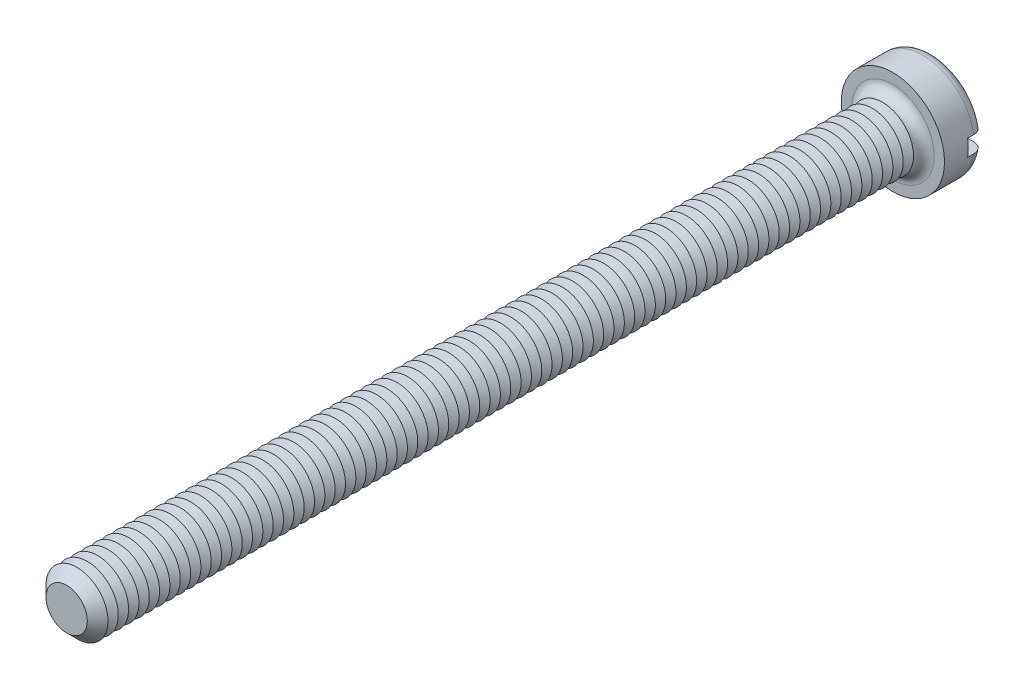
ISO-10303-21;
HEADER;
FILE_DESCRIPTION(('STEP AP214'),'2;1');
FILE_NAME('part.step','',(''),(''),'','','');
FILE_SCHEMA(('AUTOMOTIVE_DESIGN { 1 0 10303 214 1 1 1 1 }'));
ENDSEC;
DATA;
#1=APPLICATION_CONTEXT('core data for automotive mechanical design processes');
#2=APPLICATION_PROTOCOL_DEFINITION('international standard','automotive_design',2000,#1);
#3=PRODUCT_CONTEXT('',#1,'mechanical');
#4=PRODUCT('Part','Part','',(#3));
#5=PRODUCT_RELATED_PRODUCT_CATEGORY('part','',(#4));
#6=PRODUCT_DEFINITION_FORMATION('','',#4);
#7=PRODUCT_DEFINITION_CONTEXT('part definition',#1,'design');
#8=PRODUCT_DEFINITION('design','',#6,#7);
#9=PRODUCT_DEFINITION_SHAPE('','',#8);
#10=(LENGTH_UNIT() NAMED_UNIT(*) SI_UNIT(.MILLI.,.METRE.));
#11=(NAMED_UNIT(*) PLANE_ANGLE_UNIT() SI_UNIT($,.RADIAN.));
#12=(NAMED_UNIT(*) SI_UNIT($,.STERADIAN.) SOLID_ANGLE_UNIT());
#13=UNCERTAINTY_MEASURE_WITH_UNIT(LENGTH_MEASURE(1.E-05),#10,'distance_accuracy_value','');
#14=(GEOMETRIC_REPRESENTATION_CONTEXT(3) GLOBAL_UNCERTAINTY_ASSIGNED_CONTEXT((#13)) GLOBAL_UNIT_ASSIGNED_CONTEXT((#10,
#11,#12)) REPRESENTATION_CONTEXT('',''));
#15=CARTESIAN_POINT('',(0.,0.,0.));
#16=DIRECTION('',(0.,0.,1.));
#17=DIRECTION('',(1.,0.,0.));
#18=AXIS2_PLACEMENT_3D('',#15,#16,#17);
#19=CARTESIAN_POINT('',(0.,0.,-3.9));
#20=DIRECTION('',(0.,0.,1.));
#21=DIRECTION('',(1.,0.,0.));
#22=AXIS2_PLACEMENT_3D('',#19,#20,#21);
#23=PLANE('',#22);
#24=CARTESIAN_POINT('',(0.,0.,-3.9));
#25=DIRECTION('',(0.,0.,1.));
#26=DIRECTION('',(1.,0.,0.));
#27=AXIS2_PLACEMENT_3D('',#24,#25,#26);
#28=CIRCLE('',#27,4.);
#29=CARTESIAN_POINT('',(-3.91918358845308,0.800000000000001,-3.9));
#30=VERTEX_POINT('',#29);
#31=CARTESIAN_POINT('',(3.91918358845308,0.8,-3.9));
#32=VERTEX_POINT('',#31);
#33=EDGE_CURVE('E116',#30,#32,#28,.F.);
#34=ORIENTED_EDGE('',*,*,#33,.T.);
#35=DIRECTION('',(1.,0.,0.));
#36=VECTOR('',#35,1.);
#37=CARTESIAN_POINT('',(-5.,0.800000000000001,-3.9));
#38=LINE('',#37,#36);
#39=EDGE_CURVE('E111',#30,#32,#38,.T.);
#40=ORIENTED_EDGE('',*,*,#39,.F.);
#41=EDGE_LOOP('',(#34,#40));
#42=FACE_BOUND('',#41,.T.);
#43=ADVANCED_FACE('F39',(#42),#23,.F.);
#44=CARTESIAN_POINT('',(0.,0.,-2.9));
#45=DIRECTION('',(0.,0.,1.));
#46=DIRECTION('',(1.,0.,0.));
#47=AXIS2_PLACEMENT_3D('',#44,#45,#46);
#48=TOROIDAL_SURFACE('',#47,4.,1.);
#49=CARTESIAN_POINT('',(-4.76648512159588,0.800000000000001,-3.45304061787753));
#50=CARTESIAN_POINT('',(-4.73486405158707,0.800000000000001,-3.50001565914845));
#51=CARTESIAN_POINT('',(-4.69920787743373,0.800000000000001,-3.54432871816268));
#52=CARTESIAN_POINT('',(-4.62090302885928,0.800000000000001,-3.62634638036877));
#53=CARTESIAN_POINT('',(-4.57824494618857,0.800000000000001,-3.66404194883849));
#54=CARTESIAN_POINT('',(-4.48726975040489,0.800000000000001,-3.73172278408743));
#55=CARTESIAN_POINT('',(-4.43895902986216,0.800000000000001,-3.76171664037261));
#56=CARTESIAN_POINT('',(-4.33804923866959,0.800000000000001,-3.81326437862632));
#57=CARTESIAN_POINT('',(-4.2854512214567,0.800000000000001,-3.8348203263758));
#58=CARTESIAN_POINT('',(-4.17679895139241,0.800000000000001,-3.86918431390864));
#59=CARTESIAN_POINT('',(-4.12071163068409,0.800000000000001,-3.88188775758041));
#60=CARTESIAN_POINT('',(-4.00720729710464,0.800000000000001,-3.89785932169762));
#61=CARTESIAN_POINT('',(-3.94979011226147,0.800000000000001,-3.9011262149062));
#62=CARTESIAN_POINT('',(-3.83429042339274,0.800000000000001,-3.89816676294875));
#63=CARTESIAN_POINT('',(-3.77621176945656,0.800000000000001,-3.89178937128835));
#64=CARTESIAN_POINT('',(-3.66191938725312,0.800000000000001,-3.8694726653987));
#65=CARTESIAN_POINT('',(-3.60570580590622,0.800000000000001,-3.85353259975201));
#66=CARTESIAN_POINT('',(-3.49618749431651,0.800000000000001,-3.81233202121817));
#67=CARTESIAN_POINT('',(-3.44291561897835,0.800000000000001,-3.78698406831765));
#68=CARTESIAN_POINT('',(-3.34140774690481,0.800000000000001,-3.72766098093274));
#69=CARTESIAN_POINT('',(-3.29317182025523,0.800000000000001,-3.69368572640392));
#70=CARTESIAN_POINT('',(-3.20343355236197,0.800000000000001,-3.6182054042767));
#71=CARTESIAN_POINT('',(-3.16189680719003,0.800000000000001,-3.57674128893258));
#72=CARTESIAN_POINT('',(-3.08658236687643,0.800000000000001,-3.48727547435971));
#73=CARTESIAN_POINT('',(-3.05280364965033,0.800000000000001,-3.43927463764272));
#74=CARTESIAN_POINT('',(-2.99489532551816,0.800000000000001,-3.33932895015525));
#75=CARTESIAN_POINT('',(-2.97055012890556,0.800000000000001,-3.28750911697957));
#76=CARTESIAN_POINT('',(-2.93124252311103,0.800000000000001,-3.18042600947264));
#77=CARTESIAN_POINT('',(-2.91627793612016,0.800000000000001,-3.12516353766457));
#78=CARTESIAN_POINT('',(-2.89663075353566,0.800000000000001,-3.01470560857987));
#79=CARTESIAN_POINT('',(-2.89162828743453,0.800000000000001,-2.95956691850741));
#80=CARTESIAN_POINT('',(-2.89112479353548,0.800000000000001,-2.84924961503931));
#81=CARTESIAN_POINT('',(-2.89562264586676,0.800000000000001,-2.79407100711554));
#82=CARTESIAN_POINT('',(-2.91379565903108,0.800000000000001,-2.6861912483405));
#83=CARTESIAN_POINT('',(-2.92731815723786,0.800000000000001,-2.63346424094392));
#84=CARTESIAN_POINT('',(-2.96290888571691,0.800000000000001,-2.53098203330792));
#85=CARTESIAN_POINT('',(-2.98497757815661,0.800000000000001,-2.48122699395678));
#86=CARTESIAN_POINT('',(-3.03728055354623,0.800000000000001,-2.38535286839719));
#87=CARTESIAN_POINT('',(-3.06761989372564,0.800000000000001,-2.33929117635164));
#88=CARTESIAN_POINT('',(-3.13537950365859,0.800000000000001,-2.2527125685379));
#89=CARTESIAN_POINT('',(-3.17280082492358,0.800000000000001,-2.21219647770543));
#90=CARTESIAN_POINT('',(-3.2549164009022,0.800000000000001,-2.13651195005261));
#91=CARTESIAN_POINT('',(-3.29980186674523,0.800000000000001,-2.10155095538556));
#92=CARTESIAN_POINT('',(-3.39467666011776,0.800000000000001,-2.03942270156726));
#93=CARTESIAN_POINT('',(-3.44466673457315,0.800000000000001,-2.01225658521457));
#94=CARTESIAN_POINT('',(-3.5497933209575,0.800000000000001,-1.96576935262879));
#95=CARTESIAN_POINT('',(-3.60503228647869,0.800000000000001,-1.94667963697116));
#96=CARTESIAN_POINT('',(-3.71791613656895,0.800000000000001,-1.91794308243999));
#97=CARTESIAN_POINT('',(-3.77556119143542,0.800000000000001,-1.90829691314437));
#98=CARTESIAN_POINT('',(-3.89221522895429,0.800000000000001,-1.89869331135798));
#99=CARTESIAN_POINT('',(-3.9512319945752,0.800000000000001,-1.89882985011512));
#100=CARTESIAN_POINT('',(-4.06839541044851,0.800000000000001,-1.90907818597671));
#101=CARTESIAN_POINT('',(-4.12654207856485,0.800000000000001,-1.91918977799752));
#102=CARTESIAN_POINT('',(-4.23988103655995,0.800000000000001,-1.9490667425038));
#103=CARTESIAN_POINT('',(-4.29509069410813,0.800000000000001,-1.96876615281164));
#104=CARTESIAN_POINT('',(-4.40134194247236,0.800000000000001,-2.01729572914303));
#105=CARTESIAN_POINT('',(-4.45238383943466,0.800000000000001,-2.04612522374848));
#106=CARTESIAN_POINT('',(-4.54801343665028,0.800000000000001,-2.1116316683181));
#107=CARTESIAN_POINT('',(-4.59268768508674,0.800000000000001,-2.14818225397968));
#108=CARTESIAN_POINT('',(-4.67513924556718,0.800000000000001,-2.22837632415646));
#109=CARTESIAN_POINT('',(-4.71291715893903,0.800000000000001,-2.27201918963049));
#110=CARTESIAN_POINT('',(-4.77986554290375,0.800000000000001,-2.36439990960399));
#111=CARTESIAN_POINT('',(-4.80916462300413,0.800000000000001,-2.41304457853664));
#112=CARTESIAN_POINT('',(-4.85906149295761,0.800000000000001,-2.51460659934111));
#113=CARTESIAN_POINT('',(-4.8796602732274,0.800000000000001,-2.56752346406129));
#114=CARTESIAN_POINT('',(-4.9113264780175,0.800000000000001,-2.67542592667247));
#115=CARTESIAN_POINT('',(-4.92250819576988,0.800000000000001,-2.73037800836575));
#116=CARTESIAN_POINT('',(-4.93542682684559,0.800000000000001,-2.84139649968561));
#117=CARTESIAN_POINT('',(-4.93716171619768,0.800000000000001,-2.89746314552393));
#118=CARTESIAN_POINT('',(-4.93114851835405,0.800000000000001,-3.00876455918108));
#119=CARTESIAN_POINT('',(-4.92345325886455,0.800000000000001,-3.0640022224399));
#120=CARTESIAN_POINT('',(-4.8989032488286,0.800000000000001,-3.17235240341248));
#121=CARTESIAN_POINT('',(-4.88205998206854,0.800000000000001,-3.22546749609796));
#122=CARTESIAN_POINT('',(-4.84819200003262,0.800000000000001,-3.30764066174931));
#123=CARTESIAN_POINT('',(-4.83390853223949,0.800000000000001,-3.33785845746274));
#124=CARTESIAN_POINT('',(-4.80237957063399,0.800000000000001,-3.39670633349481));
#125=CARTESIAN_POINT('',(-4.78513409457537,0.800000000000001,-3.42533642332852));
#126=CARTESIAN_POINT('',(-4.76648512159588,0.800000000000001,-3.45304061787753));
#127=B_SPLINE_CURVE_WITH_KNOTS('',3,(#49,#50,#51,#52,#53,#54,#55,#56,#57,#58,#59,#60,#61,#62,
#63,#64,#65,#66,#67,#68,#69,#70,#71,#72,#73,#74,#75,#76,#77,#78,#79,#80,#81,#82,#83,#84,#85,#86,
#87,#88,#89,#90,#91,#92,#93,#94,#95,#96,#97,#98,#99,#100,#101,#102,#103,#104,#105,#106,#107,
#108,#109,#110,#111,#112,#113,#114,#115,#116,#117,#118,#119,#120,#121,#122,#123,#124,#125,#126),
.UNSPECIFIED.,.T.,.F.,(4,2,2,2,2,2,2,2,2,2,2,2,2,2,2,2,2,2,2,2,2,2,2,2,2,2,2,2,2,2,2,2,2,2,2,2,
2,2,4),(0.,0.169755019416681,0.339740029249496,0.509534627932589,0.67928763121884,
0.851013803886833,1.02276230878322,1.19722869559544,1.37170879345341,1.54785292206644,
1.72399950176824,1.89921049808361,2.07439839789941,2.24530597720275,2.41617386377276,
2.58146078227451,2.74672821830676,2.90926852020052,3.0718176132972,3.2365363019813,
3.40127946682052,3.57118676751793,3.74111896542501,3.91563534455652,4.09016409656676,
4.26636956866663,4.4425714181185,4.61757781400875,4.79257134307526,4.96489650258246,
5.13720662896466,5.30674670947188,5.47626748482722,5.64369988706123,5.81116816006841,
5.97770254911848,6.14402836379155,6.24414438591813,6.34425980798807),.UNSPECIFIED.);
#128=CARTESIAN_POINT('',(-4.93558507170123,0.800000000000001,-2.9));
#129=VERTEX_POINT('',#128);
#130=EDGE_CURVE('E803',#129,#30,#127,.T.);
#131=ORIENTED_EDGE('',*,*,#130,.F.);
#132=CARTESIAN_POINT('',(0.,0.,-2.9));
#133=DIRECTION('',(0.,0.,1.));
#134=DIRECTION('',(1.,0.,0.));
#135=AXIS2_PLACEMENT_3D('',#132,#133,#134);
#136=CIRCLE('',#135,5.);
#137=CARTESIAN_POINT('',(4.93558507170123,0.8,-2.9));
#138=VERTEX_POINT('',#137);
#139=EDGE_CURVE('E125',#138,#129,#136,.T.);
#140=ORIENTED_EDGE('',*,*,#139,.F.);
#141=CARTESIAN_POINT('',(2.98553785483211,0.8,-3.31649797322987));
#142=CARTESIAN_POINT('',(3.00991125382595,0.8,-3.36788093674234));
#143=CARTESIAN_POINT('',(3.03875556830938,0.8,-3.41719756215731));
#144=CARTESIAN_POINT('',(3.1043993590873,0.8,-3.51028676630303));
#145=CARTESIAN_POINT('',(3.1412115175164,0.8,-3.55405032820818));
#146=CARTESIAN_POINT('',(3.22153641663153,0.8,-3.63476402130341));
#147=CARTESIAN_POINT('',(3.26503706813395,0.8,-3.67172618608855));
#148=CARTESIAN_POINT('',(3.35749627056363,0.8,-3.73799476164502));
#149=CARTESIAN_POINT('',(3.4064533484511,0.8,-3.76730323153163));
#150=CARTESIAN_POINT('',(3.5095773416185,0.8,-3.81809642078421));
#151=CARTESIAN_POINT('',(3.56383317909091,0.8,-3.83940072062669));
#152=CARTESIAN_POINT('',(3.67513017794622,0.8,-3.87272481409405));
#153=CARTESIAN_POINT('',(3.7321717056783,0.8,-3.88474338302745));
#154=CARTESIAN_POINT('',(3.84815688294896,0.8,-3.89923413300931));
#155=CARTESIAN_POINT('',(3.90711516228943,0.8,-3.9015896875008));
#156=CARTESIAN_POINT('',(4.02458610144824,0.8,-3.89631753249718));
#157=CARTESIAN_POINT('',(4.08309876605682,0.8,-3.8886899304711));
#158=CARTESIAN_POINT('',(4.19768646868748,0.8,-3.86366584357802));
#159=CARTESIAN_POINT('',(4.25377243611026,0.8,-3.84631948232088));
#160=CARTESIAN_POINT('',(4.3621676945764,0.8,-3.80231797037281));
#161=CARTESIAN_POINT('',(4.41447726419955,0.8,-3.77566350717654));
#162=CARTESIAN_POINT('',(4.51300872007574,0.8,-3.71421163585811));
#163=CARTESIAN_POINT('',(4.5593085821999,0.8,-3.67953927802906));
#164=CARTESIAN_POINT('',(4.64530675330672,0.8,-3.60279495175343));
#165=CARTESIAN_POINT('',(4.68500564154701,0.8,-3.56072363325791));
#166=CARTESIAN_POINT('',(4.75599202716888,0.8,-3.47111750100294));
#167=CARTESIAN_POINT('',(4.7874061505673,0.8,-3.42368298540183));
#168=CARTESIAN_POINT('',(4.84170328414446,0.8,-3.32415927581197));
#169=CARTESIAN_POINT('',(4.86458695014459,0.8,-3.2720704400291));
#170=CARTESIAN_POINT('',(4.90088120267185,0.8,-3.16544016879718));
#171=CARTESIAN_POINT('',(4.91440984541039,0.8,-3.11093889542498));
#172=CARTESIAN_POINT('',(4.93205429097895,0.8,-3.00043391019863));
#173=CARTESIAN_POINT('',(4.93617053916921,0.8,-2.9444302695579));
#174=CARTESIAN_POINT('',(4.93486973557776,0.8,-2.83292218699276));
#175=CARTESIAN_POINT('',(4.92951827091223,0.8,-2.77741696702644));
#176=CARTESIAN_POINT('',(4.90957104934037,0.8,-2.66809456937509));
#177=CARTESIAN_POINT('',(4.89497541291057,0.8,-2.61427736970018));
#178=CARTESIAN_POINT('',(4.85697876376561,0.8,-2.50985095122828));
#179=CARTESIAN_POINT('',(4.83357805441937,0.8,-2.45924162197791));
#180=CARTESIAN_POINT('',(4.77866660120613,0.8,-2.36263484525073));
#181=CARTESIAN_POINT('',(4.74715567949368,0.8,-2.31663749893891));
#182=CARTESIAN_POINT('',(4.67670791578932,0.8,-2.23021464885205));
#183=CARTESIAN_POINT('',(4.6377224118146,0.8,-2.1898288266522));
#184=CARTESIAN_POINT('',(4.55359880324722,0.8,-2.11607828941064));
#185=CARTESIAN_POINT('',(4.50846036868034,0.8,-2.08271395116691));
#186=CARTESIAN_POINT('',(4.41271544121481,0.8,-2.02349513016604));
#187=CARTESIAN_POINT('',(4.36204749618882,0.8,-1.99774003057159));
#188=CARTESIAN_POINT('',(4.257155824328,0.8,-1.95495040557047));
#189=CARTESIAN_POINT('',(4.20293181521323,0.8,-1.93791657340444));
#190=CARTESIAN_POINT('',(4.09154156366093,0.8,-1.91276335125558));
#191=CARTESIAN_POINT('',(4.03434212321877,0.8,-1.90479098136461));
#192=CARTESIAN_POINT('',(3.91941228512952,0.8,-1.89840884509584));
#193=CARTESIAN_POINT('',(3.8616818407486,0.8,-1.89999992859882));
#194=CARTESIAN_POINT('',(3.7464111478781,0.8,-1.91275144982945));
#195=CARTESIAN_POINT('',(3.6888866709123,0.8,-1.92405471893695));
#196=CARTESIAN_POINT('',(3.57652290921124,0.8,-1.95609086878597));
#197=CARTESIAN_POINT('',(3.52168382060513,0.8,-1.97682443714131));
#198=CARTESIAN_POINT('',(3.41589179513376,0.8,-2.02733294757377));
#199=CARTESIAN_POINT('',(3.36496676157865,0.8,-2.05716640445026));
#200=CARTESIAN_POINT('',(3.26890903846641,0.8,-2.12504079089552));
#201=CARTESIAN_POINT('',(3.22377627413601,0.8,-2.16308161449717));
#202=CARTESIAN_POINT('',(3.141135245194,0.8,-2.24593284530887));
#203=CARTESIAN_POINT('',(3.1035541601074,0.8,-2.29067053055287));
#204=CARTESIAN_POINT('',(3.03669700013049,0.8,-2.38597317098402));
#205=CARTESIAN_POINT('',(3.00741914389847,0.8,-2.43653687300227));
#206=CARTESIAN_POINT('',(2.95891799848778,0.8,-2.54052959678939));
#207=CARTESIAN_POINT('',(2.93943249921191,0.8,-2.59383627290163));
#208=CARTESIAN_POINT('',(2.9100081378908,0.8,-2.70303736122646));
#209=CARTESIAN_POINT('',(2.90006970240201,0.8,-2.75893188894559));
#210=CARTESIAN_POINT('',(2.89027863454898,0.8,-2.86986958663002));
#211=CARTESIAN_POINT('',(2.89012791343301,0.8,-2.92488680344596));
#212=CARTESIAN_POINT('',(2.89917145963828,0.8,-3.03409648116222));
#213=CARTESIAN_POINT('',(2.90835313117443,0.8,-3.08828995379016));
#214=CARTESIAN_POINT('',(2.92977618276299,0.8,-3.17141652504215));
#215=CARTESIAN_POINT('',(2.93899011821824,0.8,-3.20116372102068));
#216=CARTESIAN_POINT('',(2.96020249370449,0.8,-3.25964614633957));
#217=CARTESIAN_POINT('',(2.97220082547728,0.8,-3.28838141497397));
#218=CARTESIAN_POINT('',(2.98553785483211,0.8,-3.31649797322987));
#219=B_SPLINE_CURVE_WITH_KNOTS('',3,(#141,#142,#143,#144,#145,#146,#147,#148,#149,#150,#151,
#152,#153,#154,#155,#156,#157,#158,#159,#160,#161,#162,#163,#164,#165,#166,#167,#168,#169,#170,
#171,#172,#173,#174,#175,#176,#177,#178,#179,#180,#181,#182,#183,#184,#185,#186,#187,#188,#189,
#190,#191,#192,#193,#194,#195,#196,#197,#198,#199,#200,#201,#202,#203,#204,#205,#206,#207,#208,
#209,#210,#211,#212,#213,#214,#215,#216,#217,#218),.UNSPECIFIED.,.T.,.F.,(4,2,2,2,2,2,2,2,2,2,2,
2,2,2,2,2,2,2,2,2,2,2,2,2,2,2,2,2,2,2,2,2,2,2,2,2,2,2,4),(0.,0.170493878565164,
0.341261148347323,0.511723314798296,0.682139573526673,0.856194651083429,1.03027268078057,
1.20644565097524,1.38261672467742,1.55788746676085,1.73314526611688,1.90583484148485,
2.07850925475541,2.24836742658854,2.41821253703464,2.58587311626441,2.75352576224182,
2.92002154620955,3.08651516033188,3.25300303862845,3.41949456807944,3.58710926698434,
3.75473295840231,3.92445790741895,4.09419634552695,4.26665110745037,4.43912119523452,
4.61417197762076,4.78923552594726,4.96544940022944,5.1416609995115,5.31608191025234,
5.49046537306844,5.65989063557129,5.82932346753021,5.99359365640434,6.157642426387,
6.250939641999,6.34423323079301),.UNSPECIFIED.);
#220=EDGE_CURVE('E805',#32,#138,#219,.T.);
#221=ORIENTED_EDGE('',*,*,#220,.F.);
#222=ORIENTED_EDGE('',*,*,#33,.F.);
#223=EDGE_LOOP('',(#131,#140,#221,#222));
#224=FACE_BOUND('',#223,.T.);
#225=ADVANCED_FACE('F787',(#224),#48,.T.);
#226=CARTESIAN_POINT('',(0.,0.,-3.9));
#227=DIRECTION('',(0.,0.,1.));
#228=DIRECTION('',(1.,0.,0.));
#229=AXIS2_PLACEMENT_3D('',#226,#227,#228);
#230=CYLINDRICAL_SURFACE('',#229,5.);
#231=DIRECTION('',(0.,0.,1.));
#232=VECTOR('',#231,1.);
#233=CARTESIAN_POINT('',(4.93558507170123,0.8,-3.9));
#234=LINE('',#233,#232);
#235=CARTESIAN_POINT('',(4.93558507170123,0.8,-2.3));
#236=VERTEX_POINT('',#235);
#237=EDGE_CURVE('E818',#138,#236,#234,.T.);
#238=ORIENTED_EDGE('',*,*,#237,.F.);
#239=ORIENTED_EDGE('',*,*,#139,.T.);
#240=DIRECTION('',(0.,0.,1.));
#241=VECTOR('',#240,1.);
#242=CARTESIAN_POINT('',(-4.93558507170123,0.800000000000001,-3.9));
#243=LINE('',#242,#241);
#244=CARTESIAN_POINT('',(-4.93558507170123,0.800000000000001,-2.3));
#245=VERTEX_POINT('',#244);
#246=EDGE_CURVE('E63',#245,#129,#243,.F.);
#247=ORIENTED_EDGE('',*,*,#246,.F.);
#248=CARTESIAN_POINT('',(0.,0.,-2.3));
#249=DIRECTION('',(0.,0.,-1.));
#250=DIRECTION('',(-1.,0.,0.));
#251=AXIS2_PLACEMENT_3D('',#248,#249,#250);
#252=CIRCLE('',#251,5.);
#253=CARTESIAN_POINT('',(-4.93558507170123,-0.799999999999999,-2.3));
#254=VERTEX_POINT('',#253);
#255=EDGE_CURVE('E43',#245,#254,#252,.F.);
#256=ORIENTED_EDGE('',*,*,#255,.T.);
#257=DIRECTION('',(0.,0.,1.));
#258=VECTOR('',#257,1.);
#259=CARTESIAN_POINT('',(-4.93558507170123,-0.799999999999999,-3.9));
#260=LINE('',#259,#258);
#261=CARTESIAN_POINT('',(-4.93558507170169,-0.799999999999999,-2.89999999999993));
#262=VERTEX_POINT('',#261);
#263=EDGE_CURVE('E816',#262,#254,#260,.T.);
#264=ORIENTED_EDGE('',*,*,#263,.F.);
#265=CARTESIAN_POINT('',(4.93558507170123,-0.8,-2.9));
#266=VERTEX_POINT('',#265);
#267=EDGE_CURVE('E127',#262,#266,#136,.T.);
#268=ORIENTED_EDGE('',*,*,#267,.T.);
#269=DIRECTION('',(0.,0.,1.));
#270=VECTOR('',#269,1.);
#271=CARTESIAN_POINT('',(4.93558507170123,-0.8,-3.9));
#272=LINE('',#271,#270);
#273=CARTESIAN_POINT('',(4.93558507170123,-0.8,-2.3));
#274=VERTEX_POINT('',#273);
#275=EDGE_CURVE('E55',#274,#266,#272,.F.);
#276=ORIENTED_EDGE('',*,*,#275,.F.);
#277=EDGE_CURVE('E11',#274,#236,#252,.F.);
#278=ORIENTED_EDGE('',*,*,#277,.T.);
#279=EDGE_LOOP('',(#238,#239,#247,#256,#264,#268,#276,#278));
#280=FACE_BOUND('',#279,.T.);
#281=CARTESIAN_POINT('',(0.,0.,0.));
#282=DIRECTION('',(0.,0.,1.));
#283=DIRECTION('',(1.,0.,0.));
#284=AXIS2_PLACEMENT_3D('',#281,#282,#283);
#285=CIRCLE('',#284,5.);
#286=CARTESIAN_POINT('',(5.,0.,0.));
#287=VERTEX_POINT('',#286);
#288=EDGE_CURVE('E821',#287,#287,#285,.T.);
#289=ORIENTED_EDGE('',*,*,#288,.F.);
#290=EDGE_LOOP('',(#289));
#291=FACE_BOUND('',#290,.T.);
#292=ADVANCED_FACE('F783',(#280,#291),#230,.T.);
#293=CARTESIAN_POINT('',(3.91918358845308,-0.8,-3.9));
#294=VERTEX_POINT('',#293);
#295=CARTESIAN_POINT('',(-3.91918358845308,-0.799999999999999,-3.9));
#296=VERTEX_POINT('',#295);
#297=EDGE_CURVE('E109',#294,#296,#28,.F.);
#298=ORIENTED_EDGE('',*,*,#297,.T.);
#299=DIRECTION('',(-1.,0.,0.));
#300=VECTOR('',#299,1.);
#301=CARTESIAN_POINT('',(-5.,-0.799999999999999,-3.9));
#302=LINE('',#301,#300);
#303=EDGE_CURVE('E96',#294,#296,#302,.T.);
#304=ORIENTED_EDGE('',*,*,#303,.F.);
#305=EDGE_LOOP('',(#298,#304));
#306=FACE_BOUND('',#305,.T.);
#307=ADVANCED_FACE('F108',(#306),#23,.F.);
#308=CARTESIAN_POINT('',(0.,0.,0.));
#309=DIRECTION('',(0.,0.,1.));
#310=DIRECTION('',(1.,0.,0.));
#311=AXIS2_PLACEMENT_3D('',#308,#309,#310);
#312=PLANE('',#311);
#313=CARTESIAN_POINT('',(0.,0.,0.));
#314=DIRECTION('',(0.,0.,1.));
#315=DIRECTION('',(1.,0.,0.));
#316=AXIS2_PLACEMENT_3D('',#313,#314,#315);
#317=CIRCLE('',#316,4.);
#318=CARTESIAN_POINT('',(4.,0.,0.));
#319=VERTEX_POINT('',#318);
#320=EDGE_CURVE('E115',#319,#319,#317,.F.);
#321=ORIENTED_EDGE('',*,*,#320,.T.);
#322=EDGE_LOOP('',(#321));
#323=FACE_BOUND('',#322,.T.);
#324=ORIENTED_EDGE('',*,*,#288,.T.);
#325=EDGE_LOOP('',(#324));
#326=FACE_BOUND('',#325,.T.);
#327=ADVANCED_FACE('F782',(#323,#326),#312,.T.);
#328=CARTESIAN_POINT('',(-4.76648512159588,-0.799999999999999,-3.45304061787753));
#329=CARTESIAN_POINT('',(-4.7975694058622,-0.799999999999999,-3.40685392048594));
#330=CARTESIAN_POINT('',(-4.82479903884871,-0.799999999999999,-3.35802740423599));
#331=CARTESIAN_POINT('',(-4.87070632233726,-0.799999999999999,-3.25646127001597));
#332=CARTESIAN_POINT('',(-4.8893747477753,-0.799999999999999,-3.20371750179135));
#333=CARTESIAN_POINT('',(-4.91756720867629,-0.799999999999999,-3.09584501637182));
#334=CARTESIAN_POINT('',(-4.92709302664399,-0.799999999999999,-3.04071676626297));
#335=CARTESIAN_POINT('',(-4.93671217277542,-0.799999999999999,-2.92965669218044));
#336=CARTESIAN_POINT('',(-4.93680767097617,-0.799999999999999,-2.87372505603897));
#337=CARTESIAN_POINT('',(-4.92758675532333,-0.799999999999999,-2.76284675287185));
#338=CARTESIAN_POINT('',(-4.91830421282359,-0.799999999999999,-2.70789726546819));
#339=CARTESIAN_POINT('',(-4.89065741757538,-0.799999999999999,-2.60033228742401));
#340=CARTESIAN_POINT('',(-4.87229291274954,-0.799999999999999,-2.54771686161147));
#341=CARTESIAN_POINT('',(-4.82699855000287,-0.799999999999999,-2.44622441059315));
#342=CARTESIAN_POINT('',(-4.80005659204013,-0.799999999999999,-2.39735278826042));
#343=CARTESIAN_POINT('',(-4.73841244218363,-0.799999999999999,-2.30477947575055));
#344=CARTESIAN_POINT('',(-4.70371003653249,-0.799999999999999,-2.26107792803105));
#345=CARTESIAN_POINT('',(-4.62724516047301,-0.799999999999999,-2.17969334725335));
#346=CARTESIAN_POINT('',(-4.58542787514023,-0.799999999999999,-2.14206183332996));
#347=CARTESIAN_POINT('',(-4.49614171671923,-0.799999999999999,-2.07424284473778));
#348=CARTESIAN_POINT('',(-4.44867251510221,-0.799999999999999,-2.04405580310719));
#349=CARTESIAN_POINT('',(-4.34875035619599,-0.799999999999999,-1.99153688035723));
#350=CARTESIAN_POINT('',(-4.29623870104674,-0.799999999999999,-1.96931670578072));
#351=CARTESIAN_POINT('',(-4.18826905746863,-0.799999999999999,-1.93384994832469));
#352=CARTESIAN_POINT('',(-4.1328108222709,-0.799999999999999,-1.92060411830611));
#353=CARTESIAN_POINT('',(-4.01956054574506,-0.799999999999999,-1.90323798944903));
#354=CARTESIAN_POINT('',(-3.96174522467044,-0.799999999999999,-1.89926947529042));
#355=CARTESIAN_POINT('',(-3.84625419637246,-0.799999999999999,-1.90095183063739));
#356=CARTESIAN_POINT('',(-3.78857850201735,-0.799999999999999,-1.90660355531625));
#357=CARTESIAN_POINT('',(-3.67415602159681,-0.799999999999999,-1.92748272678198));
#358=CARTESIAN_POINT('',(-3.61743328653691,-0.799999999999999,-1.94284216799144));
#359=CARTESIAN_POINT('',(-3.50734962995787,-0.799999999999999,-1.9828275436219));
#360=CARTESIAN_POINT('',(-3.4539889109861,-0.799999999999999,-2.00745403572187));
#361=CARTESIAN_POINT('',(-3.35197118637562,-0.799999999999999,-2.06542964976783));
#362=CARTESIAN_POINT('',(-3.30333217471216,-0.799999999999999,-2.0988104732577));
#363=CARTESIAN_POINT('',(-3.21244692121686,-0.799999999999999,-2.17337326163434));
#364=CARTESIAN_POINT('',(-3.17020039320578,-0.799999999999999,-2.21455487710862));
#365=CARTESIAN_POINT('',(-3.0940098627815,-0.799999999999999,-2.30296695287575));
#366=CARTESIAN_POINT('',(-3.05995540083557,-0.799999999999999,-2.35010211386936));
#367=CARTESIAN_POINT('',(-3.00053815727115,-0.799999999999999,-2.4495670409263));
#368=CARTESIAN_POINT('',(-2.97517362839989,-0.799999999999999,-2.50189576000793));
#369=CARTESIAN_POINT('',(-2.93470320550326,-0.799999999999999,-2.60853979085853));
#370=CARTESIAN_POINT('',(-2.91930557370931,-0.799999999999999,-2.66274437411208));
#371=CARTESIAN_POINT('',(-2.89812734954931,-0.799999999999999,-2.77299836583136));
#372=CARTESIAN_POINT('',(-2.89234481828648,-0.799999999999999,-2.82904740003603));
#373=CARTESIAN_POINT('',(-2.89064073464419,-0.799999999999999,-2.93970612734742));
#374=CARTESIAN_POINT('',(-2.89444549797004,-0.799999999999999,-2.99431180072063));
#375=CARTESIAN_POINT('',(-2.9112006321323,-0.799999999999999,-3.10209766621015));
#376=CARTESIAN_POINT('',(-2.9241507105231,-0.799999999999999,-3.1552779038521));
#377=CARTESIAN_POINT('',(-2.95868580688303,-0.799999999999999,-3.25858631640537));
#378=CARTESIAN_POINT('',(-2.98024709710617,-0.799999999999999,-3.30872244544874));
#379=CARTESIAN_POINT('',(-3.03128544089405,-0.799999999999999,-3.40478519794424));
#380=CARTESIAN_POINT('',(-3.06076335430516,-0.799999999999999,-3.45071136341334));
#381=CARTESIAN_POINT('',(-3.12753448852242,-0.799999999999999,-3.53826932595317));
#382=CARTESIAN_POINT('',(-3.16500083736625,-0.799999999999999,-3.57976901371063));
#383=CARTESIAN_POINT('',(-3.24617503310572,-0.799999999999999,-3.65613204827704));
#384=CARTESIAN_POINT('',(-3.28988388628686,-0.799999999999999,-3.69099432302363));
#385=CARTESIAN_POINT('',(-3.38380639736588,-0.799999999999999,-3.75424083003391));
#386=CARTESIAN_POINT('',(-3.43418287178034,-0.799999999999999,-3.78238342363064));
#387=CARTESIAN_POINT('',(-3.53887888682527,-0.799999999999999,-3.83000231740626));
#388=CARTESIAN_POINT('',(-3.59319889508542,-0.799999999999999,-3.84947758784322));
#389=CARTESIAN_POINT('',(-3.70539237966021,-0.799999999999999,-3.87954336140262));
#390=CARTESIAN_POINT('',(-3.76331464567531,-0.799999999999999,-3.88995217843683));
#391=CARTESIAN_POINT('',(-3.88008461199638,-0.799999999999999,-3.9009132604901));
#392=CARTESIAN_POINT('',(-3.93893230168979,-0.799999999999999,-3.9014656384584));
#393=CARTESIAN_POINT('',(-4.05594892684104,-0.799999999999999,-3.89264187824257));
#394=CARTESIAN_POINT('',(-4.11411702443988,-0.799999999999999,-3.88325457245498));
#395=CARTESIAN_POINT('',(-4.22802928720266,-0.799999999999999,-3.85472582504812));
#396=CARTESIAN_POINT('',(-4.28377297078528,-0.799999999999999,-3.83558245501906));
#397=CARTESIAN_POINT('',(-4.39054463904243,-0.799999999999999,-3.78829842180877));
#398=CARTESIAN_POINT('',(-4.44161887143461,-0.799999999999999,-3.76026208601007));
#399=CARTESIAN_POINT('',(-4.53818016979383,-0.799999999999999,-3.69589278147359));
#400=CARTESIAN_POINT('',(-4.58367442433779,-0.799999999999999,-3.65957066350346));
#401=CARTESIAN_POINT('',(-4.65208830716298,-0.799999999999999,-3.59453310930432));
#402=CARTESIAN_POINT('',(-4.67711825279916,-0.799999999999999,-3.56800018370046));
#403=CARTESIAN_POINT('',(-4.72414423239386,-0.799999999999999,-3.51236863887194));
#404=CARTESIAN_POINT('',(-4.74614029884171,-0.799999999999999,-3.48327004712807));
#405=CARTESIAN_POINT('',(-4.76648512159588,-0.799999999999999,-3.45304061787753));
#406=B_SPLINE_CURVE_WITH_KNOTS('',3,(#328,#329,#330,#331,#332,#333,#334,#335,#336,#337,#338,
#339,#340,#341,#342,#343,#344,#345,#346,#347,#348,#349,#350,#351,#352,#353,#354,#355,#356,#357,
#358,#359,#360,#361,#362,#363,#364,#365,#366,#367,#368,#369,#370,#371,#372,#373,#374,#375,#376,
#377,#378,#379,#380,#381,#382,#383,#384,#385,#386,#387,#388,#389,#390,#391,#392,#393,#394,#395,
#396,#397,#398,#399,#400,#401,#402,#403,#404,#405),.UNSPECIFIED.,.T.,.F.,(4,2,2,2,2,2,2,2,2,2,2,
2,2,2,2,2,2,2,2,2,2,2,2,2,2,2,2,2,2,2,2,2,2,2,2,2,2,2,4),(0.,0.166886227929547,
0.333951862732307,0.500984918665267,0.667979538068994,0.834373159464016,1.00077139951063,
1.16740542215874,1.33404403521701,1.50202999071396,1.67002571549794,1.84029248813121,
2.01057354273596,2.18362161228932,2.35668506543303,2.53215380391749,2.70763310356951,
2.88375684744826,3.05987270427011,3.23346085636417,3.40701408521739,3.57522519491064,
3.74340238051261,3.90683338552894,4.0702591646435,4.23323770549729,4.39623395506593,
4.56320691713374,4.7302068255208,4.90252468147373,5.07486300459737,5.25058028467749,
5.42629555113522,5.60220844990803,5.77815613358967,5.95211162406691,6.12584060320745,
6.23506966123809,6.34429754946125),.UNSPECIFIED.);
#407=EDGE_CURVE('E103',#296,#262,#406,.T.);
#408=ORIENTED_EDGE('',*,*,#407,.F.);
#409=ORIENTED_EDGE('',*,*,#297,.F.);
#410=CARTESIAN_POINT('',(2.98553785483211,-0.8,-3.31649797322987));
#411=CARTESIAN_POINT('',(2.96216773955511,-0.8,-3.26721849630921));
#412=CARTESIAN_POINT('',(2.94287503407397,-0.8,-3.21596872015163));
#413=CARTESIAN_POINT('',(2.91313258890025,-0.8,-3.11092723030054));
#414=CARTESIAN_POINT('',(2.9026902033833,-0.8,-3.0571334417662));
#415=CARTESIAN_POINT('',(2.89104377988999,-0.8,-2.94853922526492));
#416=CARTESIAN_POINT('',(2.88984130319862,-0.8,-2.89373862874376));
#417=CARTESIAN_POINT('',(2.89672585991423,-0.8,-2.78473646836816));
#418=CARTESIAN_POINT('',(2.90481120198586,-0.8,-2.73053479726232));
#419=CARTESIAN_POINT('',(2.92989134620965,-0.8,-2.62460092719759));
#420=CARTESIAN_POINT('',(2.94682969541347,-0.8,-2.57285532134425));
#421=CARTESIAN_POINT('',(2.9889990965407,-0.8,-2.47286425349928));
#422=CARTESIAN_POINT('',(3.01423103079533,-0.8,-2.42461916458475));
#423=CARTESIAN_POINT('',(3.07271536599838,-0.8,-2.33201565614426));
#424=CARTESIAN_POINT('',(3.10610710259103,-0.8,-2.28774532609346));
#425=CARTESIAN_POINT('',(3.17963417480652,-0.8,-2.205215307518));
#426=CARTESIAN_POINT('',(3.21977054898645,-0.8,-2.16695654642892));
#427=CARTESIAN_POINT('',(3.3070361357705,-0.8,-2.09624274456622));
#428=CARTESIAN_POINT('',(3.35434874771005,-0.8,-2.06401396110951));
#429=CARTESIAN_POINT('',(3.45361131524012,-0.8,-2.00773436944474));
#430=CARTESIAN_POINT('',(3.50556189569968,-0.8,-1.98368466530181));
#431=CARTESIAN_POINT('',(3.61398433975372,-0.8,-1.94389460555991));
#432=CARTESIAN_POINT('',(3.67053506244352,-0.8,-1.92836880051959));
#433=CARTESIAN_POINT('',(3.78543606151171,-0.8,-1.90696594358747));
#434=CARTESIAN_POINT('',(3.84378643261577,-0.8,-1.90108940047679));
#435=CARTESIAN_POINT('',(3.96100201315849,-0.8,-1.89918115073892));
#436=CARTESIAN_POINT('',(4.01986821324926,-0.8,-1.90320860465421));
#437=CARTESIAN_POINT('',(4.13606891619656,-0.8,-1.9211820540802));
#438=CARTESIAN_POINT('',(4.19340347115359,-0.8,-1.93512771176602));
#439=CARTESIAN_POINT('',(4.30434213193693,-0.8,-1.97243705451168));
#440=CARTESIAN_POINT('',(4.35797549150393,-0.8,-1.99571368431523));
#441=CARTESIAN_POINT('',(4.46048254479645,-0.8,-2.0510826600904));
#442=CARTESIAN_POINT('',(4.50935662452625,-0.8,-2.08317429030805));
#443=CARTESIAN_POINT('',(4.60012348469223,-0.8,-2.15471647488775));
#444=CARTESIAN_POINT('',(4.64211506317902,-0.8,-2.19404167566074));
#445=CARTESIAN_POINT('',(4.71877054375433,-0.8,-2.27928299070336));
#446=CARTESIAN_POINT('',(4.75343508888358,-0.8,-2.32519852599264));
#447=CARTESIAN_POINT('',(4.81388799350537,-0.8,-2.4215411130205));
#448=CARTESIAN_POINT('',(4.83980652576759,-0.8,-2.47188650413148));
#449=CARTESIAN_POINT('',(4.88271402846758,-0.8,-2.57624865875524));
#450=CARTESIAN_POINT('',(4.89970360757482,-0.8,-2.63026517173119));
#451=CARTESIAN_POINT('',(4.92409334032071,-0.8,-2.73978844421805));
#452=CARTESIAN_POINT('',(4.93159814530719,-0.8,-2.79527191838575));
#453=CARTESIAN_POINT('',(4.93713723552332,-0.8,-2.90670881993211));
#454=CARTESIAN_POINT('',(4.9351718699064,-0.8,-2.9626622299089));
#455=CARTESIAN_POINT('',(4.92186293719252,-0.8,-3.07317093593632));
#456=CARTESIAN_POINT('',(4.91056393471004,-0.8,-3.12773160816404));
#457=CARTESIAN_POINT('',(4.87898532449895,-0.8,-3.234187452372));
#458=CARTESIAN_POINT('',(4.85870572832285,-0.8,-3.28608262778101));
#459=CARTESIAN_POINT('',(4.80971634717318,-0.8,-3.38586723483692));
#460=CARTESIAN_POINT('',(4.78098824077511,-0.8,-3.43374766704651));
#461=CARTESIAN_POINT('',(4.71596686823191,-0.8,-3.52405937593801));
#462=CARTESIAN_POINT('',(4.67967336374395,-0.8,-3.56649048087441));
#463=CARTESIAN_POINT('',(4.60022577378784,-0.8,-3.64511036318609));
#464=CARTESIAN_POINT('',(4.5570143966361,-0.8,-3.6812412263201));
#465=CARTESIAN_POINT('',(4.4652099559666,-0.8,-3.7458530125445));
#466=CARTESIAN_POINT('',(4.41661654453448,-0.8,-3.77433344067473));
#467=CARTESIAN_POINT('',(4.31470683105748,-0.8,-3.82326981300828));
#468=CARTESIAN_POINT('',(4.26133399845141,-0.8,-3.84360800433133));
#469=CARTESIAN_POINT('',(4.15196444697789,-0.8,-3.87519515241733));
#470=CARTESIAN_POINT('',(4.09596750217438,-0.8,-3.88644332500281));
#471=CARTESIAN_POINT('',(3.98196469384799,-0.8,-3.89971870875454));
#472=CARTESIAN_POINT('',(3.92394096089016,-0.8,-3.901592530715));
#473=CARTESIAN_POINT('',(3.8083852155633,-0.8,-3.89570840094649));
#474=CARTESIAN_POINT('',(3.75085322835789,-0.8,-3.88794995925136));
#475=CARTESIAN_POINT('',(3.6371167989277,-0.8,-3.86287824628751));
#476=CARTESIAN_POINT('',(3.58093962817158,-0.8,-3.84544111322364));
#477=CARTESIAN_POINT('',(3.47227948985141,-0.8,-3.80139971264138));
#478=CARTESIAN_POINT('',(3.41979762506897,-0.8,-3.77479272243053));
#479=CARTESIAN_POINT('',(3.31994061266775,-0.8,-3.71304199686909));
#480=CARTESIAN_POINT('',(3.27257854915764,-0.8,-3.67787710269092));
#481=CARTESIAN_POINT('',(3.18459619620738,-0.8,-3.59999704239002));
#482=CARTESIAN_POINT('',(3.14396747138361,-0.8,-3.55729146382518));
#483=CARTESIAN_POINT('',(3.08341110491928,-0.8,-3.48140072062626));
#484=CARTESIAN_POINT('',(3.06118126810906,-0.8,-3.45002448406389));
#485=CARTESIAN_POINT('',(3.02047302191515,-0.8,-3.38492378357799));
#486=CARTESIAN_POINT('',(3.00199451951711,-0.8,-3.35119937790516));
#487=CARTESIAN_POINT('',(2.98553785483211,-0.8,-3.31649797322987));
#488=B_SPLINE_CURVE_WITH_KNOTS('',3,(#410,#411,#412,#413,#414,#415,#416,#417,#418,#419,#420,
#421,#422,#423,#424,#425,#426,#427,#428,#429,#430,#431,#432,#433,#434,#435,#436,#437,#438,#439,
#440,#441,#442,#443,#444,#445,#446,#447,#448,#449,#450,#451,#452,#453,#454,#455,#456,#457,#458,
#459,#460,#461,#462,#463,#464,#465,#466,#467,#468,#469,#470,#471,#472,#473,#474,#475,#476,#477,
#478,#479,#480,#481,#482,#483,#484,#485,#486,#487),.UNSPECIFIED.,.T.,.F.,(4,2,2,2,2,2,2,2,2,2,2,
2,2,2,2,2,2,2,2,2,2,2,2,2,2,2,2,2,2,2,2,2,2,2,2,2,2,2,4),(0.,0.163484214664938,
0.327104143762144,0.490751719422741,0.654369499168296,0.816956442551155,0.979560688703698,
1.14516376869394,1.31079237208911,1.48174839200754,1.6527274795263,1.82783306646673,
2.00294788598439,2.17911127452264,2.35526866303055,2.52981944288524,2.70435605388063,
2.87611266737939,3.04785420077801,3.21691347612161,3.38596122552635,3.55312700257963,
3.72028661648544,3.88665268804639,4.053018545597,4.2197478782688,4.38648246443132,
4.55467705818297,4.72288253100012,4.89343959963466,5.06401138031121,5.23736524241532,
5.41072792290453,5.58636211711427,5.76204850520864,5.93817375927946,6.11407667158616,
6.22920111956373,6.34432271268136),.UNSPECIFIED.);
#489=EDGE_CURVE('E92',#266,#294,#488,.T.);
#490=ORIENTED_EDGE('',*,*,#489,.F.);
#491=ORIENTED_EDGE('',*,*,#267,.F.);
#492=EDGE_LOOP('',(#408,#409,#490,#491));
#493=FACE_BOUND('',#492,.T.);
#494=ADVANCED_FACE('F113',(#493),#48,.T.);
#495=CARTESIAN_POINT('',(0.,0.,1.));
#496=DIRECTION('',(0.,0.,1.));
#497=DIRECTION('',(1.,0.,0.));
#498=AXIS2_PLACEMENT_3D('',#495,#496,#497);
#499=TOROIDAL_SURFACE('',#498,4.,1.);
#500=ORIENTED_EDGE('',*,*,#320,.F.);
#501=EDGE_LOOP('',(#500));
#502=FACE_BOUND('',#501,.T.);
#503=CARTESIAN_POINT('',(0.,0.,1.));
#504=DIRECTION('',(0.,0.,-1.));
#505=DIRECTION('',(-1.,0.,0.));
#506=AXIS2_PLACEMENT_3D('',#503,#504,#505);
#507=CIRCLE('',#506,3.);
#508=CARTESIAN_POINT('',(-3.,0.,1.));
#509=VERTEX_POINT('',#508);
#510=EDGE_CURVE('E827',#509,#509,#507,.T.);
#511=ORIENTED_EDGE('',*,*,#510,.T.);
#512=EDGE_LOOP('',(#511));
#513=FACE_BOUND('',#512,.T.);
#514=ADVANCED_FACE('F775',(#502,#513),#499,.F.);
#515=CARTESIAN_POINT('',(0.,0.,1.5));
#516=DIRECTION('',(0.,0.,-1.));
#517=DIRECTION('',(-1.,0.,0.));
#518=AXIS2_PLACEMENT_3D('',#515,#516,#517);
#519=CONICAL_SURFACE('',#518,2.13397459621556,1.0471975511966);
#520=ORIENTED_EDGE('',*,*,#510,.F.);
#521=EDGE_LOOP('',(#520));
#522=FACE_BOUND('',#521,.T.);
#523=CARTESIAN_POINT('',(0.,0.,1.5));
#524=DIRECTION('',(0.,0.,-1.));
#525=DIRECTION('',(-1.,0.,0.));
#526=AXIS2_PLACEMENT_3D('',#523,#524,#525);
#527=CIRCLE('',#526,2.13397459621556);
#528=CARTESIAN_POINT('',(-2.13397459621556,0.,1.5));
#529=VERTEX_POINT('',#528);
#530=EDGE_CURVE('E834',#529,#529,#527,.T.);
#531=ORIENTED_EDGE('',*,*,#530,.T.);
#532=EDGE_LOOP('',(#531));
#533=FACE_BOUND('',#532,.T.);
#534=ADVANCED_FACE('F771',(#522,#533),#519,.T.);
#535=CARTESIAN_POINT('',(0.,0.,2.));
#536=DIRECTION('',(0.,0.,1.));
#537=DIRECTION('',(1.,0.,0.));
#538=AXIS2_PLACEMENT_3D('',#535,#536,#537);
#539=CONICAL_SURFACE('',#538,3.,1.0471975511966);
#540=ORIENTED_EDGE('',*,*,#530,.F.);
#541=EDGE_LOOP('',(#540));
#542=FACE_BOUND('',#541,.T.);
#543=CARTESIAN_POINT('',(0.,0.,2.));
#544=DIRECTION('',(0.,0.,-1.));
#545=DIRECTION('',(-1.,0.,0.));
#546=AXIS2_PLACEMENT_3D('',#543,#544,#545);
#547=CIRCLE('',#546,3.);
#548=CARTESIAN_POINT('',(-3.,0.,2.));
#549=VERTEX_POINT('',#548);
#550=EDGE_CURVE('E840',#549,#549,#547,.T.);
#551=ORIENTED_EDGE('',*,*,#550,.T.);
#552=EDGE_LOOP('',(#551));
#553=FACE_BOUND('',#552,.T.);
#554=ADVANCED_FACE('F767',(#542,#553),#539,.T.);
#555=CARTESIAN_POINT('',(0.,0.,2.5));
#556=DIRECTION('',(0.,0.,-1.));
#557=DIRECTION('',(-1.,0.,0.));
#558=AXIS2_PLACEMENT_3D('',#555,#556,#557);
#559=CONICAL_SURFACE('',#558,2.13397459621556,1.0471975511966);
#560=ORIENTED_EDGE('',*,*,#550,.F.);
#561=EDGE_LOOP('',(#560));
#562=FACE_BOUND('',#561,.T.);
#563=CARTESIAN_POINT('',(0.,0.,2.5));
#564=DIRECTION('',(0.,0.,-1.));
#565=DIRECTION('',(-1.,0.,0.));
#566=AXIS2_PLACEMENT_3D('',#563,#564,#565);
#567=CIRCLE('',#566,2.13397459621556);
#568=CARTESIAN_POINT('',(-2.13397459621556,0.,2.5));
#569=VERTEX_POINT('',#568);
#570=EDGE_CURVE('E843',#569,#569,#567,.T.);
#571=ORIENTED_EDGE('',*,*,#570,.T.);
#572=EDGE_LOOP('',(#571));
#573=FACE_BOUND('',#572,.T.);
#574=ADVANCED_FACE('F763',(#562,#573),#559,.T.);
#575=CARTESIAN_POINT('',(0.,0.,3.));
#576=DIRECTION('',(0.,0.,1.));
#577=DIRECTION('',(1.,0.,0.));
#578=AXIS2_PLACEMENT_3D('',#575,#576,#577);
#579=CONICAL_SURFACE('',#578,3.,1.0471975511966);
#580=ORIENTED_EDGE('',*,*,#570,.F.);
#581=EDGE_LOOP('',(#580));
#582=FACE_BOUND('',#581,.T.);
#583=CARTESIAN_POINT('',(0.,0.,3.));
#584=DIRECTION('',(0.,0.,-1.));
#585=DIRECTION('',(-1.,0.,0.));
#586=AXIS2_PLACEMENT_3D('',#583,#584,#585);
#587=CIRCLE('',#586,3.);
#588=CARTESIAN_POINT('',(-3.,0.,3.));
#589=VERTEX_POINT('',#588);
#590=EDGE_CURVE('E847',#589,#589,#587,.T.);
#591=ORIENTED_EDGE('',*,*,#590,.T.);
#592=EDGE_LOOP('',(#591));
#593=FACE_BOUND('',#592,.T.);
#594=ADVANCED_FACE('F759',(#582,#593),#579,.T.);
#595=CARTESIAN_POINT('',(0.,0.,3.5));
#596=DIRECTION('',(0.,0.,-1.));
#597=DIRECTION('',(-1.,0.,0.));
#598=AXIS2_PLACEMENT_3D('',#595,#596,#597);
#599=CONICAL_SURFACE('',#598,2.13397459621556,1.0471975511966);
#600=ORIENTED_EDGE('',*,*,#590,.F.);
#601=EDGE_LOOP('',(#600));
#602=FACE_BOUND('',#601,.T.);
#603=CARTESIAN_POINT('',(0.,0.,3.5));
#604=DIRECTION('',(0.,0.,-1.));
#605=DIRECTION('',(-1.,0.,0.));
#606=AXIS2_PLACEMENT_3D('',#603,#604,#605);
#607=CIRCLE('',#606,2.13397459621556);
#608=CARTESIAN_POINT('',(-2.13397459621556,0.,3.5));
#609=VERTEX_POINT('',#608);
#610=EDGE_CURVE('E851',#609,#609,#607,.T.);
#611=ORIENTED_EDGE('',*,*,#610,.T.);
#612=EDGE_LOOP('',(#611));
#613=FACE_BOUND('',#612,.T.);
#614=ADVANCED_FACE('F755',(#602,#613),#599,.T.);
#615=CARTESIAN_POINT('',(0.,0.,4.));
#616=DIRECTION('',(0.,0.,1.));
#617=DIRECTION('',(1.,0.,0.));
#618=AXIS2_PLACEMENT_3D('',#615,#616,#617);
#619=CONICAL_SURFACE('',#618,3.,1.0471975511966);
#620=ORIENTED_EDGE('',*,*,#610,.F.);
#621=EDGE_LOOP('',(#620));
#622=FACE_BOUND('',#621,.T.);
#623=CARTESIAN_POINT('',(0.,0.,4.));
#624=DIRECTION('',(0.,0.,-1.));
#625=DIRECTION('',(-1.,0.,0.));
#626=AXIS2_PLACEMENT_3D('',#623,#624,#625);
#627=CIRCLE('',#626,3.);
#628=CARTESIAN_POINT('',(-3.,0.,4.));
#629=VERTEX_POINT('',#628);
#630=EDGE_CURVE('E855',#629,#629,#627,.T.);
#631=ORIENTED_EDGE('',*,*,#630,.T.);
#632=EDGE_LOOP('',(#631));
#633=FACE_BOUND('',#632,.T.);
#634=ADVANCED_FACE('F751',(#622,#633),#619,.T.);
#635=CARTESIAN_POINT('',(0.,0.,4.5));
#636=DIRECTION('',(0.,0.,-1.));
#637=DIRECTION('',(-1.,0.,0.));
#638=AXIS2_PLACEMENT_3D('',#635,#636,#637);
#639=CONICAL_SURFACE('',#638,2.13397459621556,1.0471975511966);
#640=ORIENTED_EDGE('',*,*,#630,.F.);
#641=EDGE_LOOP('',(#640));
#642=FACE_BOUND('',#641,.T.);
#643=CARTESIAN_POINT('',(0.,0.,4.5));
#644=DIRECTION('',(0.,0.,-1.));
#645=DIRECTION('',(-1.,0.,0.));
#646=AXIS2_PLACEMENT_3D('',#643,#644,#645);
#647=CIRCLE('',#646,2.13397459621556);
#648=CARTESIAN_POINT('',(-2.13397459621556,0.,4.5));
#649=VERTEX_POINT('',#648);
#650=EDGE_CURVE('E859',#649,#649,#647,.T.);
#651=ORIENTED_EDGE('',*,*,#650,.T.);
#652=EDGE_LOOP('',(#651));
#653=FACE_BOUND('',#652,.T.);
#654=ADVANCED_FACE('F747',(#642,#653),#639,.T.);
#655=CARTESIAN_POINT('',(0.,0.,5.));
#656=DIRECTION('',(0.,0.,1.));
#657=DIRECTION('',(1.,0.,0.));
#658=AXIS2_PLACEMENT_3D('',#655,#656,#657);
#659=CONICAL_SURFACE('',#658,3.,1.0471975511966);
#660=ORIENTED_EDGE('',*,*,#650,.F.);
#661=EDGE_LOOP('',(#660));
#662=FACE_BOUND('',#661,.T.);
#663=CARTESIAN_POINT('',(0.,0.,5.));
#664=DIRECTION('',(0.,0.,-1.));
#665=DIRECTION('',(-1.,0.,0.));
#666=AXIS2_PLACEMENT_3D('',#663,#664,#665);
#667=CIRCLE('',#666,3.);
#668=CARTESIAN_POINT('',(-3.,0.,5.));
#669=VERTEX_POINT('',#668);
#670=EDGE_CURVE('E863',#669,#669,#667,.T.);
#671=ORIENTED_EDGE('',*,*,#670,.T.);
#672=EDGE_LOOP('',(#671));
#673=FACE_BOUND('',#672,.T.);
#674=ADVANCED_FACE('F743',(#662,#673),#659,.T.);
#675=CARTESIAN_POINT('',(0.,0.,5.5));
#676=DIRECTION('',(0.,0.,-1.));
#677=DIRECTION('',(-1.,0.,0.));
#678=AXIS2_PLACEMENT_3D('',#675,#676,#677);
#679=CONICAL_SURFACE('',#678,2.13397459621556,1.0471975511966);
#680=ORIENTED_EDGE('',*,*,#670,.F.);
#681=EDGE_LOOP('',(#680));
#682=FACE_BOUND('',#681,.T.);
#683=CARTESIAN_POINT('',(0.,0.,5.5));
#684=DIRECTION('',(0.,0.,-1.));
#685=DIRECTION('',(-1.,0.,0.));
#686=AXIS2_PLACEMENT_3D('',#683,#684,#685);
#687=CIRCLE('',#686,2.13397459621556);
#688=CARTESIAN_POINT('',(-2.13397459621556,0.,5.5));
#689=VERTEX_POINT('',#688);
#690=EDGE_CURVE('E867',#689,#689,#687,.T.);
#691=ORIENTED_EDGE('',*,*,#690,.T.);
#692=EDGE_LOOP('',(#691));
#693=FACE_BOUND('',#692,.T.);
#694=ADVANCED_FACE('F739',(#682,#693),#679,.T.);
#695=CARTESIAN_POINT('',(0.,0.,6.));
#696=DIRECTION('',(0.,0.,1.));
#697=DIRECTION('',(1.,0.,0.));
#698=AXIS2_PLACEMENT_3D('',#695,#696,#697);
#699=CONICAL_SURFACE('',#698,3.,1.0471975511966);
#700=ORIENTED_EDGE('',*,*,#690,.F.);
#701=EDGE_LOOP('',(#700));
#702=FACE_BOUND('',#701,.T.);
#703=CARTESIAN_POINT('',(0.,0.,6.));
#704=DIRECTION('',(0.,0.,-1.));
#705=DIRECTION('',(-1.,0.,0.));
#706=AXIS2_PLACEMENT_3D('',#703,#704,#705);
#707=CIRCLE('',#706,3.);
#708=CARTESIAN_POINT('',(-3.,0.,6.));
#709=VERTEX_POINT('',#708);
#710=EDGE_CURVE('E871',#709,#709,#707,.T.);
#711=ORIENTED_EDGE('',*,*,#710,.T.);
#712=EDGE_LOOP('',(#711));
#713=FACE_BOUND('',#712,.T.);
#714=ADVANCED_FACE('F735',(#702,#713),#699,.T.);
#715=CARTESIAN_POINT('',(0.,0.,6.5));
#716=DIRECTION('',(0.,0.,-1.));
#717=DIRECTION('',(-1.,0.,0.));
#718=AXIS2_PLACEMENT_3D('',#715,#716,#717);
#719=CONICAL_SURFACE('',#718,2.13397459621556,1.0471975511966);
#720=ORIENTED_EDGE('',*,*,#710,.F.);
#721=EDGE_LOOP('',(#720));
#722=FACE_BOUND('',#721,.T.);
#723=CARTESIAN_POINT('',(0.,0.,6.5));
#724=DIRECTION('',(0.,0.,-1.));
#725=DIRECTION('',(-1.,0.,0.));
#726=AXIS2_PLACEMENT_3D('',#723,#724,#725);
#727=CIRCLE('',#726,2.13397459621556);
#728=CARTESIAN_POINT('',(-2.13397459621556,0.,6.5));
#729=VERTEX_POINT('',#728);
#730=EDGE_CURVE('E875',#729,#729,#727,.T.);
#731=ORIENTED_EDGE('',*,*,#730,.T.);
#732=EDGE_LOOP('',(#731));
#733=FACE_BOUND('',#732,.T.);
#734=ADVANCED_FACE('F731',(#722,#733),#719,.T.);
#735=CARTESIAN_POINT('',(0.,0.,7.));
#736=DIRECTION('',(0.,0.,1.));
#737=DIRECTION('',(1.,0.,0.));
#738=AXIS2_PLACEMENT_3D('',#735,#736,#737);
#739=CONICAL_SURFACE('',#738,3.,1.0471975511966);
#740=ORIENTED_EDGE('',*,*,#730,.F.);
#741=EDGE_LOOP('',(#740));
#742=FACE_BOUND('',#741,.T.);
#743=CARTESIAN_POINT('',(0.,0.,7.));
#744=DIRECTION('',(0.,0.,-1.));
#745=DIRECTION('',(-1.,0.,0.));
#746=AXIS2_PLACEMENT_3D('',#743,#744,#745);
#747=CIRCLE('',#746,3.);
#748=CARTESIAN_POINT('',(-3.,0.,7.));
#749=VERTEX_POINT('',#748);
#750=EDGE_CURVE('E879',#749,#749,#747,.T.);
#751=ORIENTED_EDGE('',*,*,#750,.T.);
#752=EDGE_LOOP('',(#751));
#753=FACE_BOUND('',#752,.T.);
#754=ADVANCED_FACE('F727',(#742,#753),#739,.T.);
#755=CARTESIAN_POINT('',(0.,0.,7.5));
#756=DIRECTION('',(0.,0.,-1.));
#757=DIRECTION('',(-1.,0.,0.));
#758=AXIS2_PLACEMENT_3D('',#755,#756,#757);
#759=CONICAL_SURFACE('',#758,2.13397459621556,1.0471975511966);
#760=ORIENTED_EDGE('',*,*,#750,.F.);
#761=EDGE_LOOP('',(#760));
#762=FACE_BOUND('',#761,.T.);
#763=CARTESIAN_POINT('',(0.,0.,7.5));
#764=DIRECTION('',(0.,0.,-1.));
#765=DIRECTION('',(-1.,0.,0.));
#766=AXIS2_PLACEMENT_3D('',#763,#764,#765);
#767=CIRCLE('',#766,2.13397459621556);
#768=CARTESIAN_POINT('',(-2.13397459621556,0.,7.5));
#769=VERTEX_POINT('',#768);
#770=EDGE_CURVE('E883',#769,#769,#767,.T.);
#771=ORIENTED_EDGE('',*,*,#770,.T.);
#772=EDGE_LOOP('',(#771));
#773=FACE_BOUND('',#772,.T.);
#774=ADVANCED_FACE('F723',(#762,#773),#759,.T.);
#775=CARTESIAN_POINT('',(0.,0.,8.));
#776=DIRECTION('',(0.,0.,1.));
#777=DIRECTION('',(1.,0.,0.));
#778=AXIS2_PLACEMENT_3D('',#775,#776,#777);
#779=CONICAL_SURFACE('',#778,3.,1.0471975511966);
#780=ORIENTED_EDGE('',*,*,#770,.F.);
#781=EDGE_LOOP('',(#780));
#782=FACE_BOUND('',#781,.T.);
#783=CARTESIAN_POINT('',(0.,0.,8.));
#784=DIRECTION('',(0.,0.,-1.));
#785=DIRECTION('',(-1.,0.,0.));
#786=AXIS2_PLACEMENT_3D('',#783,#784,#785);
#787=CIRCLE('',#786,3.);
#788=CARTESIAN_POINT('',(-3.,0.,8.));
#789=VERTEX_POINT('',#788);
#790=EDGE_CURVE('E887',#789,#789,#787,.T.);
#791=ORIENTED_EDGE('',*,*,#790,.T.);
#792=EDGE_LOOP('',(#791));
#793=FACE_BOUND('',#792,.T.);
#794=ADVANCED_FACE('F719',(#782,#793),#779,.T.);
#795=CARTESIAN_POINT('',(0.,0.,8.5));
#796=DIRECTION('',(0.,0.,-1.));
#797=DIRECTION('',(-1.,0.,0.));
#798=AXIS2_PLACEMENT_3D('',#795,#796,#797);
#799=CONICAL_SURFACE('',#798,2.13397459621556,1.0471975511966);
#800=ORIENTED_EDGE('',*,*,#790,.F.);
#801=EDGE_LOOP('',(#800));
#802=FACE_BOUND('',#801,.T.);
#803=CARTESIAN_POINT('',(0.,0.,8.5));
#804=DIRECTION('',(0.,0.,-1.));
#805=DIRECTION('',(-1.,0.,0.));
#806=AXIS2_PLACEMENT_3D('',#803,#804,#805);
#807=CIRCLE('',#806,2.13397459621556);
#808=CARTESIAN_POINT('',(-2.13397459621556,0.,8.5));
#809=VERTEX_POINT('',#808);
#810=EDGE_CURVE('E891',#809,#809,#807,.T.);
#811=ORIENTED_EDGE('',*,*,#810,.T.);
#812=EDGE_LOOP('',(#811));
#813=FACE_BOUND('',#812,.T.);
#814=ADVANCED_FACE('F715',(#802,#813),#799,.T.);
#815=CARTESIAN_POINT('',(0.,0.,9.));
#816=DIRECTION('',(0.,0.,1.));
#817=DIRECTION('',(1.,0.,0.));
#818=AXIS2_PLACEMENT_3D('',#815,#816,#817);
#819=CONICAL_SURFACE('',#818,3.,1.0471975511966);
#820=ORIENTED_EDGE('',*,*,#810,.F.);
#821=EDGE_LOOP('',(#820));
#822=FACE_BOUND('',#821,.T.);
#823=CARTESIAN_POINT('',(0.,0.,9.));
#824=DIRECTION('',(0.,0.,-1.));
#825=DIRECTION('',(-1.,0.,0.));
#826=AXIS2_PLACEMENT_3D('',#823,#824,#825);
#827=CIRCLE('',#826,3.);
#828=CARTESIAN_POINT('',(-3.,0.,9.));
#829=VERTEX_POINT('',#828);
#830=EDGE_CURVE('E895',#829,#829,#827,.T.);
#831=ORIENTED_EDGE('',*,*,#830,.T.);
#832=EDGE_LOOP('',(#831));
#833=FACE_BOUND('',#832,.T.);
#834=ADVANCED_FACE('F711',(#822,#833),#819,.T.);
#835=CARTESIAN_POINT('',(0.,0.,9.5));
#836=DIRECTION('',(0.,0.,-1.));
#837=DIRECTION('',(-1.,0.,0.));
#838=AXIS2_PLACEMENT_3D('',#835,#836,#837);
#839=CONICAL_SURFACE('',#838,2.13397459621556,1.0471975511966);
#840=ORIENTED_EDGE('',*,*,#830,.F.);
#841=EDGE_LOOP('',(#840));
#842=FACE_BOUND('',#841,.T.);
#843=CARTESIAN_POINT('',(0.,0.,9.5));
#844=DIRECTION('',(0.,0.,-1.));
#845=DIRECTION('',(-1.,0.,0.));
#846=AXIS2_PLACEMENT_3D('',#843,#844,#845);
#847=CIRCLE('',#846,2.13397459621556);
#848=CARTESIAN_POINT('',(-2.13397459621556,0.,9.5));
#849=VERTEX_POINT('',#848);
#850=EDGE_CURVE('E899',#849,#849,#847,.T.);
#851=ORIENTED_EDGE('',*,*,#850,.T.);
#852=EDGE_LOOP('',(#851));
#853=FACE_BOUND('',#852,.T.);
#854=ADVANCED_FACE('F707',(#842,#853),#839,.T.);
#855=CARTESIAN_POINT('',(0.,0.,10.));
#856=DIRECTION('',(0.,0.,1.));
#857=DIRECTION('',(1.,0.,0.));
#858=AXIS2_PLACEMENT_3D('',#855,#856,#857);
#859=CONICAL_SURFACE('',#858,3.,1.0471975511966);
#860=ORIENTED_EDGE('',*,*,#850,.F.);
#861=EDGE_LOOP('',(#860));
#862=FACE_BOUND('',#861,.T.);
#863=CARTESIAN_POINT('',(0.,0.,10.));
#864=DIRECTION('',(0.,0.,-1.));
#865=DIRECTION('',(-1.,0.,0.));
#866=AXIS2_PLACEMENT_3D('',#863,#864,#865);
#867=CIRCLE('',#866,3.);
#868=CARTESIAN_POINT('',(-3.,0.,10.));
#869=VERTEX_POINT('',#868);
#870=EDGE_CURVE('E903',#869,#869,#867,.T.);
#871=ORIENTED_EDGE('',*,*,#870,.T.);
#872=EDGE_LOOP('',(#871));
#873=FACE_BOUND('',#872,.T.);
#874=ADVANCED_FACE('F703',(#862,#873),#859,.T.);
#875=CARTESIAN_POINT('',(0.,0.,10.5));
#876=DIRECTION('',(0.,0.,-1.));
#877=DIRECTION('',(-1.,0.,0.));
#878=AXIS2_PLACEMENT_3D('',#875,#876,#877);
#879=CONICAL_SURFACE('',#878,2.13397459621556,1.0471975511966);
#880=ORIENTED_EDGE('',*,*,#870,.F.);
#881=EDGE_LOOP('',(#880));
#882=FACE_BOUND('',#881,.T.);
#883=CARTESIAN_POINT('',(0.,0.,10.5));
#884=DIRECTION('',(0.,0.,-1.));
#885=DIRECTION('',(-1.,0.,0.));
#886=AXIS2_PLACEMENT_3D('',#883,#884,#885);
#887=CIRCLE('',#886,2.13397459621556);
#888=CARTESIAN_POINT('',(-2.13397459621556,0.,10.5));
#889=VERTEX_POINT('',#888);
#890=EDGE_CURVE('E906',#889,#889,#887,.T.);
#891=ORIENTED_EDGE('',*,*,#890,.T.);
#892=EDGE_LOOP('',(#891));
#893=FACE_BOUND('',#892,.T.);
#894=ADVANCED_FACE('F699',(#882,#893),#879,.T.);
#895=CARTESIAN_POINT('',(0.,0.,11.));
#896=DIRECTION('',(0.,0.,1.));
#897=DIRECTION('',(1.,0.,0.));
#898=AXIS2_PLACEMENT_3D('',#895,#896,#897);
#899=CONICAL_SURFACE('',#898,3.,1.0471975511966);
#900=ORIENTED_EDGE('',*,*,#890,.F.);
#901=EDGE_LOOP('',(#900));
#902=FACE_BOUND('',#901,.T.);
#903=CARTESIAN_POINT('',(0.,0.,11.));
#904=DIRECTION('',(0.,0.,-1.));
#905=DIRECTION('',(-1.,0.,0.));
#906=AXIS2_PLACEMENT_3D('',#903,#904,#905);
#907=CIRCLE('',#906,3.);
#908=CARTESIAN_POINT('',(-3.,0.,11.));
#909=VERTEX_POINT('',#908);
#910=EDGE_CURVE('E910',#909,#909,#907,.T.);
#911=ORIENTED_EDGE('',*,*,#910,.T.);
#912=EDGE_LOOP('',(#911));
#913=FACE_BOUND('',#912,.T.);
#914=ADVANCED_FACE('F695',(#902,#913),#899,.T.);
#915=CARTESIAN_POINT('',(0.,0.,11.5));
#916=DIRECTION('',(0.,0.,-1.));
#917=DIRECTION('',(-1.,0.,0.));
#918=AXIS2_PLACEMENT_3D('',#915,#916,#917);
#919=CONICAL_SURFACE('',#918,2.13397459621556,1.0471975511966);
#920=ORIENTED_EDGE('',*,*,#910,.F.);
#921=EDGE_LOOP('',(#920));
#922=FACE_BOUND('',#921,.T.);
#923=CARTESIAN_POINT('',(0.,0.,11.5));
#924=DIRECTION('',(0.,0.,-1.));
#925=DIRECTION('',(-1.,0.,0.));
#926=AXIS2_PLACEMENT_3D('',#923,#924,#925);
#927=CIRCLE('',#926,2.13397459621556);
#928=CARTESIAN_POINT('',(-2.13397459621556,0.,11.5));
#929=VERTEX_POINT('',#928);
#930=EDGE_CURVE('E914',#929,#929,#927,.T.);
#931=ORIENTED_EDGE('',*,*,#930,.T.);
#932=EDGE_LOOP('',(#931));
#933=FACE_BOUND('',#932,.T.);
#934=ADVANCED_FACE('F691',(#922,#933),#919,.T.);
#935=CARTESIAN_POINT('',(0.,0.,12.));
#936=DIRECTION('',(0.,0.,1.));
#937=DIRECTION('',(1.,0.,0.));
#938=AXIS2_PLACEMENT_3D('',#935,#936,#937);
#939=CONICAL_SURFACE('',#938,3.,1.0471975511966);
#940=ORIENTED_EDGE('',*,*,#930,.F.);
#941=EDGE_LOOP('',(#940));
#942=FACE_BOUND('',#941,.T.);
#943=CARTESIAN_POINT('',(0.,0.,12.));
#944=DIRECTION('',(0.,0.,-1.));
#945=DIRECTION('',(-1.,0.,0.));
#946=AXIS2_PLACEMENT_3D('',#943,#944,#945);
#947=CIRCLE('',#946,3.);
#948=CARTESIAN_POINT('',(-3.,0.,12.));
#949=VERTEX_POINT('',#948);
#950=EDGE_CURVE('E918',#949,#949,#947,.T.);
#951=ORIENTED_EDGE('',*,*,#950,.T.);
#952=EDGE_LOOP('',(#951));
#953=FACE_BOUND('',#952,.T.);
#954=ADVANCED_FACE('F687',(#942,#953),#939,.T.);
#955=CARTESIAN_POINT('',(0.,0.,12.5));
#956=DIRECTION('',(0.,0.,-1.));
#957=DIRECTION('',(-1.,0.,0.));
#958=AXIS2_PLACEMENT_3D('',#955,#956,#957);
#959=CONICAL_SURFACE('',#958,2.13397459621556,1.0471975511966);
#960=ORIENTED_EDGE('',*,*,#950,.F.);
#961=EDGE_LOOP('',(#960));
#962=FACE_BOUND('',#961,.T.);
#963=CARTESIAN_POINT('',(0.,0.,12.5));
#964=DIRECTION('',(0.,0.,-1.));
#965=DIRECTION('',(-1.,0.,0.));
#966=AXIS2_PLACEMENT_3D('',#963,#964,#965);
#967=CIRCLE('',#966,2.13397459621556);
#968=CARTESIAN_POINT('',(-2.13397459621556,0.,12.5));
#969=VERTEX_POINT('',#968);
#970=EDGE_CURVE('E922',#969,#969,#967,.T.);
#971=ORIENTED_EDGE('',*,*,#970,.T.);
#972=EDGE_LOOP('',(#971));
#973=FACE_BOUND('',#972,.T.);
#974=ADVANCED_FACE('F683',(#962,#973),#959,.T.);
#975=CARTESIAN_POINT('',(0.,0.,13.));
#976=DIRECTION('',(0.,0.,1.));
#977=DIRECTION('',(1.,0.,0.));
#978=AXIS2_PLACEMENT_3D('',#975,#976,#977);
#979=CONICAL_SURFACE('',#978,3.,1.0471975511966);
#980=ORIENTED_EDGE('',*,*,#970,.F.);
#981=EDGE_LOOP('',(#980));
#982=FACE_BOUND('',#981,.T.);
#983=CARTESIAN_POINT('',(0.,0.,13.));
#984=DIRECTION('',(0.,0.,-1.));
#985=DIRECTION('',(-1.,0.,0.));
#986=AXIS2_PLACEMENT_3D('',#983,#984,#985);
#987=CIRCLE('',#986,3.);
#988=CARTESIAN_POINT('',(-3.,0.,13.));
#989=VERTEX_POINT('',#988);
#990=EDGE_CURVE('E926',#989,#989,#987,.T.);
#991=ORIENTED_EDGE('',*,*,#990,.T.);
#992=EDGE_LOOP('',(#991));
#993=FACE_BOUND('',#992,.T.);
#994=ADVANCED_FACE('F679',(#982,#993),#979,.T.);
#995=CARTESIAN_POINT('',(0.,0.,13.5));
#996=DIRECTION('',(0.,0.,-1.));
#997=DIRECTION('',(-1.,0.,0.));
#998=AXIS2_PLACEMENT_3D('',#995,#996,#997);
#999=CONICAL_SURFACE('',#998,2.13397459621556,1.0471975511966);
#1000=ORIENTED_EDGE('',*,*,#990,.F.);
#1001=EDGE_LOOP('',(#1000));
#1002=FACE_BOUND('',#1001,.T.);
#1003=CARTESIAN_POINT('',(0.,0.,13.5));
#1004=DIRECTION('',(0.,0.,-1.));
#1005=DIRECTION('',(-1.,0.,0.));
#1006=AXIS2_PLACEMENT_3D('',#1003,#1004,#1005);
#1007=CIRCLE('',#1006,2.13397459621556);
#1008=CARTESIAN_POINT('',(-2.13397459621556,0.,13.5));
#1009=VERTEX_POINT('',#1008);
#1010=EDGE_CURVE('E930',#1009,#1009,#1007,.T.);
#1011=ORIENTED_EDGE('',*,*,#1010,.T.);
#1012=EDGE_LOOP('',(#1011));
#1013=FACE_BOUND('',#1012,.T.);
#1014=ADVANCED_FACE('F675',(#1002,#1013),#999,.T.);
#1015=CARTESIAN_POINT('',(0.,0.,14.));
#1016=DIRECTION('',(0.,0.,1.));
#1017=DIRECTION('',(1.,0.,0.));
#1018=AXIS2_PLACEMENT_3D('',#1015,#1016,#1017);
#1019=CONICAL_SURFACE('',#1018,3.,1.0471975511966);
#1020=ORIENTED_EDGE('',*,*,#1010,.F.);
#1021=EDGE_LOOP('',(#1020));
#1022=FACE_BOUND('',#1021,.T.);
#1023=CARTESIAN_POINT('',(0.,0.,14.));
#1024=DIRECTION('',(0.,0.,-1.));
#1025=DIRECTION('',(-1.,0.,0.));
#1026=AXIS2_PLACEMENT_3D('',#1023,#1024,#1025);
#1027=CIRCLE('',#1026,3.);
#1028=CARTESIAN_POINT('',(-3.,0.,14.));
#1029=VERTEX_POINT('',#1028);
#1030=EDGE_CURVE('E934',#1029,#1029,#1027,.T.);
#1031=ORIENTED_EDGE('',*,*,#1030,.T.);
#1032=EDGE_LOOP('',(#1031));
#1033=FACE_BOUND('',#1032,.T.);
#1034=ADVANCED_FACE('F671',(#1022,#1033),#1019,.T.);
#1035=CARTESIAN_POINT('',(0.,0.,14.5));
#1036=DIRECTION('',(0.,0.,-1.));
#1037=DIRECTION('',(-1.,0.,0.));
#1038=AXIS2_PLACEMENT_3D('',#1035,#1036,#1037);
#1039=CONICAL_SURFACE('',#1038,2.13397459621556,1.0471975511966);
#1040=ORIENTED_EDGE('',*,*,#1030,.F.);
#1041=EDGE_LOOP('',(#1040));
#1042=FACE_BOUND('',#1041,.T.);
#1043=CARTESIAN_POINT('',(0.,0.,14.5));
#1044=DIRECTION('',(0.,0.,-1.));
#1045=DIRECTION('',(-1.,0.,0.));
#1046=AXIS2_PLACEMENT_3D('',#1043,#1044,#1045);
#1047=CIRCLE('',#1046,2.13397459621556);
#1048=CARTESIAN_POINT('',(-2.13397459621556,0.,14.5));
#1049=VERTEX_POINT('',#1048);
#1050=EDGE_CURVE('E938',#1049,#1049,#1047,.T.);
#1051=ORIENTED_EDGE('',*,*,#1050,.T.);
#1052=EDGE_LOOP('',(#1051));
#1053=FACE_BOUND('',#1052,.T.);
#1054=ADVANCED_FACE('F667',(#1042,#1053),#1039,.T.);
#1055=CARTESIAN_POINT('',(0.,0.,15.));
#1056=DIRECTION('',(0.,0.,1.));
#1057=DIRECTION('',(1.,0.,0.));
#1058=AXIS2_PLACEMENT_3D('',#1055,#1056,#1057);
#1059=CONICAL_SURFACE('',#1058,3.,1.0471975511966);
#1060=ORIENTED_EDGE('',*,*,#1050,.F.);
#1061=EDGE_LOOP('',(#1060));
#1062=FACE_BOUND('',#1061,.T.);
#1063=CARTESIAN_POINT('',(0.,0.,15.));
#1064=DIRECTION('',(0.,0.,-1.));
#1065=DIRECTION('',(-1.,0.,0.));
#1066=AXIS2_PLACEMENT_3D('',#1063,#1064,#1065);
#1067=CIRCLE('',#1066,3.);
#1068=CARTESIAN_POINT('',(-3.,0.,15.));
#1069=VERTEX_POINT('',#1068);
#1070=EDGE_CURVE('E941',#1069,#1069,#1067,.T.);
#1071=ORIENTED_EDGE('',*,*,#1070,.T.);
#1072=EDGE_LOOP('',(#1071));
#1073=FACE_BOUND('',#1072,.T.);
#1074=ADVANCED_FACE('F663',(#1062,#1073),#1059,.T.);
#1075=CARTESIAN_POINT('',(0.,0.,15.5));
#1076=DIRECTION('',(0.,0.,-1.));
#1077=DIRECTION('',(-1.,0.,0.));
#1078=AXIS2_PLACEMENT_3D('',#1075,#1076,#1077);
#1079=CONICAL_SURFACE('',#1078,2.13397459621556,1.0471975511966);
#1080=ORIENTED_EDGE('',*,*,#1070,.F.);
#1081=EDGE_LOOP('',(#1080));
#1082=FACE_BOUND('',#1081,.T.);
#1083=CARTESIAN_POINT('',(0.,0.,15.5));
#1084=DIRECTION('',(0.,0.,-1.));
#1085=DIRECTION('',(-1.,0.,0.));
#1086=AXIS2_PLACEMENT_3D('',#1083,#1084,#1085);
#1087=CIRCLE('',#1086,2.13397459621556);
#1088=CARTESIAN_POINT('',(-2.13397459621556,0.,15.5));
#1089=VERTEX_POINT('',#1088);
#1090=EDGE_CURVE('E945',#1089,#1089,#1087,.T.);
#1091=ORIENTED_EDGE('',*,*,#1090,.T.);
#1092=EDGE_LOOP('',(#1091));
#1093=FACE_BOUND('',#1092,.T.);
#1094=ADVANCED_FACE('F659',(#1082,#1093),#1079,.T.);
#1095=CARTESIAN_POINT('',(0.,0.,16.));
#1096=DIRECTION('',(0.,0.,1.));
#1097=DIRECTION('',(1.,0.,0.));
#1098=AXIS2_PLACEMENT_3D('',#1095,#1096,#1097);
#1099=CONICAL_SURFACE('',#1098,3.,1.0471975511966);
#1100=ORIENTED_EDGE('',*,*,#1090,.F.);
#1101=EDGE_LOOP('',(#1100));
#1102=FACE_BOUND('',#1101,.T.);
#1103=CARTESIAN_POINT('',(0.,0.,16.));
#1104=DIRECTION('',(0.,0.,-1.));
#1105=DIRECTION('',(-1.,0.,0.));
#1106=AXIS2_PLACEMENT_3D('',#1103,#1104,#1105);
#1107=CIRCLE('',#1106,3.);
#1108=CARTESIAN_POINT('',(-3.,0.,16.));
#1109=VERTEX_POINT('',#1108);
#1110=EDGE_CURVE('E949',#1109,#1109,#1107,.T.);
#1111=ORIENTED_EDGE('',*,*,#1110,.T.);
#1112=EDGE_LOOP('',(#1111));
#1113=FACE_BOUND('',#1112,.T.);
#1114=ADVANCED_FACE('F655',(#1102,#1113),#1099,.T.);
#1115=CARTESIAN_POINT('',(0.,0.,16.5));
#1116=DIRECTION('',(0.,0.,-1.));
#1117=DIRECTION('',(-1.,0.,0.));
#1118=AXIS2_PLACEMENT_3D('',#1115,#1116,#1117);
#1119=CONICAL_SURFACE('',#1118,2.13397459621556,1.0471975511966);
#1120=ORIENTED_EDGE('',*,*,#1110,.F.);
#1121=EDGE_LOOP('',(#1120));
#1122=FACE_BOUND('',#1121,.T.);
#1123=CARTESIAN_POINT('',(0.,0.,16.5));
#1124=DIRECTION('',(0.,0.,-1.));
#1125=DIRECTION('',(-1.,0.,0.));
#1126=AXIS2_PLACEMENT_3D('',#1123,#1124,#1125);
#1127=CIRCLE('',#1126,2.13397459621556);
#1128=CARTESIAN_POINT('',(-2.13397459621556,0.,16.5));
#1129=VERTEX_POINT('',#1128);
#1130=EDGE_CURVE('E953',#1129,#1129,#1127,.T.);
#1131=ORIENTED_EDGE('',*,*,#1130,.T.);
#1132=EDGE_LOOP('',(#1131));
#1133=FACE_BOUND('',#1132,.T.);
#1134=ADVANCED_FACE('F651',(#1122,#1133),#1119,.T.);
#1135=CARTESIAN_POINT('',(0.,0.,17.));
#1136=DIRECTION('',(0.,0.,1.));
#1137=DIRECTION('',(1.,0.,0.));
#1138=AXIS2_PLACEMENT_3D('',#1135,#1136,#1137);
#1139=CONICAL_SURFACE('',#1138,3.,1.0471975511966);
#1140=ORIENTED_EDGE('',*,*,#1130,.F.);
#1141=EDGE_LOOP('',(#1140));
#1142=FACE_BOUND('',#1141,.T.);
#1143=CARTESIAN_POINT('',(0.,0.,17.));
#1144=DIRECTION('',(0.,0.,-1.));
#1145=DIRECTION('',(-1.,0.,0.));
#1146=AXIS2_PLACEMENT_3D('',#1143,#1144,#1145);
#1147=CIRCLE('',#1146,3.);
#1148=CARTESIAN_POINT('',(-3.,0.,17.));
#1149=VERTEX_POINT('',#1148);
#1150=EDGE_CURVE('E957',#1149,#1149,#1147,.T.);
#1151=ORIENTED_EDGE('',*,*,#1150,.T.);
#1152=EDGE_LOOP('',(#1151));
#1153=FACE_BOUND('',#1152,.T.);
#1154=ADVANCED_FACE('F647',(#1142,#1153),#1139,.T.);
#1155=CARTESIAN_POINT('',(0.,0.,17.5));
#1156=DIRECTION('',(0.,0.,-1.));
#1157=DIRECTION('',(-1.,0.,0.));
#1158=AXIS2_PLACEMENT_3D('',#1155,#1156,#1157);
#1159=CONICAL_SURFACE('',#1158,2.13397459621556,1.0471975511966);
#1160=ORIENTED_EDGE('',*,*,#1150,.F.);
#1161=EDGE_LOOP('',(#1160));
#1162=FACE_BOUND('',#1161,.T.);
#1163=CARTESIAN_POINT('',(0.,0.,17.5));
#1164=DIRECTION('',(0.,0.,-1.));
#1165=DIRECTION('',(-1.,0.,0.));
#1166=AXIS2_PLACEMENT_3D('',#1163,#1164,#1165);
#1167=CIRCLE('',#1166,2.13397459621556);
#1168=CARTESIAN_POINT('',(-2.13397459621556,0.,17.5));
#1169=VERTEX_POINT('',#1168);
#1170=EDGE_CURVE('E960',#1169,#1169,#1167,.T.);
#1171=ORIENTED_EDGE('',*,*,#1170,.T.);
#1172=EDGE_LOOP('',(#1171));
#1173=FACE_BOUND('',#1172,.T.);
#1174=ADVANCED_FACE('F643',(#1162,#1173),#1159,.T.);
#1175=CARTESIAN_POINT('',(0.,0.,18.));
#1176=DIRECTION('',(0.,0.,1.));
#1177=DIRECTION('',(1.,0.,0.));
#1178=AXIS2_PLACEMENT_3D('',#1175,#1176,#1177);
#1179=CONICAL_SURFACE('',#1178,3.,1.0471975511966);
#1180=ORIENTED_EDGE('',*,*,#1170,.F.);
#1181=EDGE_LOOP('',(#1180));
#1182=FACE_BOUND('',#1181,.T.);
#1183=CARTESIAN_POINT('',(0.,0.,18.));
#1184=DIRECTION('',(0.,0.,-1.));
#1185=DIRECTION('',(-1.,0.,0.));
#1186=AXIS2_PLACEMENT_3D('',#1183,#1184,#1185);
#1187=CIRCLE('',#1186,3.);
#1188=CARTESIAN_POINT('',(-3.,0.,18.));
#1189=VERTEX_POINT('',#1188);
#1190=EDGE_CURVE('E964',#1189,#1189,#1187,.T.);
#1191=ORIENTED_EDGE('',*,*,#1190,.T.);
#1192=EDGE_LOOP('',(#1191));
#1193=FACE_BOUND('',#1192,.T.);
#1194=ADVANCED_FACE('F639',(#1182,#1193),#1179,.T.);
#1195=CARTESIAN_POINT('',(0.,0.,18.5));
#1196=DIRECTION('',(0.,0.,-1.));
#1197=DIRECTION('',(-1.,0.,0.));
#1198=AXIS2_PLACEMENT_3D('',#1195,#1196,#1197);
#1199=CONICAL_SURFACE('',#1198,2.13397459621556,1.0471975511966);
#1200=ORIENTED_EDGE('',*,*,#1190,.F.);
#1201=EDGE_LOOP('',(#1200));
#1202=FACE_BOUND('',#1201,.T.);
#1203=CARTESIAN_POINT('',(0.,0.,18.5));
#1204=DIRECTION('',(0.,0.,-1.));
#1205=DIRECTION('',(-1.,0.,0.));
#1206=AXIS2_PLACEMENT_3D('',#1203,#1204,#1205);
#1207=CIRCLE('',#1206,2.13397459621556);
#1208=CARTESIAN_POINT('',(-2.13397459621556,0.,18.5));
#1209=VERTEX_POINT('',#1208);
#1210=EDGE_CURVE('E968',#1209,#1209,#1207,.T.);
#1211=ORIENTED_EDGE('',*,*,#1210,.T.);
#1212=EDGE_LOOP('',(#1211));
#1213=FACE_BOUND('',#1212,.T.);
#1214=ADVANCED_FACE('F635',(#1202,#1213),#1199,.T.);
#1215=CARTESIAN_POINT('',(0.,0.,19.));
#1216=DIRECTION('',(0.,0.,1.));
#1217=DIRECTION('',(1.,0.,0.));
#1218=AXIS2_PLACEMENT_3D('',#1215,#1216,#1217);
#1219=CONICAL_SURFACE('',#1218,3.,1.0471975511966);
#1220=ORIENTED_EDGE('',*,*,#1210,.F.);
#1221=EDGE_LOOP('',(#1220));
#1222=FACE_BOUND('',#1221,.T.);
#1223=CARTESIAN_POINT('',(0.,0.,19.));
#1224=DIRECTION('',(0.,0.,-1.));
#1225=DIRECTION('',(-1.,0.,0.));
#1226=AXIS2_PLACEMENT_3D('',#1223,#1224,#1225);
#1227=CIRCLE('',#1226,3.);
#1228=CARTESIAN_POINT('',(-3.,0.,19.));
#1229=VERTEX_POINT('',#1228);
#1230=EDGE_CURVE('E972',#1229,#1229,#1227,.T.);
#1231=ORIENTED_EDGE('',*,*,#1230,.T.);
#1232=EDGE_LOOP('',(#1231));
#1233=FACE_BOUND('',#1232,.T.);
#1234=ADVANCED_FACE('F631',(#1222,#1233),#1219,.T.);
#1235=CARTESIAN_POINT('',(0.,0.,19.5));
#1236=DIRECTION('',(0.,0.,-1.));
#1237=DIRECTION('',(-1.,0.,0.));
#1238=AXIS2_PLACEMENT_3D('',#1235,#1236,#1237);
#1239=CONICAL_SURFACE('',#1238,2.13397459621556,1.0471975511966);
#1240=ORIENTED_EDGE('',*,*,#1230,.F.);
#1241=EDGE_LOOP('',(#1240));
#1242=FACE_BOUND('',#1241,.T.);
#1243=CARTESIAN_POINT('',(0.,0.,19.5));
#1244=DIRECTION('',(0.,0.,-1.));
#1245=DIRECTION('',(-1.,0.,0.));
#1246=AXIS2_PLACEMENT_3D('',#1243,#1244,#1245);
#1247=CIRCLE('',#1246,2.13397459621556);
#1248=CARTESIAN_POINT('',(-2.13397459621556,0.,19.5));
#1249=VERTEX_POINT('',#1248);
#1250=EDGE_CURVE('E976',#1249,#1249,#1247,.T.);
#1251=ORIENTED_EDGE('',*,*,#1250,.T.);
#1252=EDGE_LOOP('',(#1251));
#1253=FACE_BOUND('',#1252,.T.);
#1254=ADVANCED_FACE('F627',(#1242,#1253),#1239,.T.);
#1255=CARTESIAN_POINT('',(0.,0.,20.));
#1256=DIRECTION('',(0.,0.,1.));
#1257=DIRECTION('',(1.,0.,0.));
#1258=AXIS2_PLACEMENT_3D('',#1255,#1256,#1257);
#1259=CONICAL_SURFACE('',#1258,3.,1.0471975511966);
#1260=ORIENTED_EDGE('',*,*,#1250,.F.);
#1261=EDGE_LOOP('',(#1260));
#1262=FACE_BOUND('',#1261,.T.);
#1263=CARTESIAN_POINT('',(0.,0.,20.));
#1264=DIRECTION('',(0.,0.,-1.));
#1265=DIRECTION('',(-1.,0.,0.));
#1266=AXIS2_PLACEMENT_3D('',#1263,#1264,#1265);
#1267=CIRCLE('',#1266,3.);
#1268=CARTESIAN_POINT('',(-3.,0.,20.));
#1269=VERTEX_POINT('',#1268);
#1270=EDGE_CURVE('E980',#1269,#1269,#1267,.T.);
#1271=ORIENTED_EDGE('',*,*,#1270,.T.);
#1272=EDGE_LOOP('',(#1271));
#1273=FACE_BOUND('',#1272,.T.);
#1274=ADVANCED_FACE('F623',(#1262,#1273),#1259,.T.);
#1275=CARTESIAN_POINT('',(0.,0.,20.5));
#1276=DIRECTION('',(0.,0.,-1.));
#1277=DIRECTION('',(-1.,0.,0.));
#1278=AXIS2_PLACEMENT_3D('',#1275,#1276,#1277);
#1279=CONICAL_SURFACE('',#1278,2.13397459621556,1.0471975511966);
#1280=ORIENTED_EDGE('',*,*,#1270,.F.);
#1281=EDGE_LOOP('',(#1280));
#1282=FACE_BOUND('',#1281,.T.);
#1283=CARTESIAN_POINT('',(0.,0.,20.5));
#1284=DIRECTION('',(0.,0.,-1.));
#1285=DIRECTION('',(-1.,0.,0.));
#1286=AXIS2_PLACEMENT_3D('',#1283,#1284,#1285);
#1287=CIRCLE('',#1286,2.13397459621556);
#1288=CARTESIAN_POINT('',(-2.13397459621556,0.,20.5));
#1289=VERTEX_POINT('',#1288);
#1290=EDGE_CURVE('E984',#1289,#1289,#1287,.T.);
#1291=ORIENTED_EDGE('',*,*,#1290,.T.);
#1292=EDGE_LOOP('',(#1291));
#1293=FACE_BOUND('',#1292,.T.);
#1294=ADVANCED_FACE('F619',(#1282,#1293),#1279,.T.);
#1295=CARTESIAN_POINT('',(0.,0.,21.));
#1296=DIRECTION('',(0.,0.,1.));
#1297=DIRECTION('',(1.,0.,0.));
#1298=AXIS2_PLACEMENT_3D('',#1295,#1296,#1297);
#1299=CONICAL_SURFACE('',#1298,3.,1.0471975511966);
#1300=ORIENTED_EDGE('',*,*,#1290,.F.);
#1301=EDGE_LOOP('',(#1300));
#1302=FACE_BOUND('',#1301,.T.);
#1303=CARTESIAN_POINT('',(0.,0.,21.));
#1304=DIRECTION('',(0.,0.,-1.));
#1305=DIRECTION('',(-1.,0.,0.));
#1306=AXIS2_PLACEMENT_3D('',#1303,#1304,#1305);
#1307=CIRCLE('',#1306,3.);
#1308=CARTESIAN_POINT('',(-3.,0.,21.));
#1309=VERTEX_POINT('',#1308);
#1310=EDGE_CURVE('E988',#1309,#1309,#1307,.T.);
#1311=ORIENTED_EDGE('',*,*,#1310,.T.);
#1312=EDGE_LOOP('',(#1311));
#1313=FACE_BOUND('',#1312,.T.);
#1314=ADVANCED_FACE('F615',(#1302,#1313),#1299,.T.);
#1315=CARTESIAN_POINT('',(0.,0.,21.5));
#1316=DIRECTION('',(0.,0.,-1.));
#1317=DIRECTION('',(-1.,0.,0.));
#1318=AXIS2_PLACEMENT_3D('',#1315,#1316,#1317);
#1319=CONICAL_SURFACE('',#1318,2.13397459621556,1.0471975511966);
#1320=ORIENTED_EDGE('',*,*,#1310,.F.);
#1321=EDGE_LOOP('',(#1320));
#1322=FACE_BOUND('',#1321,.T.);
#1323=CARTESIAN_POINT('',(0.,0.,21.5));
#1324=DIRECTION('',(0.,0.,-1.));
#1325=DIRECTION('',(-1.,0.,0.));
#1326=AXIS2_PLACEMENT_3D('',#1323,#1324,#1325);
#1327=CIRCLE('',#1326,2.13397459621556);
#1328=CARTESIAN_POINT('',(-2.13397459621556,0.,21.5));
#1329=VERTEX_POINT('',#1328);
#1330=EDGE_CURVE('E992',#1329,#1329,#1327,.T.);
#1331=ORIENTED_EDGE('',*,*,#1330,.T.);
#1332=EDGE_LOOP('',(#1331));
#1333=FACE_BOUND('',#1332,.T.);
#1334=ADVANCED_FACE('F611',(#1322,#1333),#1319,.T.);
#1335=CARTESIAN_POINT('',(0.,0.,22.));
#1336=DIRECTION('',(0.,0.,1.));
#1337=DIRECTION('',(1.,0.,0.));
#1338=AXIS2_PLACEMENT_3D('',#1335,#1336,#1337);
#1339=CONICAL_SURFACE('',#1338,3.,1.0471975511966);
#1340=ORIENTED_EDGE('',*,*,#1330,.F.);
#1341=EDGE_LOOP('',(#1340));
#1342=FACE_BOUND('',#1341,.T.);
#1343=CARTESIAN_POINT('',(0.,0.,22.));
#1344=DIRECTION('',(0.,0.,-1.));
#1345=DIRECTION('',(-1.,0.,0.));
#1346=AXIS2_PLACEMENT_3D('',#1343,#1344,#1345);
#1347=CIRCLE('',#1346,3.);
#1348=CARTESIAN_POINT('',(-3.,0.,22.));
#1349=VERTEX_POINT('',#1348);
#1350=EDGE_CURVE('E996',#1349,#1349,#1347,.T.);
#1351=ORIENTED_EDGE('',*,*,#1350,.T.);
#1352=EDGE_LOOP('',(#1351));
#1353=FACE_BOUND('',#1352,.T.);
#1354=ADVANCED_FACE('F607',(#1342,#1353),#1339,.T.);
#1355=CARTESIAN_POINT('',(0.,0.,22.5));
#1356=DIRECTION('',(0.,0.,-1.));
#1357=DIRECTION('',(-1.,0.,0.));
#1358=AXIS2_PLACEMENT_3D('',#1355,#1356,#1357);
#1359=CONICAL_SURFACE('',#1358,2.13397459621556,1.0471975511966);
#1360=ORIENTED_EDGE('',*,*,#1350,.F.);
#1361=EDGE_LOOP('',(#1360));
#1362=FACE_BOUND('',#1361,.T.);
#1363=CARTESIAN_POINT('',(0.,0.,22.5));
#1364=DIRECTION('',(0.,0.,-1.));
#1365=DIRECTION('',(-1.,0.,0.));
#1366=AXIS2_PLACEMENT_3D('',#1363,#1364,#1365);
#1367=CIRCLE('',#1366,2.13397459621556);
#1368=CARTESIAN_POINT('',(-2.13397459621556,0.,22.5));
#1369=VERTEX_POINT('',#1368);
#1370=EDGE_CURVE('E1000',#1369,#1369,#1367,.T.);
#1371=ORIENTED_EDGE('',*,*,#1370,.T.);
#1372=EDGE_LOOP('',(#1371));
#1373=FACE_BOUND('',#1372,.T.);
#1374=ADVANCED_FACE('F603',(#1362,#1373),#1359,.T.);
#1375=CARTESIAN_POINT('',(0.,0.,23.));
#1376=DIRECTION('',(0.,0.,1.));
#1377=DIRECTION('',(1.,0.,0.));
#1378=AXIS2_PLACEMENT_3D('',#1375,#1376,#1377);
#1379=CONICAL_SURFACE('',#1378,3.,1.0471975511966);
#1380=ORIENTED_EDGE('',*,*,#1370,.F.);
#1381=EDGE_LOOP('',(#1380));
#1382=FACE_BOUND('',#1381,.T.);
#1383=CARTESIAN_POINT('',(0.,0.,23.));
#1384=DIRECTION('',(0.,0.,-1.));
#1385=DIRECTION('',(-1.,0.,0.));
#1386=AXIS2_PLACEMENT_3D('',#1383,#1384,#1385);
#1387=CIRCLE('',#1386,3.);
#1388=CARTESIAN_POINT('',(-3.,0.,23.));
#1389=VERTEX_POINT('',#1388);
#1390=EDGE_CURVE('E1004',#1389,#1389,#1387,.T.);
#1391=ORIENTED_EDGE('',*,*,#1390,.T.);
#1392=EDGE_LOOP('',(#1391));
#1393=FACE_BOUND('',#1392,.T.);
#1394=ADVANCED_FACE('F599',(#1382,#1393),#1379,.T.);
#1395=CARTESIAN_POINT('',(0.,0.,23.5));
#1396=DIRECTION('',(0.,0.,-1.));
#1397=DIRECTION('',(-1.,0.,0.));
#1398=AXIS2_PLACEMENT_3D('',#1395,#1396,#1397);
#1399=CONICAL_SURFACE('',#1398,2.13397459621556,1.0471975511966);
#1400=ORIENTED_EDGE('',*,*,#1390,.F.);
#1401=EDGE_LOOP('',(#1400));
#1402=FACE_BOUND('',#1401,.T.);
#1403=CARTESIAN_POINT('',(0.,0.,23.5));
#1404=DIRECTION('',(0.,0.,-1.));
#1405=DIRECTION('',(-1.,0.,0.));
#1406=AXIS2_PLACEMENT_3D('',#1403,#1404,#1405);
#1407=CIRCLE('',#1406,2.13397459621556);
#1408=CARTESIAN_POINT('',(-2.13397459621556,0.,23.5));
#1409=VERTEX_POINT('',#1408);
#1410=EDGE_CURVE('E1008',#1409,#1409,#1407,.T.);
#1411=ORIENTED_EDGE('',*,*,#1410,.T.);
#1412=EDGE_LOOP('',(#1411));
#1413=FACE_BOUND('',#1412,.T.);
#1414=ADVANCED_FACE('F595',(#1402,#1413),#1399,.T.);
#1415=CARTESIAN_POINT('',(0.,0.,24.));
#1416=DIRECTION('',(0.,0.,1.));
#1417=DIRECTION('',(1.,0.,0.));
#1418=AXIS2_PLACEMENT_3D('',#1415,#1416,#1417);
#1419=CONICAL_SURFACE('',#1418,3.,1.0471975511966);
#1420=ORIENTED_EDGE('',*,*,#1410,.F.);
#1421=EDGE_LOOP('',(#1420));
#1422=FACE_BOUND('',#1421,.T.);
#1423=CARTESIAN_POINT('',(0.,0.,24.));
#1424=DIRECTION('',(0.,0.,-1.));
#1425=DIRECTION('',(-1.,0.,0.));
#1426=AXIS2_PLACEMENT_3D('',#1423,#1424,#1425);
#1427=CIRCLE('',#1426,3.);
#1428=CARTESIAN_POINT('',(-3.,0.,24.));
#1429=VERTEX_POINT('',#1428);
#1430=EDGE_CURVE('E1012',#1429,#1429,#1427,.T.);
#1431=ORIENTED_EDGE('',*,*,#1430,.T.);
#1432=EDGE_LOOP('',(#1431));
#1433=FACE_BOUND('',#1432,.T.);
#1434=ADVANCED_FACE('F591',(#1422,#1433),#1419,.T.);
#1435=CARTESIAN_POINT('',(0.,0.,24.5));
#1436=DIRECTION('',(0.,0.,-1.));
#1437=DIRECTION('',(-1.,0.,0.));
#1438=AXIS2_PLACEMENT_3D('',#1435,#1436,#1437);
#1439=CONICAL_SURFACE('',#1438,2.13397459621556,1.0471975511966);
#1440=ORIENTED_EDGE('',*,*,#1430,.F.);
#1441=EDGE_LOOP('',(#1440));
#1442=FACE_BOUND('',#1441,.T.);
#1443=CARTESIAN_POINT('',(0.,0.,24.5));
#1444=DIRECTION('',(0.,0.,-1.));
#1445=DIRECTION('',(-1.,0.,0.));
#1446=AXIS2_PLACEMENT_3D('',#1443,#1444,#1445);
#1447=CIRCLE('',#1446,2.13397459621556);
#1448=CARTESIAN_POINT('',(-2.13397459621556,0.,24.5));
#1449=VERTEX_POINT('',#1448);
#1450=EDGE_CURVE('E1016',#1449,#1449,#1447,.T.);
#1451=ORIENTED_EDGE('',*,*,#1450,.T.);
#1452=EDGE_LOOP('',(#1451));
#1453=FACE_BOUND('',#1452,.T.);
#1454=ADVANCED_FACE('F587',(#1442,#1453),#1439,.T.);
#1455=CARTESIAN_POINT('',(0.,0.,25.));
#1456=DIRECTION('',(0.,0.,1.));
#1457=DIRECTION('',(1.,0.,0.));
#1458=AXIS2_PLACEMENT_3D('',#1455,#1456,#1457);
#1459=CONICAL_SURFACE('',#1458,3.,1.0471975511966);
#1460=ORIENTED_EDGE('',*,*,#1450,.F.);
#1461=EDGE_LOOP('',(#1460));
#1462=FACE_BOUND('',#1461,.T.);
#1463=CARTESIAN_POINT('',(0.,0.,25.));
#1464=DIRECTION('',(0.,0.,-1.));
#1465=DIRECTION('',(-1.,0.,0.));
#1466=AXIS2_PLACEMENT_3D('',#1463,#1464,#1465);
#1467=CIRCLE('',#1466,3.);
#1468=CARTESIAN_POINT('',(-3.,0.,25.));
#1469=VERTEX_POINT('',#1468);
#1470=EDGE_CURVE('E1020',#1469,#1469,#1467,.T.);
#1471=ORIENTED_EDGE('',*,*,#1470,.T.);
#1472=EDGE_LOOP('',(#1471));
#1473=FACE_BOUND('',#1472,.T.);
#1474=ADVANCED_FACE('F583',(#1462,#1473),#1459,.T.);
#1475=CARTESIAN_POINT('',(0.,0.,25.5));
#1476=DIRECTION('',(0.,0.,-1.));
#1477=DIRECTION('',(-1.,0.,0.));
#1478=AXIS2_PLACEMENT_3D('',#1475,#1476,#1477);
#1479=CONICAL_SURFACE('',#1478,2.13397459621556,1.0471975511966);
#1480=ORIENTED_EDGE('',*,*,#1470,.F.);
#1481=EDGE_LOOP('',(#1480));
#1482=FACE_BOUND('',#1481,.T.);
#1483=CARTESIAN_POINT('',(0.,0.,25.5));
#1484=DIRECTION('',(0.,0.,-1.));
#1485=DIRECTION('',(-1.,0.,0.));
#1486=AXIS2_PLACEMENT_3D('',#1483,#1484,#1485);
#1487=CIRCLE('',#1486,2.13397459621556);
#1488=CARTESIAN_POINT('',(-2.13397459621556,0.,25.5));
#1489=VERTEX_POINT('',#1488);
#1490=EDGE_CURVE('E1024',#1489,#1489,#1487,.T.);
#1491=ORIENTED_EDGE('',*,*,#1490,.T.);
#1492=EDGE_LOOP('',(#1491));
#1493=FACE_BOUND('',#1492,.T.);
#1494=ADVANCED_FACE('F579',(#1482,#1493),#1479,.T.);
#1495=CARTESIAN_POINT('',(0.,0.,26.));
#1496=DIRECTION('',(0.,0.,1.));
#1497=DIRECTION('',(1.,0.,0.));
#1498=AXIS2_PLACEMENT_3D('',#1495,#1496,#1497);
#1499=CONICAL_SURFACE('',#1498,3.,1.0471975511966);
#1500=ORIENTED_EDGE('',*,*,#1490,.F.);
#1501=EDGE_LOOP('',(#1500));
#1502=FACE_BOUND('',#1501,.T.);
#1503=CARTESIAN_POINT('',(0.,0.,26.));
#1504=DIRECTION('',(0.,0.,-1.));
#1505=DIRECTION('',(-1.,0.,0.));
#1506=AXIS2_PLACEMENT_3D('',#1503,#1504,#1505);
#1507=CIRCLE('',#1506,3.);
#1508=CARTESIAN_POINT('',(-3.,0.,26.));
#1509=VERTEX_POINT('',#1508);
#1510=EDGE_CURVE('E1028',#1509,#1509,#1507,.T.);
#1511=ORIENTED_EDGE('',*,*,#1510,.T.);
#1512=EDGE_LOOP('',(#1511));
#1513=FACE_BOUND('',#1512,.T.);
#1514=ADVANCED_FACE('F575',(#1502,#1513),#1499,.T.);
#1515=CARTESIAN_POINT('',(0.,0.,26.5));
#1516=DIRECTION('',(0.,0.,-1.));
#1517=DIRECTION('',(-1.,0.,0.));
#1518=AXIS2_PLACEMENT_3D('',#1515,#1516,#1517);
#1519=CONICAL_SURFACE('',#1518,2.13397459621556,1.0471975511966);
#1520=ORIENTED_EDGE('',*,*,#1510,.F.);
#1521=EDGE_LOOP('',(#1520));
#1522=FACE_BOUND('',#1521,.T.);
#1523=CARTESIAN_POINT('',(0.,0.,26.5));
#1524=DIRECTION('',(0.,0.,-1.));
#1525=DIRECTION('',(-1.,0.,0.));
#1526=AXIS2_PLACEMENT_3D('',#1523,#1524,#1525);
#1527=CIRCLE('',#1526,2.13397459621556);
#1528=CARTESIAN_POINT('',(-2.13397459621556,0.,26.5));
#1529=VERTEX_POINT('',#1528);
#1530=EDGE_CURVE('E1032',#1529,#1529,#1527,.T.);
#1531=ORIENTED_EDGE('',*,*,#1530,.T.);
#1532=EDGE_LOOP('',(#1531));
#1533=FACE_BOUND('',#1532,.T.);
#1534=ADVANCED_FACE('F571',(#1522,#1533),#1519,.T.);
#1535=CARTESIAN_POINT('',(0.,0.,27.));
#1536=DIRECTION('',(0.,0.,1.));
#1537=DIRECTION('',(1.,0.,0.));
#1538=AXIS2_PLACEMENT_3D('',#1535,#1536,#1537);
#1539=CONICAL_SURFACE('',#1538,3.,1.0471975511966);
#1540=ORIENTED_EDGE('',*,*,#1530,.F.);
#1541=EDGE_LOOP('',(#1540));
#1542=FACE_BOUND('',#1541,.T.);
#1543=CARTESIAN_POINT('',(0.,0.,27.));
#1544=DIRECTION('',(0.,0.,-1.));
#1545=DIRECTION('',(-1.,0.,0.));
#1546=AXIS2_PLACEMENT_3D('',#1543,#1544,#1545);
#1547=CIRCLE('',#1546,3.);
#1548=CARTESIAN_POINT('',(-3.,0.,27.));
#1549=VERTEX_POINT('',#1548);
#1550=EDGE_CURVE('E1036',#1549,#1549,#1547,.T.);
#1551=ORIENTED_EDGE('',*,*,#1550,.T.);
#1552=EDGE_LOOP('',(#1551));
#1553=FACE_BOUND('',#1552,.T.);
#1554=ADVANCED_FACE('F567',(#1542,#1553),#1539,.T.);
#1555=CARTESIAN_POINT('',(0.,0.,27.5));
#1556=DIRECTION('',(0.,0.,-1.));
#1557=DIRECTION('',(-1.,0.,0.));
#1558=AXIS2_PLACEMENT_3D('',#1555,#1556,#1557);
#1559=CONICAL_SURFACE('',#1558,2.13397459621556,1.0471975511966);
#1560=ORIENTED_EDGE('',*,*,#1550,.F.);
#1561=EDGE_LOOP('',(#1560));
#1562=FACE_BOUND('',#1561,.T.);
#1563=CARTESIAN_POINT('',(0.,0.,27.5));
#1564=DIRECTION('',(0.,0.,-1.));
#1565=DIRECTION('',(-1.,0.,0.));
#1566=AXIS2_PLACEMENT_3D('',#1563,#1564,#1565);
#1567=CIRCLE('',#1566,2.13397459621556);
#1568=CARTESIAN_POINT('',(-2.13397459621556,0.,27.5));
#1569=VERTEX_POINT('',#1568);
#1570=EDGE_CURVE('E1040',#1569,#1569,#1567,.T.);
#1571=ORIENTED_EDGE('',*,*,#1570,.T.);
#1572=EDGE_LOOP('',(#1571));
#1573=FACE_BOUND('',#1572,.T.);
#1574=ADVANCED_FACE('F563',(#1562,#1573),#1559,.T.);
#1575=CARTESIAN_POINT('',(0.,0.,28.));
#1576=DIRECTION('',(0.,0.,1.));
#1577=DIRECTION('',(1.,0.,0.));
#1578=AXIS2_PLACEMENT_3D('',#1575,#1576,#1577);
#1579=CONICAL_SURFACE('',#1578,3.,1.0471975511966);
#1580=ORIENTED_EDGE('',*,*,#1570,.F.);
#1581=EDGE_LOOP('',(#1580));
#1582=FACE_BOUND('',#1581,.T.);
#1583=CARTESIAN_POINT('',(0.,0.,28.));
#1584=DIRECTION('',(0.,0.,-1.));
#1585=DIRECTION('',(-1.,0.,0.));
#1586=AXIS2_PLACEMENT_3D('',#1583,#1584,#1585);
#1587=CIRCLE('',#1586,3.);
#1588=CARTESIAN_POINT('',(-3.,0.,28.));
#1589=VERTEX_POINT('',#1588);
#1590=EDGE_CURVE('E1044',#1589,#1589,#1587,.T.);
#1591=ORIENTED_EDGE('',*,*,#1590,.T.);
#1592=EDGE_LOOP('',(#1591));
#1593=FACE_BOUND('',#1592,.T.);
#1594=ADVANCED_FACE('F559',(#1582,#1593),#1579,.T.);
#1595=CARTESIAN_POINT('',(0.,0.,28.5));
#1596=DIRECTION('',(0.,0.,-1.));
#1597=DIRECTION('',(-1.,0.,0.));
#1598=AXIS2_PLACEMENT_3D('',#1595,#1596,#1597);
#1599=CONICAL_SURFACE('',#1598,2.13397459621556,1.0471975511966);
#1600=ORIENTED_EDGE('',*,*,#1590,.F.);
#1601=EDGE_LOOP('',(#1600));
#1602=FACE_BOUND('',#1601,.T.);
#1603=CARTESIAN_POINT('',(0.,0.,28.5));
#1604=DIRECTION('',(0.,0.,-1.));
#1605=DIRECTION('',(-1.,0.,0.));
#1606=AXIS2_PLACEMENT_3D('',#1603,#1604,#1605);
#1607=CIRCLE('',#1606,2.13397459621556);
#1608=CARTESIAN_POINT('',(-2.13397459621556,0.,28.5));
#1609=VERTEX_POINT('',#1608);
#1610=EDGE_CURVE('E1048',#1609,#1609,#1607,.T.);
#1611=ORIENTED_EDGE('',*,*,#1610,.T.);
#1612=EDGE_LOOP('',(#1611));
#1613=FACE_BOUND('',#1612,.T.);
#1614=ADVANCED_FACE('F555',(#1602,#1613),#1599,.T.);
#1615=CARTESIAN_POINT('',(0.,0.,29.));
#1616=DIRECTION('',(0.,0.,1.));
#1617=DIRECTION('',(1.,0.,0.));
#1618=AXIS2_PLACEMENT_3D('',#1615,#1616,#1617);
#1619=CONICAL_SURFACE('',#1618,3.,1.0471975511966);
#1620=ORIENTED_EDGE('',*,*,#1610,.F.);
#1621=EDGE_LOOP('',(#1620));
#1622=FACE_BOUND('',#1621,.T.);
#1623=CARTESIAN_POINT('',(0.,0.,29.));
#1624=DIRECTION('',(0.,0.,-1.));
#1625=DIRECTION('',(-1.,0.,0.));
#1626=AXIS2_PLACEMENT_3D('',#1623,#1624,#1625);
#1627=CIRCLE('',#1626,3.);
#1628=CARTESIAN_POINT('',(-3.,0.,29.));
#1629=VERTEX_POINT('',#1628);
#1630=EDGE_CURVE('E1052',#1629,#1629,#1627,.T.);
#1631=ORIENTED_EDGE('',*,*,#1630,.T.);
#1632=EDGE_LOOP('',(#1631));
#1633=FACE_BOUND('',#1632,.T.);
#1634=ADVANCED_FACE('F551',(#1622,#1633),#1619,.T.);
#1635=CARTESIAN_POINT('',(0.,0.,29.5));
#1636=DIRECTION('',(0.,0.,-1.));
#1637=DIRECTION('',(-1.,0.,0.));
#1638=AXIS2_PLACEMENT_3D('',#1635,#1636,#1637);
#1639=CONICAL_SURFACE('',#1638,2.13397459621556,1.0471975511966);
#1640=ORIENTED_EDGE('',*,*,#1630,.F.);
#1641=EDGE_LOOP('',(#1640));
#1642=FACE_BOUND('',#1641,.T.);
#1643=CARTESIAN_POINT('',(0.,0.,29.5));
#1644=DIRECTION('',(0.,0.,-1.));
#1645=DIRECTION('',(-1.,0.,0.));
#1646=AXIS2_PLACEMENT_3D('',#1643,#1644,#1645);
#1647=CIRCLE('',#1646,2.13397459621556);
#1648=CARTESIAN_POINT('',(-2.13397459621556,0.,29.5));
#1649=VERTEX_POINT('',#1648);
#1650=EDGE_CURVE('E1056',#1649,#1649,#1647,.T.);
#1651=ORIENTED_EDGE('',*,*,#1650,.T.);
#1652=EDGE_LOOP('',(#1651));
#1653=FACE_BOUND('',#1652,.T.);
#1654=ADVANCED_FACE('F547',(#1642,#1653),#1639,.T.);
#1655=CARTESIAN_POINT('',(0.,0.,30.));
#1656=DIRECTION('',(0.,0.,1.));
#1657=DIRECTION('',(1.,0.,0.));
#1658=AXIS2_PLACEMENT_3D('',#1655,#1656,#1657);
#1659=CONICAL_SURFACE('',#1658,3.,1.0471975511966);
#1660=ORIENTED_EDGE('',*,*,#1650,.F.);
#1661=EDGE_LOOP('',(#1660));
#1662=FACE_BOUND('',#1661,.T.);
#1663=CARTESIAN_POINT('',(0.,0.,30.));
#1664=DIRECTION('',(0.,0.,-1.));
#1665=DIRECTION('',(-1.,0.,0.));
#1666=AXIS2_PLACEMENT_3D('',#1663,#1664,#1665);
#1667=CIRCLE('',#1666,3.);
#1668=CARTESIAN_POINT('',(-3.,0.,30.));
#1669=VERTEX_POINT('',#1668);
#1670=EDGE_CURVE('E1060',#1669,#1669,#1667,.T.);
#1671=ORIENTED_EDGE('',*,*,#1670,.T.);
#1672=EDGE_LOOP('',(#1671));
#1673=FACE_BOUND('',#1672,.T.);
#1674=ADVANCED_FACE('F543',(#1662,#1673),#1659,.T.);
#1675=CARTESIAN_POINT('',(0.,0.,30.5));
#1676=DIRECTION('',(0.,0.,-1.));
#1677=DIRECTION('',(-1.,0.,0.));
#1678=AXIS2_PLACEMENT_3D('',#1675,#1676,#1677);
#1679=CONICAL_SURFACE('',#1678,2.13397459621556,1.0471975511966);
#1680=ORIENTED_EDGE('',*,*,#1670,.F.);
#1681=EDGE_LOOP('',(#1680));
#1682=FACE_BOUND('',#1681,.T.);
#1683=CARTESIAN_POINT('',(0.,0.,30.5));
#1684=DIRECTION('',(0.,0.,-1.));
#1685=DIRECTION('',(-1.,0.,0.));
#1686=AXIS2_PLACEMENT_3D('',#1683,#1684,#1685);
#1687=CIRCLE('',#1686,2.13397459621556);
#1688=CARTESIAN_POINT('',(-2.13397459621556,0.,30.5));
#1689=VERTEX_POINT('',#1688);
#1690=EDGE_CURVE('E1064',#1689,#1689,#1687,.T.);
#1691=ORIENTED_EDGE('',*,*,#1690,.T.);
#1692=EDGE_LOOP('',(#1691));
#1693=FACE_BOUND('',#1692,.T.);
#1694=ADVANCED_FACE('F539',(#1682,#1693),#1679,.T.);
#1695=CARTESIAN_POINT('',(0.,0.,31.));
#1696=DIRECTION('',(0.,0.,1.));
#1697=DIRECTION('',(1.,0.,0.));
#1698=AXIS2_PLACEMENT_3D('',#1695,#1696,#1697);
#1699=CONICAL_SURFACE('',#1698,3.,1.0471975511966);
#1700=ORIENTED_EDGE('',*,*,#1690,.F.);
#1701=EDGE_LOOP('',(#1700));
#1702=FACE_BOUND('',#1701,.T.);
#1703=CARTESIAN_POINT('',(0.,0.,31.));
#1704=DIRECTION('',(0.,0.,-1.));
#1705=DIRECTION('',(-1.,0.,0.));
#1706=AXIS2_PLACEMENT_3D('',#1703,#1704,#1705);
#1707=CIRCLE('',#1706,3.);
#1708=CARTESIAN_POINT('',(-3.,0.,31.));
#1709=VERTEX_POINT('',#1708);
#1710=EDGE_CURVE('E1068',#1709,#1709,#1707,.T.);
#1711=ORIENTED_EDGE('',*,*,#1710,.T.);
#1712=EDGE_LOOP('',(#1711));
#1713=FACE_BOUND('',#1712,.T.);
#1714=ADVANCED_FACE('F535',(#1702,#1713),#1699,.T.);
#1715=CARTESIAN_POINT('',(0.,0.,31.5));
#1716=DIRECTION('',(0.,0.,-1.));
#1717=DIRECTION('',(-1.,0.,0.));
#1718=AXIS2_PLACEMENT_3D('',#1715,#1716,#1717);
#1719=CONICAL_SURFACE('',#1718,2.13397459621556,1.0471975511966);
#1720=ORIENTED_EDGE('',*,*,#1710,.F.);
#1721=EDGE_LOOP('',(#1720));
#1722=FACE_BOUND('',#1721,.T.);
#1723=CARTESIAN_POINT('',(0.,0.,31.5));
#1724=DIRECTION('',(0.,0.,-1.));
#1725=DIRECTION('',(-1.,0.,0.));
#1726=AXIS2_PLACEMENT_3D('',#1723,#1724,#1725);
#1727=CIRCLE('',#1726,2.13397459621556);
#1728=CARTESIAN_POINT('',(-2.13397459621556,0.,31.5));
#1729=VERTEX_POINT('',#1728);
#1730=EDGE_CURVE('E1072',#1729,#1729,#1727,.T.);
#1731=ORIENTED_EDGE('',*,*,#1730,.T.);
#1732=EDGE_LOOP('',(#1731));
#1733=FACE_BOUND('',#1732,.T.);
#1734=ADVANCED_FACE('F531',(#1722,#1733),#1719,.T.);
#1735=CARTESIAN_POINT('',(0.,0.,32.));
#1736=DIRECTION('',(0.,0.,1.));
#1737=DIRECTION('',(1.,0.,0.));
#1738=AXIS2_PLACEMENT_3D('',#1735,#1736,#1737);
#1739=CONICAL_SURFACE('',#1738,3.,1.0471975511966);
#1740=ORIENTED_EDGE('',*,*,#1730,.F.);
#1741=EDGE_LOOP('',(#1740));
#1742=FACE_BOUND('',#1741,.T.);
#1743=CARTESIAN_POINT('',(0.,0.,32.));
#1744=DIRECTION('',(0.,0.,-1.));
#1745=DIRECTION('',(-1.,0.,0.));
#1746=AXIS2_PLACEMENT_3D('',#1743,#1744,#1745);
#1747=CIRCLE('',#1746,3.);
#1748=CARTESIAN_POINT('',(-3.,0.,32.));
#1749=VERTEX_POINT('',#1748);
#1750=EDGE_CURVE('E1076',#1749,#1749,#1747,.T.);
#1751=ORIENTED_EDGE('',*,*,#1750,.T.);
#1752=EDGE_LOOP('',(#1751));
#1753=FACE_BOUND('',#1752,.T.);
#1754=ADVANCED_FACE('F527',(#1742,#1753),#1739,.T.);
#1755=CARTESIAN_POINT('',(0.,0.,32.5));
#1756=DIRECTION('',(0.,0.,-1.));
#1757=DIRECTION('',(-1.,0.,0.));
#1758=AXIS2_PLACEMENT_3D('',#1755,#1756,#1757);
#1759=CONICAL_SURFACE('',#1758,2.13397459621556,1.0471975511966);
#1760=ORIENTED_EDGE('',*,*,#1750,.F.);
#1761=EDGE_LOOP('',(#1760));
#1762=FACE_BOUND('',#1761,.T.);
#1763=CARTESIAN_POINT('',(0.,0.,32.5));
#1764=DIRECTION('',(0.,0.,-1.));
#1765=DIRECTION('',(-1.,0.,0.));
#1766=AXIS2_PLACEMENT_3D('',#1763,#1764,#1765);
#1767=CIRCLE('',#1766,2.13397459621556);
#1768=CARTESIAN_POINT('',(-2.13397459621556,0.,32.5));
#1769=VERTEX_POINT('',#1768);
#1770=EDGE_CURVE('E1080',#1769,#1769,#1767,.T.);
#1771=ORIENTED_EDGE('',*,*,#1770,.T.);
#1772=EDGE_LOOP('',(#1771));
#1773=FACE_BOUND('',#1772,.T.);
#1774=ADVANCED_FACE('F523',(#1762,#1773),#1759,.T.);
#1775=CARTESIAN_POINT('',(0.,0.,33.));
#1776=DIRECTION('',(0.,0.,1.));
#1777=DIRECTION('',(1.,0.,0.));
#1778=AXIS2_PLACEMENT_3D('',#1775,#1776,#1777);
#1779=CONICAL_SURFACE('',#1778,3.,1.0471975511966);
#1780=ORIENTED_EDGE('',*,*,#1770,.F.);
#1781=EDGE_LOOP('',(#1780));
#1782=FACE_BOUND('',#1781,.T.);
#1783=CARTESIAN_POINT('',(0.,0.,33.));
#1784=DIRECTION('',(0.,0.,-1.));
#1785=DIRECTION('',(-1.,0.,0.));
#1786=AXIS2_PLACEMENT_3D('',#1783,#1784,#1785);
#1787=CIRCLE('',#1786,3.);
#1788=CARTESIAN_POINT('',(-3.,0.,33.));
#1789=VERTEX_POINT('',#1788);
#1790=EDGE_CURVE('E1084',#1789,#1789,#1787,.T.);
#1791=ORIENTED_EDGE('',*,*,#1790,.T.);
#1792=EDGE_LOOP('',(#1791));
#1793=FACE_BOUND('',#1792,.T.);
#1794=ADVANCED_FACE('F519',(#1782,#1793),#1779,.T.);
#1795=CARTESIAN_POINT('',(0.,0.,33.5));
#1796=DIRECTION('',(0.,0.,-1.));
#1797=DIRECTION('',(-1.,0.,0.));
#1798=AXIS2_PLACEMENT_3D('',#1795,#1796,#1797);
#1799=CONICAL_SURFACE('',#1798,2.13397459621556,1.0471975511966);
#1800=ORIENTED_EDGE('',*,*,#1790,.F.);
#1801=EDGE_LOOP('',(#1800));
#1802=FACE_BOUND('',#1801,.T.);
#1803=CARTESIAN_POINT('',(0.,0.,33.5));
#1804=DIRECTION('',(0.,0.,-1.));
#1805=DIRECTION('',(-1.,0.,0.));
#1806=AXIS2_PLACEMENT_3D('',#1803,#1804,#1805);
#1807=CIRCLE('',#1806,2.13397459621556);
#1808=CARTESIAN_POINT('',(-2.13397459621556,0.,33.5));
#1809=VERTEX_POINT('',#1808);
#1810=EDGE_CURVE('E1088',#1809,#1809,#1807,.T.);
#1811=ORIENTED_EDGE('',*,*,#1810,.T.);
#1812=EDGE_LOOP('',(#1811));
#1813=FACE_BOUND('',#1812,.T.);
#1814=ADVANCED_FACE('F515',(#1802,#1813),#1799,.T.);
#1815=CARTESIAN_POINT('',(0.,0.,34.));
#1816=DIRECTION('',(0.,0.,1.));
#1817=DIRECTION('',(1.,0.,0.));
#1818=AXIS2_PLACEMENT_3D('',#1815,#1816,#1817);
#1819=CONICAL_SURFACE('',#1818,3.,1.0471975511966);
#1820=ORIENTED_EDGE('',*,*,#1810,.F.);
#1821=EDGE_LOOP('',(#1820));
#1822=FACE_BOUND('',#1821,.T.);
#1823=CARTESIAN_POINT('',(0.,0.,34.));
#1824=DIRECTION('',(0.,0.,-1.));
#1825=DIRECTION('',(-1.,0.,0.));
#1826=AXIS2_PLACEMENT_3D('',#1823,#1824,#1825);
#1827=CIRCLE('',#1826,3.);
#1828=CARTESIAN_POINT('',(-3.,0.,34.));
#1829=VERTEX_POINT('',#1828);
#1830=EDGE_CURVE('E1092',#1829,#1829,#1827,.T.);
#1831=ORIENTED_EDGE('',*,*,#1830,.T.);
#1832=EDGE_LOOP('',(#1831));
#1833=FACE_BOUND('',#1832,.T.);
#1834=ADVANCED_FACE('F511',(#1822,#1833),#1819,.T.);
#1835=CARTESIAN_POINT('',(0.,0.,34.5));
#1836=DIRECTION('',(0.,0.,-1.));
#1837=DIRECTION('',(-1.,0.,0.));
#1838=AXIS2_PLACEMENT_3D('',#1835,#1836,#1837);
#1839=CONICAL_SURFACE('',#1838,2.13397459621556,1.0471975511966);
#1840=ORIENTED_EDGE('',*,*,#1830,.F.);
#1841=EDGE_LOOP('',(#1840));
#1842=FACE_BOUND('',#1841,.T.);
#1843=CARTESIAN_POINT('',(0.,0.,34.5));
#1844=DIRECTION('',(0.,0.,-1.));
#1845=DIRECTION('',(-1.,0.,0.));
#1846=AXIS2_PLACEMENT_3D('',#1843,#1844,#1845);
#1847=CIRCLE('',#1846,2.13397459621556);
#1848=CARTESIAN_POINT('',(-2.13397459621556,0.,34.5));
#1849=VERTEX_POINT('',#1848);
#1850=EDGE_CURVE('E1096',#1849,#1849,#1847,.T.);
#1851=ORIENTED_EDGE('',*,*,#1850,.T.);
#1852=EDGE_LOOP('',(#1851));
#1853=FACE_BOUND('',#1852,.T.);
#1854=ADVANCED_FACE('F507',(#1842,#1853),#1839,.T.);
#1855=CARTESIAN_POINT('',(0.,0.,35.));
#1856=DIRECTION('',(0.,0.,1.));
#1857=DIRECTION('',(1.,0.,0.));
#1858=AXIS2_PLACEMENT_3D('',#1855,#1856,#1857);
#1859=CONICAL_SURFACE('',#1858,3.,1.0471975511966);
#1860=ORIENTED_EDGE('',*,*,#1850,.F.);
#1861=EDGE_LOOP('',(#1860));
#1862=FACE_BOUND('',#1861,.T.);
#1863=CARTESIAN_POINT('',(0.,0.,35.));
#1864=DIRECTION('',(0.,0.,-1.));
#1865=DIRECTION('',(-1.,0.,0.));
#1866=AXIS2_PLACEMENT_3D('',#1863,#1864,#1865);
#1867=CIRCLE('',#1866,3.);
#1868=CARTESIAN_POINT('',(-3.,0.,35.));
#1869=VERTEX_POINT('',#1868);
#1870=EDGE_CURVE('E1100',#1869,#1869,#1867,.T.);
#1871=ORIENTED_EDGE('',*,*,#1870,.T.);
#1872=EDGE_LOOP('',(#1871));
#1873=FACE_BOUND('',#1872,.T.);
#1874=ADVANCED_FACE('F503',(#1862,#1873),#1859,.T.);
#1875=CARTESIAN_POINT('',(0.,0.,35.5));
#1876=DIRECTION('',(0.,0.,-1.));
#1877=DIRECTION('',(-1.,0.,0.));
#1878=AXIS2_PLACEMENT_3D('',#1875,#1876,#1877);
#1879=CONICAL_SURFACE('',#1878,2.13397459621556,1.0471975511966);
#1880=ORIENTED_EDGE('',*,*,#1870,.F.);
#1881=EDGE_LOOP('',(#1880));
#1882=FACE_BOUND('',#1881,.T.);
#1883=CARTESIAN_POINT('',(0.,0.,35.5));
#1884=DIRECTION('',(0.,0.,-1.));
#1885=DIRECTION('',(-1.,0.,0.));
#1886=AXIS2_PLACEMENT_3D('',#1883,#1884,#1885);
#1887=CIRCLE('',#1886,2.13397459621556);
#1888=CARTESIAN_POINT('',(-2.13397459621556,0.,35.5));
#1889=VERTEX_POINT('',#1888);
#1890=EDGE_CURVE('E1104',#1889,#1889,#1887,.T.);
#1891=ORIENTED_EDGE('',*,*,#1890,.T.);
#1892=EDGE_LOOP('',(#1891));
#1893=FACE_BOUND('',#1892,.T.);
#1894=ADVANCED_FACE('F499',(#1882,#1893),#1879,.T.);
#1895=CARTESIAN_POINT('',(0.,0.,36.));
#1896=DIRECTION('',(0.,0.,1.));
#1897=DIRECTION('',(1.,0.,0.));
#1898=AXIS2_PLACEMENT_3D('',#1895,#1896,#1897);
#1899=CONICAL_SURFACE('',#1898,3.,1.0471975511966);
#1900=ORIENTED_EDGE('',*,*,#1890,.F.);
#1901=EDGE_LOOP('',(#1900));
#1902=FACE_BOUND('',#1901,.T.);
#1903=CARTESIAN_POINT('',(0.,0.,36.));
#1904=DIRECTION('',(0.,0.,-1.));
#1905=DIRECTION('',(-1.,0.,0.));
#1906=AXIS2_PLACEMENT_3D('',#1903,#1904,#1905);
#1907=CIRCLE('',#1906,3.);
#1908=CARTESIAN_POINT('',(-3.,0.,36.));
#1909=VERTEX_POINT('',#1908);
#1910=EDGE_CURVE('E1108',#1909,#1909,#1907,.T.);
#1911=ORIENTED_EDGE('',*,*,#1910,.T.);
#1912=EDGE_LOOP('',(#1911));
#1913=FACE_BOUND('',#1912,.T.);
#1914=ADVANCED_FACE('F495',(#1902,#1913),#1899,.T.);
#1915=CARTESIAN_POINT('',(0.,0.,36.5));
#1916=DIRECTION('',(0.,0.,-1.));
#1917=DIRECTION('',(-1.,0.,0.));
#1918=AXIS2_PLACEMENT_3D('',#1915,#1916,#1917);
#1919=CONICAL_SURFACE('',#1918,2.13397459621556,1.0471975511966);
#1920=ORIENTED_EDGE('',*,*,#1910,.F.);
#1921=EDGE_LOOP('',(#1920));
#1922=FACE_BOUND('',#1921,.T.);
#1923=CARTESIAN_POINT('',(0.,0.,36.5));
#1924=DIRECTION('',(0.,0.,-1.));
#1925=DIRECTION('',(-1.,0.,0.));
#1926=AXIS2_PLACEMENT_3D('',#1923,#1924,#1925);
#1927=CIRCLE('',#1926,2.13397459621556);
#1928=CARTESIAN_POINT('',(-2.13397459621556,0.,36.5));
#1929=VERTEX_POINT('',#1928);
#1930=EDGE_CURVE('E1112',#1929,#1929,#1927,.T.);
#1931=ORIENTED_EDGE('',*,*,#1930,.T.);
#1932=EDGE_LOOP('',(#1931));
#1933=FACE_BOUND('',#1932,.T.);
#1934=ADVANCED_FACE('F491',(#1922,#1933),#1919,.T.);
#1935=CARTESIAN_POINT('',(0.,0.,37.));
#1936=DIRECTION('',(0.,0.,1.));
#1937=DIRECTION('',(1.,0.,0.));
#1938=AXIS2_PLACEMENT_3D('',#1935,#1936,#1937);
#1939=CONICAL_SURFACE('',#1938,3.,1.0471975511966);
#1940=ORIENTED_EDGE('',*,*,#1930,.F.);
#1941=EDGE_LOOP('',(#1940));
#1942=FACE_BOUND('',#1941,.T.);
#1943=CARTESIAN_POINT('',(0.,0.,37.));
#1944=DIRECTION('',(0.,0.,-1.));
#1945=DIRECTION('',(-1.,0.,0.));
#1946=AXIS2_PLACEMENT_3D('',#1943,#1944,#1945);
#1947=CIRCLE('',#1946,3.);
#1948=CARTESIAN_POINT('',(-3.,0.,37.));
#1949=VERTEX_POINT('',#1948);
#1950=EDGE_CURVE('E1116',#1949,#1949,#1947,.T.);
#1951=ORIENTED_EDGE('',*,*,#1950,.T.);
#1952=EDGE_LOOP('',(#1951));
#1953=FACE_BOUND('',#1952,.T.);
#1954=ADVANCED_FACE('F487',(#1942,#1953),#1939,.T.);
#1955=CARTESIAN_POINT('',(0.,0.,37.5));
#1956=DIRECTION('',(0.,0.,-1.));
#1957=DIRECTION('',(-1.,0.,0.));
#1958=AXIS2_PLACEMENT_3D('',#1955,#1956,#1957);
#1959=CONICAL_SURFACE('',#1958,2.13397459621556,1.0471975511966);
#1960=ORIENTED_EDGE('',*,*,#1950,.F.);
#1961=EDGE_LOOP('',(#1960));
#1962=FACE_BOUND('',#1961,.T.);
#1963=CARTESIAN_POINT('',(0.,0.,37.5));
#1964=DIRECTION('',(0.,0.,-1.));
#1965=DIRECTION('',(-1.,0.,0.));
#1966=AXIS2_PLACEMENT_3D('',#1963,#1964,#1965);
#1967=CIRCLE('',#1966,2.13397459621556);
#1968=CARTESIAN_POINT('',(-2.13397459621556,0.,37.5));
#1969=VERTEX_POINT('',#1968);
#1970=EDGE_CURVE('E1120',#1969,#1969,#1967,.T.);
#1971=ORIENTED_EDGE('',*,*,#1970,.T.);
#1972=EDGE_LOOP('',(#1971));
#1973=FACE_BOUND('',#1972,.T.);
#1974=ADVANCED_FACE('F483',(#1962,#1973),#1959,.T.);
#1975=CARTESIAN_POINT('',(0.,0.,38.));
#1976=DIRECTION('',(0.,0.,1.));
#1977=DIRECTION('',(1.,0.,0.));
#1978=AXIS2_PLACEMENT_3D('',#1975,#1976,#1977);
#1979=CONICAL_SURFACE('',#1978,3.,1.0471975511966);
#1980=ORIENTED_EDGE('',*,*,#1970,.F.);
#1981=EDGE_LOOP('',(#1980));
#1982=FACE_BOUND('',#1981,.T.);
#1983=CARTESIAN_POINT('',(0.,0.,38.));
#1984=DIRECTION('',(0.,0.,-1.));
#1985=DIRECTION('',(-1.,0.,0.));
#1986=AXIS2_PLACEMENT_3D('',#1983,#1984,#1985);
#1987=CIRCLE('',#1986,3.);
#1988=CARTESIAN_POINT('',(-3.,0.,38.));
#1989=VERTEX_POINT('',#1988);
#1990=EDGE_CURVE('E1124',#1989,#1989,#1987,.T.);
#1991=ORIENTED_EDGE('',*,*,#1990,.T.);
#1992=EDGE_LOOP('',(#1991));
#1993=FACE_BOUND('',#1992,.T.);
#1994=ADVANCED_FACE('F479',(#1982,#1993),#1979,.T.);
#1995=CARTESIAN_POINT('',(0.,0.,38.5));
#1996=DIRECTION('',(0.,0.,-1.));
#1997=DIRECTION('',(-1.,0.,0.));
#1998=AXIS2_PLACEMENT_3D('',#1995,#1996,#1997);
#1999=CONICAL_SURFACE('',#1998,2.13397459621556,1.0471975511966);
#2000=ORIENTED_EDGE('',*,*,#1990,.F.);
#2001=EDGE_LOOP('',(#2000));
#2002=FACE_BOUND('',#2001,.T.);
#2003=CARTESIAN_POINT('',(0.,0.,38.5));
#2004=DIRECTION('',(0.,0.,-1.));
#2005=DIRECTION('',(-1.,0.,0.));
#2006=AXIS2_PLACEMENT_3D('',#2003,#2004,#2005);
#2007=CIRCLE('',#2006,2.13397459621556);
#2008=CARTESIAN_POINT('',(-2.13397459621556,0.,38.5));
#2009=VERTEX_POINT('',#2008);
#2010=EDGE_CURVE('E1128',#2009,#2009,#2007,.T.);
#2011=ORIENTED_EDGE('',*,*,#2010,.T.);
#2012=EDGE_LOOP('',(#2011));
#2013=FACE_BOUND('',#2012,.T.);
#2014=ADVANCED_FACE('F475',(#2002,#2013),#1999,.T.);
#2015=CARTESIAN_POINT('',(0.,0.,39.));
#2016=DIRECTION('',(0.,0.,1.));
#2017=DIRECTION('',(1.,0.,0.));
#2018=AXIS2_PLACEMENT_3D('',#2015,#2016,#2017);
#2019=CONICAL_SURFACE('',#2018,3.,1.0471975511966);
#2020=ORIENTED_EDGE('',*,*,#2010,.F.);
#2021=EDGE_LOOP('',(#2020));
#2022=FACE_BOUND('',#2021,.T.);
#2023=CARTESIAN_POINT('',(0.,0.,39.));
#2024=DIRECTION('',(0.,0.,-1.));
#2025=DIRECTION('',(-1.,0.,0.));
#2026=AXIS2_PLACEMENT_3D('',#2023,#2024,#2025);
#2027=CIRCLE('',#2026,3.);
#2028=CARTESIAN_POINT('',(-3.,0.,39.));
#2029=VERTEX_POINT('',#2028);
#2030=EDGE_CURVE('E1132',#2029,#2029,#2027,.T.);
#2031=ORIENTED_EDGE('',*,*,#2030,.T.);
#2032=EDGE_LOOP('',(#2031));
#2033=FACE_BOUND('',#2032,.T.);
#2034=ADVANCED_FACE('F471',(#2022,#2033),#2019,.T.);
#2035=CARTESIAN_POINT('',(0.,0.,39.5));
#2036=DIRECTION('',(0.,0.,-1.));
#2037=DIRECTION('',(-1.,0.,0.));
#2038=AXIS2_PLACEMENT_3D('',#2035,#2036,#2037);
#2039=CONICAL_SURFACE('',#2038,2.13397459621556,1.0471975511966);
#2040=ORIENTED_EDGE('',*,*,#2030,.F.);
#2041=EDGE_LOOP('',(#2040));
#2042=FACE_BOUND('',#2041,.T.);
#2043=CARTESIAN_POINT('',(0.,0.,39.5));
#2044=DIRECTION('',(0.,0.,-1.));
#2045=DIRECTION('',(-1.,0.,0.));
#2046=AXIS2_PLACEMENT_3D('',#2043,#2044,#2045);
#2047=CIRCLE('',#2046,2.13397459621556);
#2048=CARTESIAN_POINT('',(-2.13397459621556,0.,39.5));
#2049=VERTEX_POINT('',#2048);
#2050=EDGE_CURVE('E1136',#2049,#2049,#2047,.T.);
#2051=ORIENTED_EDGE('',*,*,#2050,.T.);
#2052=EDGE_LOOP('',(#2051));
#2053=FACE_BOUND('',#2052,.T.);
#2054=ADVANCED_FACE('F467',(#2042,#2053),#2039,.T.);
#2055=CARTESIAN_POINT('',(0.,0.,40.));
#2056=DIRECTION('',(0.,0.,1.));
#2057=DIRECTION('',(1.,0.,0.));
#2058=AXIS2_PLACEMENT_3D('',#2055,#2056,#2057);
#2059=CONICAL_SURFACE('',#2058,3.,1.0471975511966);
#2060=ORIENTED_EDGE('',*,*,#2050,.F.);
#2061=EDGE_LOOP('',(#2060));
#2062=FACE_BOUND('',#2061,.T.);
#2063=CARTESIAN_POINT('',(0.,0.,40.));
#2064=DIRECTION('',(0.,0.,-1.));
#2065=DIRECTION('',(-1.,0.,0.));
#2066=AXIS2_PLACEMENT_3D('',#2063,#2064,#2065);
#2067=CIRCLE('',#2066,3.);
#2068=CARTESIAN_POINT('',(-3.,0.,40.));
#2069=VERTEX_POINT('',#2068);
#2070=EDGE_CURVE('E1140',#2069,#2069,#2067,.T.);
#2071=ORIENTED_EDGE('',*,*,#2070,.T.);
#2072=EDGE_LOOP('',(#2071));
#2073=FACE_BOUND('',#2072,.T.);
#2074=ADVANCED_FACE('F463',(#2062,#2073),#2059,.T.);
#2075=CARTESIAN_POINT('',(0.,0.,40.5));
#2076=DIRECTION('',(0.,0.,-1.));
#2077=DIRECTION('',(-1.,0.,0.));
#2078=AXIS2_PLACEMENT_3D('',#2075,#2076,#2077);
#2079=CONICAL_SURFACE('',#2078,2.13397459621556,1.0471975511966);
#2080=ORIENTED_EDGE('',*,*,#2070,.F.);
#2081=EDGE_LOOP('',(#2080));
#2082=FACE_BOUND('',#2081,.T.);
#2083=CARTESIAN_POINT('',(0.,0.,40.5));
#2084=DIRECTION('',(0.,0.,-1.));
#2085=DIRECTION('',(-1.,0.,0.));
#2086=AXIS2_PLACEMENT_3D('',#2083,#2084,#2085);
#2087=CIRCLE('',#2086,2.13397459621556);
#2088=CARTESIAN_POINT('',(-2.13397459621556,0.,40.5));
#2089=VERTEX_POINT('',#2088);
#2090=EDGE_CURVE('E1144',#2089,#2089,#2087,.T.);
#2091=ORIENTED_EDGE('',*,*,#2090,.T.);
#2092=EDGE_LOOP('',(#2091));
#2093=FACE_BOUND('',#2092,.T.);
#2094=ADVANCED_FACE('F459',(#2082,#2093),#2079,.T.);
#2095=CARTESIAN_POINT('',(0.,0.,41.));
#2096=DIRECTION('',(0.,0.,1.));
#2097=DIRECTION('',(1.,0.,0.));
#2098=AXIS2_PLACEMENT_3D('',#2095,#2096,#2097);
#2099=CONICAL_SURFACE('',#2098,3.,1.0471975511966);
#2100=ORIENTED_EDGE('',*,*,#2090,.F.);
#2101=EDGE_LOOP('',(#2100));
#2102=FACE_BOUND('',#2101,.T.);
#2103=CARTESIAN_POINT('',(0.,0.,41.));
#2104=DIRECTION('',(0.,0.,-1.));
#2105=DIRECTION('',(-1.,0.,0.));
#2106=AXIS2_PLACEMENT_3D('',#2103,#2104,#2105);
#2107=CIRCLE('',#2106,3.);
#2108=CARTESIAN_POINT('',(-3.,0.,41.));
#2109=VERTEX_POINT('',#2108);
#2110=EDGE_CURVE('E1148',#2109,#2109,#2107,.T.);
#2111=ORIENTED_EDGE('',*,*,#2110,.T.);
#2112=EDGE_LOOP('',(#2111));
#2113=FACE_BOUND('',#2112,.T.);
#2114=ADVANCED_FACE('F455',(#2102,#2113),#2099,.T.);
#2115=CARTESIAN_POINT('',(0.,0.,41.5));
#2116=DIRECTION('',(0.,0.,-1.));
#2117=DIRECTION('',(-1.,0.,0.));
#2118=AXIS2_PLACEMENT_3D('',#2115,#2116,#2117);
#2119=CONICAL_SURFACE('',#2118,2.13397459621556,1.0471975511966);
#2120=ORIENTED_EDGE('',*,*,#2110,.F.);
#2121=EDGE_LOOP('',(#2120));
#2122=FACE_BOUND('',#2121,.T.);
#2123=CARTESIAN_POINT('',(0.,0.,41.5));
#2124=DIRECTION('',(0.,0.,-1.));
#2125=DIRECTION('',(-1.,0.,0.));
#2126=AXIS2_PLACEMENT_3D('',#2123,#2124,#2125);
#2127=CIRCLE('',#2126,2.13397459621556);
#2128=CARTESIAN_POINT('',(-2.13397459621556,0.,41.5));
#2129=VERTEX_POINT('',#2128);
#2130=EDGE_CURVE('E1152',#2129,#2129,#2127,.T.);
#2131=ORIENTED_EDGE('',*,*,#2130,.T.);
#2132=EDGE_LOOP('',(#2131));
#2133=FACE_BOUND('',#2132,.T.);
#2134=ADVANCED_FACE('F451',(#2122,#2133),#2119,.T.);
#2135=CARTESIAN_POINT('',(0.,0.,42.));
#2136=DIRECTION('',(0.,0.,1.));
#2137=DIRECTION('',(1.,0.,0.));
#2138=AXIS2_PLACEMENT_3D('',#2135,#2136,#2137);
#2139=CONICAL_SURFACE('',#2138,3.,1.0471975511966);
#2140=ORIENTED_EDGE('',*,*,#2130,.F.);
#2141=EDGE_LOOP('',(#2140));
#2142=FACE_BOUND('',#2141,.T.);
#2143=CARTESIAN_POINT('',(0.,0.,42.));
#2144=DIRECTION('',(0.,0.,-1.));
#2145=DIRECTION('',(-1.,0.,0.));
#2146=AXIS2_PLACEMENT_3D('',#2143,#2144,#2145);
#2147=CIRCLE('',#2146,3.);
#2148=CARTESIAN_POINT('',(-3.,0.,42.));
#2149=VERTEX_POINT('',#2148);
#2150=EDGE_CURVE('E1156',#2149,#2149,#2147,.T.);
#2151=ORIENTED_EDGE('',*,*,#2150,.T.);
#2152=EDGE_LOOP('',(#2151));
#2153=FACE_BOUND('',#2152,.T.);
#2154=ADVANCED_FACE('F447',(#2142,#2153),#2139,.T.);
#2155=CARTESIAN_POINT('',(0.,0.,42.5));
#2156=DIRECTION('',(0.,0.,-1.));
#2157=DIRECTION('',(-1.,0.,0.));
#2158=AXIS2_PLACEMENT_3D('',#2155,#2156,#2157);
#2159=CONICAL_SURFACE('',#2158,2.13397459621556,1.0471975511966);
#2160=ORIENTED_EDGE('',*,*,#2150,.F.);
#2161=EDGE_LOOP('',(#2160));
#2162=FACE_BOUND('',#2161,.T.);
#2163=CARTESIAN_POINT('',(0.,0.,42.5));
#2164=DIRECTION('',(0.,0.,-1.));
#2165=DIRECTION('',(-1.,0.,0.));
#2166=AXIS2_PLACEMENT_3D('',#2163,#2164,#2165);
#2167=CIRCLE('',#2166,2.13397459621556);
#2168=CARTESIAN_POINT('',(-2.13397459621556,0.,42.5));
#2169=VERTEX_POINT('',#2168);
#2170=EDGE_CURVE('E1160',#2169,#2169,#2167,.T.);
#2171=ORIENTED_EDGE('',*,*,#2170,.T.);
#2172=EDGE_LOOP('',(#2171));
#2173=FACE_BOUND('',#2172,.T.);
#2174=ADVANCED_FACE('F443',(#2162,#2173),#2159,.T.);
#2175=CARTESIAN_POINT('',(0.,0.,43.));
#2176=DIRECTION('',(0.,0.,1.));
#2177=DIRECTION('',(1.,0.,0.));
#2178=AXIS2_PLACEMENT_3D('',#2175,#2176,#2177);
#2179=CONICAL_SURFACE('',#2178,3.,1.0471975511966);
#2180=ORIENTED_EDGE('',*,*,#2170,.F.);
#2181=EDGE_LOOP('',(#2180));
#2182=FACE_BOUND('',#2181,.T.);
#2183=CARTESIAN_POINT('',(0.,0.,43.));
#2184=DIRECTION('',(0.,0.,-1.));
#2185=DIRECTION('',(-1.,0.,0.));
#2186=AXIS2_PLACEMENT_3D('',#2183,#2184,#2185);
#2187=CIRCLE('',#2186,3.);
#2188=CARTESIAN_POINT('',(-3.,0.,43.));
#2189=VERTEX_POINT('',#2188);
#2190=EDGE_CURVE('E1164',#2189,#2189,#2187,.T.);
#2191=ORIENTED_EDGE('',*,*,#2190,.T.);
#2192=EDGE_LOOP('',(#2191));
#2193=FACE_BOUND('',#2192,.T.);
#2194=ADVANCED_FACE('F439',(#2182,#2193),#2179,.T.);
#2195=CARTESIAN_POINT('',(0.,0.,43.5));
#2196=DIRECTION('',(0.,0.,-1.));
#2197=DIRECTION('',(-1.,0.,0.));
#2198=AXIS2_PLACEMENT_3D('',#2195,#2196,#2197);
#2199=CONICAL_SURFACE('',#2198,2.13397459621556,1.0471975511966);
#2200=ORIENTED_EDGE('',*,*,#2190,.F.);
#2201=EDGE_LOOP('',(#2200));
#2202=FACE_BOUND('',#2201,.T.);
#2203=CARTESIAN_POINT('',(0.,0.,43.5));
#2204=DIRECTION('',(0.,0.,-1.));
#2205=DIRECTION('',(-1.,0.,0.));
#2206=AXIS2_PLACEMENT_3D('',#2203,#2204,#2205);
#2207=CIRCLE('',#2206,2.13397459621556);
#2208=CARTESIAN_POINT('',(-2.13397459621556,0.,43.5));
#2209=VERTEX_POINT('',#2208);
#2210=EDGE_CURVE('E1168',#2209,#2209,#2207,.T.);
#2211=ORIENTED_EDGE('',*,*,#2210,.T.);
#2212=EDGE_LOOP('',(#2211));
#2213=FACE_BOUND('',#2212,.T.);
#2214=ADVANCED_FACE('F435',(#2202,#2213),#2199,.T.);
#2215=CARTESIAN_POINT('',(0.,0.,44.));
#2216=DIRECTION('',(0.,0.,1.));
#2217=DIRECTION('',(1.,0.,0.));
#2218=AXIS2_PLACEMENT_3D('',#2215,#2216,#2217);
#2219=CONICAL_SURFACE('',#2218,3.,1.0471975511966);
#2220=ORIENTED_EDGE('',*,*,#2210,.F.);
#2221=EDGE_LOOP('',(#2220));
#2222=FACE_BOUND('',#2221,.T.);
#2223=CARTESIAN_POINT('',(0.,0.,44.));
#2224=DIRECTION('',(0.,0.,-1.));
#2225=DIRECTION('',(-1.,0.,0.));
#2226=AXIS2_PLACEMENT_3D('',#2223,#2224,#2225);
#2227=CIRCLE('',#2226,3.);
#2228=CARTESIAN_POINT('',(-3.,0.,44.));
#2229=VERTEX_POINT('',#2228);
#2230=EDGE_CURVE('E1172',#2229,#2229,#2227,.T.);
#2231=ORIENTED_EDGE('',*,*,#2230,.T.);
#2232=EDGE_LOOP('',(#2231));
#2233=FACE_BOUND('',#2232,.T.);
#2234=ADVANCED_FACE('F431',(#2222,#2233),#2219,.T.);
#2235=CARTESIAN_POINT('',(0.,0.,44.5));
#2236=DIRECTION('',(0.,0.,-1.));
#2237=DIRECTION('',(-1.,0.,0.));
#2238=AXIS2_PLACEMENT_3D('',#2235,#2236,#2237);
#2239=CONICAL_SURFACE('',#2238,2.13397459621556,1.0471975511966);
#2240=ORIENTED_EDGE('',*,*,#2230,.F.);
#2241=EDGE_LOOP('',(#2240));
#2242=FACE_BOUND('',#2241,.T.);
#2243=CARTESIAN_POINT('',(0.,0.,44.5));
#2244=DIRECTION('',(0.,0.,-1.));
#2245=DIRECTION('',(-1.,0.,0.));
#2246=AXIS2_PLACEMENT_3D('',#2243,#2244,#2245);
#2247=CIRCLE('',#2246,2.13397459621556);
#2248=CARTESIAN_POINT('',(-2.13397459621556,0.,44.5));
#2249=VERTEX_POINT('',#2248);
#2250=EDGE_CURVE('E1176',#2249,#2249,#2247,.T.);
#2251=ORIENTED_EDGE('',*,*,#2250,.T.);
#2252=EDGE_LOOP('',(#2251));
#2253=FACE_BOUND('',#2252,.T.);
#2254=ADVANCED_FACE('F427',(#2242,#2253),#2239,.T.);
#2255=CARTESIAN_POINT('',(0.,0.,45.));
#2256=DIRECTION('',(0.,0.,1.));
#2257=DIRECTION('',(1.,0.,0.));
#2258=AXIS2_PLACEMENT_3D('',#2255,#2256,#2257);
#2259=CONICAL_SURFACE('',#2258,3.,1.0471975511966);
#2260=ORIENTED_EDGE('',*,*,#2250,.F.);
#2261=EDGE_LOOP('',(#2260));
#2262=FACE_BOUND('',#2261,.T.);
#2263=CARTESIAN_POINT('',(0.,0.,45.));
#2264=DIRECTION('',(0.,0.,-1.));
#2265=DIRECTION('',(-1.,0.,0.));
#2266=AXIS2_PLACEMENT_3D('',#2263,#2264,#2265);
#2267=CIRCLE('',#2266,3.);
#2268=CARTESIAN_POINT('',(-3.,0.,45.));
#2269=VERTEX_POINT('',#2268);
#2270=EDGE_CURVE('E1180',#2269,#2269,#2267,.T.);
#2271=ORIENTED_EDGE('',*,*,#2270,.T.);
#2272=EDGE_LOOP('',(#2271));
#2273=FACE_BOUND('',#2272,.T.);
#2274=ADVANCED_FACE('F423',(#2262,#2273),#2259,.T.);
#2275=CARTESIAN_POINT('',(0.,0.,45.5));
#2276=DIRECTION('',(0.,0.,-1.));
#2277=DIRECTION('',(-1.,0.,0.));
#2278=AXIS2_PLACEMENT_3D('',#2275,#2276,#2277);
#2279=CONICAL_SURFACE('',#2278,2.13397459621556,1.0471975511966);
#2280=ORIENTED_EDGE('',*,*,#2270,.F.);
#2281=EDGE_LOOP('',(#2280));
#2282=FACE_BOUND('',#2281,.T.);
#2283=CARTESIAN_POINT('',(0.,0.,45.5));
#2284=DIRECTION('',(0.,0.,-1.));
#2285=DIRECTION('',(-1.,0.,0.));
#2286=AXIS2_PLACEMENT_3D('',#2283,#2284,#2285);
#2287=CIRCLE('',#2286,2.13397459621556);
#2288=CARTESIAN_POINT('',(-2.13397459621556,0.,45.5));
#2289=VERTEX_POINT('',#2288);
#2290=EDGE_CURVE('E1184',#2289,#2289,#2287,.T.);
#2291=ORIENTED_EDGE('',*,*,#2290,.T.);
#2292=EDGE_LOOP('',(#2291));
#2293=FACE_BOUND('',#2292,.T.);
#2294=ADVANCED_FACE('F419',(#2282,#2293),#2279,.T.);
#2295=CARTESIAN_POINT('',(0.,0.,46.));
#2296=DIRECTION('',(0.,0.,1.));
#2297=DIRECTION('',(1.,0.,0.));
#2298=AXIS2_PLACEMENT_3D('',#2295,#2296,#2297);
#2299=CONICAL_SURFACE('',#2298,3.,1.0471975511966);
#2300=ORIENTED_EDGE('',*,*,#2290,.F.);
#2301=EDGE_LOOP('',(#2300));
#2302=FACE_BOUND('',#2301,.T.);
#2303=CARTESIAN_POINT('',(0.,0.,46.));
#2304=DIRECTION('',(0.,0.,-1.));
#2305=DIRECTION('',(-1.,0.,0.));
#2306=AXIS2_PLACEMENT_3D('',#2303,#2304,#2305);
#2307=CIRCLE('',#2306,3.);
#2308=CARTESIAN_POINT('',(-3.,0.,46.));
#2309=VERTEX_POINT('',#2308);
#2310=EDGE_CURVE('E1188',#2309,#2309,#2307,.T.);
#2311=ORIENTED_EDGE('',*,*,#2310,.T.);
#2312=EDGE_LOOP('',(#2311));
#2313=FACE_BOUND('',#2312,.T.);
#2314=ADVANCED_FACE('F415',(#2302,#2313),#2299,.T.);
#2315=CARTESIAN_POINT('',(0.,0.,46.5));
#2316=DIRECTION('',(0.,0.,-1.));
#2317=DIRECTION('',(-1.,0.,0.));
#2318=AXIS2_PLACEMENT_3D('',#2315,#2316,#2317);
#2319=CONICAL_SURFACE('',#2318,2.13397459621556,1.0471975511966);
#2320=ORIENTED_EDGE('',*,*,#2310,.F.);
#2321=EDGE_LOOP('',(#2320));
#2322=FACE_BOUND('',#2321,.T.);
#2323=CARTESIAN_POINT('',(0.,0.,46.5));
#2324=DIRECTION('',(0.,0.,-1.));
#2325=DIRECTION('',(-1.,0.,0.));
#2326=AXIS2_PLACEMENT_3D('',#2323,#2324,#2325);
#2327=CIRCLE('',#2326,2.13397459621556);
#2328=CARTESIAN_POINT('',(-2.13397459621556,0.,46.5));
#2329=VERTEX_POINT('',#2328);
#2330=EDGE_CURVE('E1192',#2329,#2329,#2327,.T.);
#2331=ORIENTED_EDGE('',*,*,#2330,.T.);
#2332=EDGE_LOOP('',(#2331));
#2333=FACE_BOUND('',#2332,.T.);
#2334=ADVANCED_FACE('F411',(#2322,#2333),#2319,.T.);
#2335=CARTESIAN_POINT('',(0.,0.,47.));
#2336=DIRECTION('',(0.,0.,1.));
#2337=DIRECTION('',(1.,0.,0.));
#2338=AXIS2_PLACEMENT_3D('',#2335,#2336,#2337);
#2339=CONICAL_SURFACE('',#2338,3.,1.0471975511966);
#2340=ORIENTED_EDGE('',*,*,#2330,.F.);
#2341=EDGE_LOOP('',(#2340));
#2342=FACE_BOUND('',#2341,.T.);
#2343=CARTESIAN_POINT('',(0.,0.,47.));
#2344=DIRECTION('',(0.,0.,-1.));
#2345=DIRECTION('',(-1.,0.,0.));
#2346=AXIS2_PLACEMENT_3D('',#2343,#2344,#2345);
#2347=CIRCLE('',#2346,3.);
#2348=CARTESIAN_POINT('',(-3.,0.,47.));
#2349=VERTEX_POINT('',#2348);
#2350=EDGE_CURVE('E1196',#2349,#2349,#2347,.T.);
#2351=ORIENTED_EDGE('',*,*,#2350,.T.);
#2352=EDGE_LOOP('',(#2351));
#2353=FACE_BOUND('',#2352,.T.);
#2354=ADVANCED_FACE('F407',(#2342,#2353),#2339,.T.);
#2355=CARTESIAN_POINT('',(0.,0.,47.5));
#2356=DIRECTION('',(0.,0.,-1.));
#2357=DIRECTION('',(-1.,0.,0.));
#2358=AXIS2_PLACEMENT_3D('',#2355,#2356,#2357);
#2359=CONICAL_SURFACE('',#2358,2.13397459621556,1.0471975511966);
#2360=ORIENTED_EDGE('',*,*,#2350,.F.);
#2361=EDGE_LOOP('',(#2360));
#2362=FACE_BOUND('',#2361,.T.);
#2363=CARTESIAN_POINT('',(0.,0.,47.5));
#2364=DIRECTION('',(0.,0.,-1.));
#2365=DIRECTION('',(-1.,0.,0.));
#2366=AXIS2_PLACEMENT_3D('',#2363,#2364,#2365);
#2367=CIRCLE('',#2366,2.13397459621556);
#2368=CARTESIAN_POINT('',(-2.13397459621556,0.,47.5));
#2369=VERTEX_POINT('',#2368);
#2370=EDGE_CURVE('E1200',#2369,#2369,#2367,.T.);
#2371=ORIENTED_EDGE('',*,*,#2370,.T.);
#2372=EDGE_LOOP('',(#2371));
#2373=FACE_BOUND('',#2372,.T.);
#2374=ADVANCED_FACE('F403',(#2362,#2373),#2359,.T.);
#2375=CARTESIAN_POINT('',(0.,0.,48.));
#2376=DIRECTION('',(0.,0.,1.));
#2377=DIRECTION('',(1.,0.,0.));
#2378=AXIS2_PLACEMENT_3D('',#2375,#2376,#2377);
#2379=CONICAL_SURFACE('',#2378,3.,1.0471975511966);
#2380=ORIENTED_EDGE('',*,*,#2370,.F.);
#2381=EDGE_LOOP('',(#2380));
#2382=FACE_BOUND('',#2381,.T.);
#2383=CARTESIAN_POINT('',(0.,0.,48.));
#2384=DIRECTION('',(0.,0.,-1.));
#2385=DIRECTION('',(-1.,0.,0.));
#2386=AXIS2_PLACEMENT_3D('',#2383,#2384,#2385);
#2387=CIRCLE('',#2386,3.);
#2388=CARTESIAN_POINT('',(-3.,0.,48.));
#2389=VERTEX_POINT('',#2388);
#2390=EDGE_CURVE('E1204',#2389,#2389,#2387,.T.);
#2391=ORIENTED_EDGE('',*,*,#2390,.T.);
#2392=EDGE_LOOP('',(#2391));
#2393=FACE_BOUND('',#2392,.T.);
#2394=ADVANCED_FACE('F399',(#2382,#2393),#2379,.T.);
#2395=CARTESIAN_POINT('',(0.,0.,48.5));
#2396=DIRECTION('',(0.,0.,-1.));
#2397=DIRECTION('',(-1.,0.,0.));
#2398=AXIS2_PLACEMENT_3D('',#2395,#2396,#2397);
#2399=CONICAL_SURFACE('',#2398,2.13397459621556,1.0471975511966);
#2400=ORIENTED_EDGE('',*,*,#2390,.F.);
#2401=EDGE_LOOP('',(#2400));
#2402=FACE_BOUND('',#2401,.T.);
#2403=CARTESIAN_POINT('',(0.,0.,48.5));
#2404=DIRECTION('',(0.,0.,-1.));
#2405=DIRECTION('',(-1.,0.,0.));
#2406=AXIS2_PLACEMENT_3D('',#2403,#2404,#2405);
#2407=CIRCLE('',#2406,2.13397459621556);
#2408=CARTESIAN_POINT('',(-2.13397459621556,0.,48.5));
#2409=VERTEX_POINT('',#2408);
#2410=EDGE_CURVE('E1208',#2409,#2409,#2407,.T.);
#2411=ORIENTED_EDGE('',*,*,#2410,.T.);
#2412=EDGE_LOOP('',(#2411));
#2413=FACE_BOUND('',#2412,.T.);
#2414=ADVANCED_FACE('F395',(#2402,#2413),#2399,.T.);
#2415=CARTESIAN_POINT('',(0.,0.,49.));
#2416=DIRECTION('',(0.,0.,1.));
#2417=DIRECTION('',(1.,0.,0.));
#2418=AXIS2_PLACEMENT_3D('',#2415,#2416,#2417);
#2419=CONICAL_SURFACE('',#2418,3.,1.0471975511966);
#2420=ORIENTED_EDGE('',*,*,#2410,.F.);
#2421=EDGE_LOOP('',(#2420));
#2422=FACE_BOUND('',#2421,.T.);
#2423=CARTESIAN_POINT('',(0.,0.,49.));
#2424=DIRECTION('',(0.,0.,-1.));
#2425=DIRECTION('',(-1.,0.,0.));
#2426=AXIS2_PLACEMENT_3D('',#2423,#2424,#2425);
#2427=CIRCLE('',#2426,3.);
#2428=CARTESIAN_POINT('',(-3.,0.,49.));
#2429=VERTEX_POINT('',#2428);
#2430=EDGE_CURVE('E1212',#2429,#2429,#2427,.T.);
#2431=ORIENTED_EDGE('',*,*,#2430,.T.);
#2432=EDGE_LOOP('',(#2431));
#2433=FACE_BOUND('',#2432,.T.);
#2434=ADVANCED_FACE('F391',(#2422,#2433),#2419,.T.);
#2435=CARTESIAN_POINT('',(0.,0.,49.5));
#2436=DIRECTION('',(0.,0.,-1.));
#2437=DIRECTION('',(-1.,0.,0.));
#2438=AXIS2_PLACEMENT_3D('',#2435,#2436,#2437);
#2439=CONICAL_SURFACE('',#2438,2.13397459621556,1.0471975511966);
#2440=ORIENTED_EDGE('',*,*,#2430,.F.);
#2441=EDGE_LOOP('',(#2440));
#2442=FACE_BOUND('',#2441,.T.);
#2443=CARTESIAN_POINT('',(0.,0.,49.5));
#2444=DIRECTION('',(0.,0.,-1.));
#2445=DIRECTION('',(-1.,0.,0.));
#2446=AXIS2_PLACEMENT_3D('',#2443,#2444,#2445);
#2447=CIRCLE('',#2446,2.13397459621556);
#2448=CARTESIAN_POINT('',(-2.13397459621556,0.,49.5));
#2449=VERTEX_POINT('',#2448);
#2450=EDGE_CURVE('E1216',#2449,#2449,#2447,.T.);
#2451=ORIENTED_EDGE('',*,*,#2450,.T.);
#2452=EDGE_LOOP('',(#2451));
#2453=FACE_BOUND('',#2452,.T.);
#2454=ADVANCED_FACE('F387',(#2442,#2453),#2439,.T.);
#2455=CARTESIAN_POINT('',(0.,0.,50.));
#2456=DIRECTION('',(0.,0.,1.));
#2457=DIRECTION('',(1.,0.,0.));
#2458=AXIS2_PLACEMENT_3D('',#2455,#2456,#2457);
#2459=CONICAL_SURFACE('',#2458,3.,1.0471975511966);
#2460=ORIENTED_EDGE('',*,*,#2450,.F.);
#2461=EDGE_LOOP('',(#2460));
#2462=FACE_BOUND('',#2461,.T.);
#2463=CARTESIAN_POINT('',(0.,0.,50.));
#2464=DIRECTION('',(0.,0.,-1.));
#2465=DIRECTION('',(-1.,0.,0.));
#2466=AXIS2_PLACEMENT_3D('',#2463,#2464,#2465);
#2467=CIRCLE('',#2466,3.);
#2468=CARTESIAN_POINT('',(-3.,0.,50.));
#2469=VERTEX_POINT('',#2468);
#2470=EDGE_CURVE('E1220',#2469,#2469,#2467,.T.);
#2471=ORIENTED_EDGE('',*,*,#2470,.T.);
#2472=EDGE_LOOP('',(#2471));
#2473=FACE_BOUND('',#2472,.T.);
#2474=ADVANCED_FACE('F383',(#2462,#2473),#2459,.T.);
#2475=CARTESIAN_POINT('',(0.,0.,50.5));
#2476=DIRECTION('',(0.,0.,-1.));
#2477=DIRECTION('',(-1.,0.,0.));
#2478=AXIS2_PLACEMENT_3D('',#2475,#2476,#2477);
#2479=CONICAL_SURFACE('',#2478,2.13397459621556,1.0471975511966);
#2480=ORIENTED_EDGE('',*,*,#2470,.F.);
#2481=EDGE_LOOP('',(#2480));
#2482=FACE_BOUND('',#2481,.T.);
#2483=CARTESIAN_POINT('',(0.,0.,50.5));
#2484=DIRECTION('',(0.,0.,-1.));
#2485=DIRECTION('',(-1.,0.,0.));
#2486=AXIS2_PLACEMENT_3D('',#2483,#2484,#2485);
#2487=CIRCLE('',#2486,2.13397459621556);
#2488=CARTESIAN_POINT('',(-2.13397459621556,0.,50.5));
#2489=VERTEX_POINT('',#2488);
#2490=EDGE_CURVE('E1224',#2489,#2489,#2487,.T.);
#2491=ORIENTED_EDGE('',*,*,#2490,.T.);
#2492=EDGE_LOOP('',(#2491));
#2493=FACE_BOUND('',#2492,.T.);
#2494=ADVANCED_FACE('F379',(#2482,#2493),#2479,.T.);
#2495=CARTESIAN_POINT('',(0.,0.,51.));
#2496=DIRECTION('',(0.,0.,1.));
#2497=DIRECTION('',(1.,0.,0.));
#2498=AXIS2_PLACEMENT_3D('',#2495,#2496,#2497);
#2499=CONICAL_SURFACE('',#2498,3.,1.0471975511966);
#2500=ORIENTED_EDGE('',*,*,#2490,.F.);
#2501=EDGE_LOOP('',(#2500));
#2502=FACE_BOUND('',#2501,.T.);
#2503=CARTESIAN_POINT('',(0.,0.,51.));
#2504=DIRECTION('',(0.,0.,-1.));
#2505=DIRECTION('',(-1.,0.,0.));
#2506=AXIS2_PLACEMENT_3D('',#2503,#2504,#2505);
#2507=CIRCLE('',#2506,3.);
#2508=CARTESIAN_POINT('',(-3.,0.,51.));
#2509=VERTEX_POINT('',#2508);
#2510=EDGE_CURVE('E1228',#2509,#2509,#2507,.T.);
#2511=ORIENTED_EDGE('',*,*,#2510,.T.);
#2512=EDGE_LOOP('',(#2511));
#2513=FACE_BOUND('',#2512,.T.);
#2514=ADVANCED_FACE('F375',(#2502,#2513),#2499,.T.);
#2515=CARTESIAN_POINT('',(0.,0.,51.5));
#2516=DIRECTION('',(0.,0.,-1.));
#2517=DIRECTION('',(-1.,0.,0.));
#2518=AXIS2_PLACEMENT_3D('',#2515,#2516,#2517);
#2519=CONICAL_SURFACE('',#2518,2.13397459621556,1.0471975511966);
#2520=ORIENTED_EDGE('',*,*,#2510,.F.);
#2521=EDGE_LOOP('',(#2520));
#2522=FACE_BOUND('',#2521,.T.);
#2523=CARTESIAN_POINT('',(0.,0.,51.5));
#2524=DIRECTION('',(0.,0.,-1.));
#2525=DIRECTION('',(-1.,0.,0.));
#2526=AXIS2_PLACEMENT_3D('',#2523,#2524,#2525);
#2527=CIRCLE('',#2526,2.13397459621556);
#2528=CARTESIAN_POINT('',(-2.13397459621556,0.,51.5));
#2529=VERTEX_POINT('',#2528);
#2530=EDGE_CURVE('E1232',#2529,#2529,#2527,.T.);
#2531=ORIENTED_EDGE('',*,*,#2530,.T.);
#2532=EDGE_LOOP('',(#2531));
#2533=FACE_BOUND('',#2532,.T.);
#2534=ADVANCED_FACE('F371',(#2522,#2533),#2519,.T.);
#2535=CARTESIAN_POINT('',(0.,0.,52.));
#2536=DIRECTION('',(0.,0.,1.));
#2537=DIRECTION('',(1.,0.,0.));
#2538=AXIS2_PLACEMENT_3D('',#2535,#2536,#2537);
#2539=CONICAL_SURFACE('',#2538,3.,1.0471975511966);
#2540=ORIENTED_EDGE('',*,*,#2530,.F.);
#2541=EDGE_LOOP('',(#2540));
#2542=FACE_BOUND('',#2541,.T.);
#2543=CARTESIAN_POINT('',(0.,0.,52.));
#2544=DIRECTION('',(0.,0.,-1.));
#2545=DIRECTION('',(-1.,0.,0.));
#2546=AXIS2_PLACEMENT_3D('',#2543,#2544,#2545);
#2547=CIRCLE('',#2546,3.);
#2548=CARTESIAN_POINT('',(-3.,0.,52.));
#2549=VERTEX_POINT('',#2548);
#2550=EDGE_CURVE('E1236',#2549,#2549,#2547,.T.);
#2551=ORIENTED_EDGE('',*,*,#2550,.T.);
#2552=EDGE_LOOP('',(#2551));
#2553=FACE_BOUND('',#2552,.T.);
#2554=ADVANCED_FACE('F367',(#2542,#2553),#2539,.T.);
#2555=CARTESIAN_POINT('',(0.,0.,52.5));
#2556=DIRECTION('',(0.,0.,-1.));
#2557=DIRECTION('',(-1.,0.,0.));
#2558=AXIS2_PLACEMENT_3D('',#2555,#2556,#2557);
#2559=CONICAL_SURFACE('',#2558,2.13397459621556,1.0471975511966);
#2560=ORIENTED_EDGE('',*,*,#2550,.F.);
#2561=EDGE_LOOP('',(#2560));
#2562=FACE_BOUND('',#2561,.T.);
#2563=CARTESIAN_POINT('',(0.,0.,52.5));
#2564=DIRECTION('',(0.,0.,-1.));
#2565=DIRECTION('',(-1.,0.,0.));
#2566=AXIS2_PLACEMENT_3D('',#2563,#2564,#2565);
#2567=CIRCLE('',#2566,2.13397459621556);
#2568=CARTESIAN_POINT('',(-2.13397459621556,0.,52.5));
#2569=VERTEX_POINT('',#2568);
#2570=EDGE_CURVE('E1240',#2569,#2569,#2567,.T.);
#2571=ORIENTED_EDGE('',*,*,#2570,.T.);
#2572=EDGE_LOOP('',(#2571));
#2573=FACE_BOUND('',#2572,.T.);
#2574=ADVANCED_FACE('F363',(#2562,#2573),#2559,.T.);
#2575=CARTESIAN_POINT('',(0.,0.,53.));
#2576=DIRECTION('',(0.,0.,1.));
#2577=DIRECTION('',(1.,0.,0.));
#2578=AXIS2_PLACEMENT_3D('',#2575,#2576,#2577);
#2579=CONICAL_SURFACE('',#2578,3.,1.0471975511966);
#2580=ORIENTED_EDGE('',*,*,#2570,.F.);
#2581=EDGE_LOOP('',(#2580));
#2582=FACE_BOUND('',#2581,.T.);
#2583=CARTESIAN_POINT('',(0.,0.,53.));
#2584=DIRECTION('',(0.,0.,-1.));
#2585=DIRECTION('',(-1.,0.,0.));
#2586=AXIS2_PLACEMENT_3D('',#2583,#2584,#2585);
#2587=CIRCLE('',#2586,3.);
#2588=CARTESIAN_POINT('',(-3.,0.,53.));
#2589=VERTEX_POINT('',#2588);
#2590=EDGE_CURVE('E1244',#2589,#2589,#2587,.T.);
#2591=ORIENTED_EDGE('',*,*,#2590,.T.);
#2592=EDGE_LOOP('',(#2591));
#2593=FACE_BOUND('',#2592,.T.);
#2594=ADVANCED_FACE('F359',(#2582,#2593),#2579,.T.);
#2595=CARTESIAN_POINT('',(0.,0.,53.5));
#2596=DIRECTION('',(0.,0.,-1.));
#2597=DIRECTION('',(-1.,0.,0.));
#2598=AXIS2_PLACEMENT_3D('',#2595,#2596,#2597);
#2599=CONICAL_SURFACE('',#2598,2.13397459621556,1.0471975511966);
#2600=ORIENTED_EDGE('',*,*,#2590,.F.);
#2601=EDGE_LOOP('',(#2600));
#2602=FACE_BOUND('',#2601,.T.);
#2603=CARTESIAN_POINT('',(0.,0.,53.5));
#2604=DIRECTION('',(0.,0.,-1.));
#2605=DIRECTION('',(-1.,0.,0.));
#2606=AXIS2_PLACEMENT_3D('',#2603,#2604,#2605);
#2607=CIRCLE('',#2606,2.13397459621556);
#2608=CARTESIAN_POINT('',(-2.13397459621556,0.,53.5));
#2609=VERTEX_POINT('',#2608);
#2610=EDGE_CURVE('E1248',#2609,#2609,#2607,.T.);
#2611=ORIENTED_EDGE('',*,*,#2610,.T.);
#2612=EDGE_LOOP('',(#2611));
#2613=FACE_BOUND('',#2612,.T.);
#2614=ADVANCED_FACE('F355',(#2602,#2613),#2599,.T.);
#2615=CARTESIAN_POINT('',(0.,0.,54.));
#2616=DIRECTION('',(0.,0.,1.));
#2617=DIRECTION('',(1.,0.,0.));
#2618=AXIS2_PLACEMENT_3D('',#2615,#2616,#2617);
#2619=CONICAL_SURFACE('',#2618,3.,1.0471975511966);
#2620=ORIENTED_EDGE('',*,*,#2610,.F.);
#2621=EDGE_LOOP('',(#2620));
#2622=FACE_BOUND('',#2621,.T.);
#2623=CARTESIAN_POINT('',(0.,0.,54.));
#2624=DIRECTION('',(0.,0.,-1.));
#2625=DIRECTION('',(-1.,0.,0.));
#2626=AXIS2_PLACEMENT_3D('',#2623,#2624,#2625);
#2627=CIRCLE('',#2626,3.);
#2628=CARTESIAN_POINT('',(-3.,0.,54.));
#2629=VERTEX_POINT('',#2628);
#2630=EDGE_CURVE('E1252',#2629,#2629,#2627,.T.);
#2631=ORIENTED_EDGE('',*,*,#2630,.T.);
#2632=EDGE_LOOP('',(#2631));
#2633=FACE_BOUND('',#2632,.T.);
#2634=ADVANCED_FACE('F351',(#2622,#2633),#2619,.T.);
#2635=CARTESIAN_POINT('',(0.,0.,54.5));
#2636=DIRECTION('',(0.,0.,-1.));
#2637=DIRECTION('',(-1.,0.,0.));
#2638=AXIS2_PLACEMENT_3D('',#2635,#2636,#2637);
#2639=CONICAL_SURFACE('',#2638,2.13397459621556,1.0471975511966);
#2640=ORIENTED_EDGE('',*,*,#2630,.F.);
#2641=EDGE_LOOP('',(#2640));
#2642=FACE_BOUND('',#2641,.T.);
#2643=CARTESIAN_POINT('',(0.,0.,54.5));
#2644=DIRECTION('',(0.,0.,-1.));
#2645=DIRECTION('',(-1.,0.,0.));
#2646=AXIS2_PLACEMENT_3D('',#2643,#2644,#2645);
#2647=CIRCLE('',#2646,2.13397459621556);
#2648=CARTESIAN_POINT('',(-2.13397459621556,0.,54.5));
#2649=VERTEX_POINT('',#2648);
#2650=EDGE_CURVE('E1256',#2649,#2649,#2647,.T.);
#2651=ORIENTED_EDGE('',*,*,#2650,.T.);
#2652=EDGE_LOOP('',(#2651));
#2653=FACE_BOUND('',#2652,.T.);
#2654=ADVANCED_FACE('F347',(#2642,#2653),#2639,.T.);
#2655=CARTESIAN_POINT('',(0.,0.,55.));
#2656=DIRECTION('',(0.,0.,1.));
#2657=DIRECTION('',(1.,0.,0.));
#2658=AXIS2_PLACEMENT_3D('',#2655,#2656,#2657);
#2659=CONICAL_SURFACE('',#2658,3.,1.0471975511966);
#2660=ORIENTED_EDGE('',*,*,#2650,.F.);
#2661=EDGE_LOOP('',(#2660));
#2662=FACE_BOUND('',#2661,.T.);
#2663=CARTESIAN_POINT('',(0.,0.,55.));
#2664=DIRECTION('',(0.,0.,-1.));
#2665=DIRECTION('',(-1.,0.,0.));
#2666=AXIS2_PLACEMENT_3D('',#2663,#2664,#2665);
#2667=CIRCLE('',#2666,3.);
#2668=CARTESIAN_POINT('',(-3.,0.,55.));
#2669=VERTEX_POINT('',#2668);
#2670=EDGE_CURVE('E1260',#2669,#2669,#2667,.T.);
#2671=ORIENTED_EDGE('',*,*,#2670,.T.);
#2672=EDGE_LOOP('',(#2671));
#2673=FACE_BOUND('',#2672,.T.);
#2674=ADVANCED_FACE('F343',(#2662,#2673),#2659,.T.);
#2675=CARTESIAN_POINT('',(0.,0.,55.5));
#2676=DIRECTION('',(0.,0.,-1.));
#2677=DIRECTION('',(-1.,0.,0.));
#2678=AXIS2_PLACEMENT_3D('',#2675,#2676,#2677);
#2679=CONICAL_SURFACE('',#2678,2.13397459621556,1.0471975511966);
#2680=ORIENTED_EDGE('',*,*,#2670,.F.);
#2681=EDGE_LOOP('',(#2680));
#2682=FACE_BOUND('',#2681,.T.);
#2683=CARTESIAN_POINT('',(0.,0.,55.5));
#2684=DIRECTION('',(0.,0.,-1.));
#2685=DIRECTION('',(-1.,0.,0.));
#2686=AXIS2_PLACEMENT_3D('',#2683,#2684,#2685);
#2687=CIRCLE('',#2686,2.13397459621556);
#2688=CARTESIAN_POINT('',(-2.13397459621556,0.,55.5));
#2689=VERTEX_POINT('',#2688);
#2690=EDGE_CURVE('E1264',#2689,#2689,#2687,.T.);
#2691=ORIENTED_EDGE('',*,*,#2690,.T.);
#2692=EDGE_LOOP('',(#2691));
#2693=FACE_BOUND('',#2692,.T.);
#2694=ADVANCED_FACE('F339',(#2682,#2693),#2679,.T.);
#2695=CARTESIAN_POINT('',(0.,0.,56.));
#2696=DIRECTION('',(0.,0.,1.));
#2697=DIRECTION('',(1.,0.,0.));
#2698=AXIS2_PLACEMENT_3D('',#2695,#2696,#2697);
#2699=CONICAL_SURFACE('',#2698,3.,1.0471975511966);
#2700=ORIENTED_EDGE('',*,*,#2690,.F.);
#2701=EDGE_LOOP('',(#2700));
#2702=FACE_BOUND('',#2701,.T.);
#2703=CARTESIAN_POINT('',(0.,0.,56.));
#2704=DIRECTION('',(0.,0.,-1.));
#2705=DIRECTION('',(-1.,0.,0.));
#2706=AXIS2_PLACEMENT_3D('',#2703,#2704,#2705);
#2707=CIRCLE('',#2706,3.);
#2708=CARTESIAN_POINT('',(-3.,0.,56.));
#2709=VERTEX_POINT('',#2708);
#2710=EDGE_CURVE('E1268',#2709,#2709,#2707,.T.);
#2711=ORIENTED_EDGE('',*,*,#2710,.T.);
#2712=EDGE_LOOP('',(#2711));
#2713=FACE_BOUND('',#2712,.T.);
#2714=ADVANCED_FACE('F335',(#2702,#2713),#2699,.T.);
#2715=CARTESIAN_POINT('',(0.,0.,56.5));
#2716=DIRECTION('',(0.,0.,-1.));
#2717=DIRECTION('',(-1.,0.,0.));
#2718=AXIS2_PLACEMENT_3D('',#2715,#2716,#2717);
#2719=CONICAL_SURFACE('',#2718,2.13397459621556,1.0471975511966);
#2720=ORIENTED_EDGE('',*,*,#2710,.F.);
#2721=EDGE_LOOP('',(#2720));
#2722=FACE_BOUND('',#2721,.T.);
#2723=CARTESIAN_POINT('',(0.,0.,56.5));
#2724=DIRECTION('',(0.,0.,-1.));
#2725=DIRECTION('',(-1.,0.,0.));
#2726=AXIS2_PLACEMENT_3D('',#2723,#2724,#2725);
#2727=CIRCLE('',#2726,2.13397459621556);
#2728=CARTESIAN_POINT('',(-2.13397459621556,0.,56.5));
#2729=VERTEX_POINT('',#2728);
#2730=EDGE_CURVE('E1272',#2729,#2729,#2727,.T.);
#2731=ORIENTED_EDGE('',*,*,#2730,.T.);
#2732=EDGE_LOOP('',(#2731));
#2733=FACE_BOUND('',#2732,.T.);
#2734=ADVANCED_FACE('F331',(#2722,#2733),#2719,.T.);
#2735=CARTESIAN_POINT('',(0.,0.,57.));
#2736=DIRECTION('',(0.,0.,1.));
#2737=DIRECTION('',(1.,0.,0.));
#2738=AXIS2_PLACEMENT_3D('',#2735,#2736,#2737);
#2739=CONICAL_SURFACE('',#2738,3.,1.0471975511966);
#2740=ORIENTED_EDGE('',*,*,#2730,.F.);
#2741=EDGE_LOOP('',(#2740));
#2742=FACE_BOUND('',#2741,.T.);
#2743=CARTESIAN_POINT('',(0.,0.,57.));
#2744=DIRECTION('',(0.,0.,-1.));
#2745=DIRECTION('',(-1.,0.,0.));
#2746=AXIS2_PLACEMENT_3D('',#2743,#2744,#2745);
#2747=CIRCLE('',#2746,3.);
#2748=CARTESIAN_POINT('',(-3.,0.,57.));
#2749=VERTEX_POINT('',#2748);
#2750=EDGE_CURVE('E1276',#2749,#2749,#2747,.T.);
#2751=ORIENTED_EDGE('',*,*,#2750,.T.);
#2752=EDGE_LOOP('',(#2751));
#2753=FACE_BOUND('',#2752,.T.);
#2754=ADVANCED_FACE('F327',(#2742,#2753),#2739,.T.);
#2755=CARTESIAN_POINT('',(0.,0.,57.5));
#2756=DIRECTION('',(0.,0.,-1.));
#2757=DIRECTION('',(-1.,0.,0.));
#2758=AXIS2_PLACEMENT_3D('',#2755,#2756,#2757);
#2759=CONICAL_SURFACE('',#2758,2.13397459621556,1.0471975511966);
#2760=ORIENTED_EDGE('',*,*,#2750,.F.);
#2761=EDGE_LOOP('',(#2760));
#2762=FACE_BOUND('',#2761,.T.);
#2763=CARTESIAN_POINT('',(0.,0.,57.5));
#2764=DIRECTION('',(0.,0.,-1.));
#2765=DIRECTION('',(-1.,0.,0.));
#2766=AXIS2_PLACEMENT_3D('',#2763,#2764,#2765);
#2767=CIRCLE('',#2766,2.13397459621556);
#2768=CARTESIAN_POINT('',(-2.13397459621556,0.,57.5));
#2769=VERTEX_POINT('',#2768);
#2770=EDGE_CURVE('E1280',#2769,#2769,#2767,.T.);
#2771=ORIENTED_EDGE('',*,*,#2770,.T.);
#2772=EDGE_LOOP('',(#2771));
#2773=FACE_BOUND('',#2772,.T.);
#2774=ADVANCED_FACE('F323',(#2762,#2773),#2759,.T.);
#2775=CARTESIAN_POINT('',(0.,0.,58.));
#2776=DIRECTION('',(0.,0.,1.));
#2777=DIRECTION('',(1.,0.,0.));
#2778=AXIS2_PLACEMENT_3D('',#2775,#2776,#2777);
#2779=CONICAL_SURFACE('',#2778,3.,1.0471975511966);
#2780=ORIENTED_EDGE('',*,*,#2770,.F.);
#2781=EDGE_LOOP('',(#2780));
#2782=FACE_BOUND('',#2781,.T.);
#2783=CARTESIAN_POINT('',(0.,0.,58.));
#2784=DIRECTION('',(0.,0.,-1.));
#2785=DIRECTION('',(-1.,0.,0.));
#2786=AXIS2_PLACEMENT_3D('',#2783,#2784,#2785);
#2787=CIRCLE('',#2786,3.);
#2788=CARTESIAN_POINT('',(-3.,0.,58.));
#2789=VERTEX_POINT('',#2788);
#2790=EDGE_CURVE('E1284',#2789,#2789,#2787,.T.);
#2791=ORIENTED_EDGE('',*,*,#2790,.T.);
#2792=EDGE_LOOP('',(#2791));
#2793=FACE_BOUND('',#2792,.T.);
#2794=ADVANCED_FACE('F319',(#2782,#2793),#2779,.T.);
#2795=CARTESIAN_POINT('',(0.,0.,58.5));
#2796=DIRECTION('',(0.,0.,-1.));
#2797=DIRECTION('',(-1.,0.,0.));
#2798=AXIS2_PLACEMENT_3D('',#2795,#2796,#2797);
#2799=CONICAL_SURFACE('',#2798,2.13397459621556,1.0471975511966);
#2800=ORIENTED_EDGE('',*,*,#2790,.F.);
#2801=EDGE_LOOP('',(#2800));
#2802=FACE_BOUND('',#2801,.T.);
#2803=CARTESIAN_POINT('',(0.,0.,58.5));
#2804=DIRECTION('',(0.,0.,-1.));
#2805=DIRECTION('',(-1.,0.,0.));
#2806=AXIS2_PLACEMENT_3D('',#2803,#2804,#2805);
#2807=CIRCLE('',#2806,2.13397459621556);
#2808=CARTESIAN_POINT('',(-2.13397459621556,0.,58.5));
#2809=VERTEX_POINT('',#2808);
#2810=EDGE_CURVE('E1288',#2809,#2809,#2807,.T.);
#2811=ORIENTED_EDGE('',*,*,#2810,.T.);
#2812=EDGE_LOOP('',(#2811));
#2813=FACE_BOUND('',#2812,.T.);
#2814=ADVANCED_FACE('F315',(#2802,#2813),#2799,.T.);
#2815=CARTESIAN_POINT('',(0.,0.,59.));
#2816=DIRECTION('',(0.,0.,1.));
#2817=DIRECTION('',(1.,0.,0.));
#2818=AXIS2_PLACEMENT_3D('',#2815,#2816,#2817);
#2819=CONICAL_SURFACE('',#2818,3.,1.0471975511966);
#2820=ORIENTED_EDGE('',*,*,#2810,.F.);
#2821=EDGE_LOOP('',(#2820));
#2822=FACE_BOUND('',#2821,.T.);
#2823=CARTESIAN_POINT('',(0.,0.,59.));
#2824=DIRECTION('',(0.,0.,-1.));
#2825=DIRECTION('',(-1.,0.,0.));
#2826=AXIS2_PLACEMENT_3D('',#2823,#2824,#2825);
#2827=CIRCLE('',#2826,3.);
#2828=CARTESIAN_POINT('',(-3.,0.,59.));
#2829=VERTEX_POINT('',#2828);
#2830=EDGE_CURVE('E1292',#2829,#2829,#2827,.T.);
#2831=ORIENTED_EDGE('',*,*,#2830,.T.);
#2832=EDGE_LOOP('',(#2831));
#2833=FACE_BOUND('',#2832,.T.);
#2834=ADVANCED_FACE('F311',(#2822,#2833),#2819,.T.);
#2835=CARTESIAN_POINT('',(0.,0.,59.5));
#2836=DIRECTION('',(0.,0.,-1.));
#2837=DIRECTION('',(-1.,0.,0.));
#2838=AXIS2_PLACEMENT_3D('',#2835,#2836,#2837);
#2839=CONICAL_SURFACE('',#2838,2.13397459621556,1.0471975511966);
#2840=ORIENTED_EDGE('',*,*,#2830,.F.);
#2841=EDGE_LOOP('',(#2840));
#2842=FACE_BOUND('',#2841,.T.);
#2843=CARTESIAN_POINT('',(0.,0.,59.5));
#2844=DIRECTION('',(0.,0.,-1.));
#2845=DIRECTION('',(-1.,0.,0.));
#2846=AXIS2_PLACEMENT_3D('',#2843,#2844,#2845);
#2847=CIRCLE('',#2846,2.13397459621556);
#2848=CARTESIAN_POINT('',(-2.13397459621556,0.,59.5));
#2849=VERTEX_POINT('',#2848);
#2850=EDGE_CURVE('E1296',#2849,#2849,#2847,.T.);
#2851=ORIENTED_EDGE('',*,*,#2850,.T.);
#2852=EDGE_LOOP('',(#2851));
#2853=FACE_BOUND('',#2852,.T.);
#2854=ADVANCED_FACE('F307',(#2842,#2853),#2839,.T.);
#2855=CARTESIAN_POINT('',(0.,0.,60.));
#2856=DIRECTION('',(0.,0.,1.));
#2857=DIRECTION('',(1.,0.,0.));
#2858=AXIS2_PLACEMENT_3D('',#2855,#2856,#2857);
#2859=CONICAL_SURFACE('',#2858,3.,1.0471975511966);
#2860=ORIENTED_EDGE('',*,*,#2850,.F.);
#2861=EDGE_LOOP('',(#2860));
#2862=FACE_BOUND('',#2861,.T.);
#2863=CARTESIAN_POINT('',(0.,0.,60.));
#2864=DIRECTION('',(0.,0.,-1.));
#2865=DIRECTION('',(-1.,0.,0.));
#2866=AXIS2_PLACEMENT_3D('',#2863,#2864,#2865);
#2867=CIRCLE('',#2866,3.);
#2868=CARTESIAN_POINT('',(-3.,0.,60.));
#2869=VERTEX_POINT('',#2868);
#2870=EDGE_CURVE('E1300',#2869,#2869,#2867,.T.);
#2871=ORIENTED_EDGE('',*,*,#2870,.T.);
#2872=EDGE_LOOP('',(#2871));
#2873=FACE_BOUND('',#2872,.T.);
#2874=ADVANCED_FACE('F303',(#2862,#2873),#2859,.T.);
#2875=CARTESIAN_POINT('',(0.,0.,60.5));
#2876=DIRECTION('',(0.,0.,-1.));
#2877=DIRECTION('',(-1.,0.,0.));
#2878=AXIS2_PLACEMENT_3D('',#2875,#2876,#2877);
#2879=CONICAL_SURFACE('',#2878,2.13397459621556,1.0471975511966);
#2880=ORIENTED_EDGE('',*,*,#2870,.F.);
#2881=EDGE_LOOP('',(#2880));
#2882=FACE_BOUND('',#2881,.T.);
#2883=CARTESIAN_POINT('',(0.,0.,60.5));
#2884=DIRECTION('',(0.,0.,-1.));
#2885=DIRECTION('',(-1.,0.,0.));
#2886=AXIS2_PLACEMENT_3D('',#2883,#2884,#2885);
#2887=CIRCLE('',#2886,2.13397459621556);
#2888=CARTESIAN_POINT('',(-2.13397459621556,0.,60.5));
#2889=VERTEX_POINT('',#2888);
#2890=EDGE_CURVE('E1304',#2889,#2889,#2887,.T.);
#2891=ORIENTED_EDGE('',*,*,#2890,.T.);
#2892=EDGE_LOOP('',(#2891));
#2893=FACE_BOUND('',#2892,.T.);
#2894=ADVANCED_FACE('F299',(#2882,#2893),#2879,.T.);
#2895=CARTESIAN_POINT('',(0.,0.,61.));
#2896=DIRECTION('',(0.,0.,1.));
#2897=DIRECTION('',(1.,0.,0.));
#2898=AXIS2_PLACEMENT_3D('',#2895,#2896,#2897);
#2899=CONICAL_SURFACE('',#2898,3.,1.0471975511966);
#2900=ORIENTED_EDGE('',*,*,#2890,.F.);
#2901=EDGE_LOOP('',(#2900));
#2902=FACE_BOUND('',#2901,.T.);
#2903=CARTESIAN_POINT('',(0.,0.,61.));
#2904=DIRECTION('',(0.,0.,-1.));
#2905=DIRECTION('',(-1.,0.,0.));
#2906=AXIS2_PLACEMENT_3D('',#2903,#2904,#2905);
#2907=CIRCLE('',#2906,3.);
#2908=CARTESIAN_POINT('',(-3.,0.,61.));
#2909=VERTEX_POINT('',#2908);
#2910=EDGE_CURVE('E1308',#2909,#2909,#2907,.T.);
#2911=ORIENTED_EDGE('',*,*,#2910,.T.);
#2912=EDGE_LOOP('',(#2911));
#2913=FACE_BOUND('',#2912,.T.);
#2914=ADVANCED_FACE('F295',(#2902,#2913),#2899,.T.);
#2915=CARTESIAN_POINT('',(0.,0.,61.5));
#2916=DIRECTION('',(0.,0.,-1.));
#2917=DIRECTION('',(-1.,0.,0.));
#2918=AXIS2_PLACEMENT_3D('',#2915,#2916,#2917);
#2919=CONICAL_SURFACE('',#2918,2.13397459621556,1.0471975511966);
#2920=ORIENTED_EDGE('',*,*,#2910,.F.);
#2921=EDGE_LOOP('',(#2920));
#2922=FACE_BOUND('',#2921,.T.);
#2923=CARTESIAN_POINT('',(0.,0.,61.5));
#2924=DIRECTION('',(0.,0.,-1.));
#2925=DIRECTION('',(-1.,0.,0.));
#2926=AXIS2_PLACEMENT_3D('',#2923,#2924,#2925);
#2927=CIRCLE('',#2926,2.13397459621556);
#2928=CARTESIAN_POINT('',(-2.13397459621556,0.,61.5));
#2929=VERTEX_POINT('',#2928);
#2930=EDGE_CURVE('E1312',#2929,#2929,#2927,.T.);
#2931=ORIENTED_EDGE('',*,*,#2930,.T.);
#2932=EDGE_LOOP('',(#2931));
#2933=FACE_BOUND('',#2932,.T.);
#2934=ADVANCED_FACE('F291',(#2922,#2933),#2919,.T.);
#2935=CARTESIAN_POINT('',(0.,0.,62.));
#2936=DIRECTION('',(0.,0.,1.));
#2937=DIRECTION('',(1.,0.,0.));
#2938=AXIS2_PLACEMENT_3D('',#2935,#2936,#2937);
#2939=CONICAL_SURFACE('',#2938,3.,1.0471975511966);
#2940=ORIENTED_EDGE('',*,*,#2930,.F.);
#2941=EDGE_LOOP('',(#2940));
#2942=FACE_BOUND('',#2941,.T.);
#2943=CARTESIAN_POINT('',(0.,0.,62.));
#2944=DIRECTION('',(0.,0.,-1.));
#2945=DIRECTION('',(-1.,0.,0.));
#2946=AXIS2_PLACEMENT_3D('',#2943,#2944,#2945);
#2947=CIRCLE('',#2946,3.);
#2948=CARTESIAN_POINT('',(-3.,0.,62.));
#2949=VERTEX_POINT('',#2948);
#2950=EDGE_CURVE('E1316',#2949,#2949,#2947,.T.);
#2951=ORIENTED_EDGE('',*,*,#2950,.T.);
#2952=EDGE_LOOP('',(#2951));
#2953=FACE_BOUND('',#2952,.T.);
#2954=ADVANCED_FACE('F287',(#2942,#2953),#2939,.T.);
#2955=CARTESIAN_POINT('',(0.,0.,62.5));
#2956=DIRECTION('',(0.,0.,-1.));
#2957=DIRECTION('',(-1.,0.,0.));
#2958=AXIS2_PLACEMENT_3D('',#2955,#2956,#2957);
#2959=CONICAL_SURFACE('',#2958,2.13397459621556,1.0471975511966);
#2960=ORIENTED_EDGE('',*,*,#2950,.F.);
#2961=EDGE_LOOP('',(#2960));
#2962=FACE_BOUND('',#2961,.T.);
#2963=CARTESIAN_POINT('',(0.,0.,62.5));
#2964=DIRECTION('',(0.,0.,-1.));
#2965=DIRECTION('',(-1.,0.,0.));
#2966=AXIS2_PLACEMENT_3D('',#2963,#2964,#2965);
#2967=CIRCLE('',#2966,2.13397459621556);
#2968=CARTESIAN_POINT('',(-2.13397459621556,0.,62.5));
#2969=VERTEX_POINT('',#2968);
#2970=EDGE_CURVE('E1320',#2969,#2969,#2967,.T.);
#2971=ORIENTED_EDGE('',*,*,#2970,.T.);
#2972=EDGE_LOOP('',(#2971));
#2973=FACE_BOUND('',#2972,.T.);
#2974=ADVANCED_FACE('F283',(#2962,#2973),#2959,.T.);
#2975=CARTESIAN_POINT('',(0.,0.,63.));
#2976=DIRECTION('',(0.,0.,1.));
#2977=DIRECTION('',(1.,0.,0.));
#2978=AXIS2_PLACEMENT_3D('',#2975,#2976,#2977);
#2979=CONICAL_SURFACE('',#2978,3.,1.0471975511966);
#2980=ORIENTED_EDGE('',*,*,#2970,.F.);
#2981=EDGE_LOOP('',(#2980));
#2982=FACE_BOUND('',#2981,.T.);
#2983=CARTESIAN_POINT('',(0.,0.,63.));
#2984=DIRECTION('',(0.,0.,-1.));
#2985=DIRECTION('',(-1.,0.,0.));
#2986=AXIS2_PLACEMENT_3D('',#2983,#2984,#2985);
#2987=CIRCLE('',#2986,3.);
#2988=CARTESIAN_POINT('',(-3.,0.,63.));
#2989=VERTEX_POINT('',#2988);
#2990=EDGE_CURVE('E1324',#2989,#2989,#2987,.T.);
#2991=ORIENTED_EDGE('',*,*,#2990,.T.);
#2992=EDGE_LOOP('',(#2991));
#2993=FACE_BOUND('',#2992,.T.);
#2994=ADVANCED_FACE('F279',(#2982,#2993),#2979,.T.);
#2995=CARTESIAN_POINT('',(0.,0.,63.5));
#2996=DIRECTION('',(0.,0.,-1.));
#2997=DIRECTION('',(-1.,0.,0.));
#2998=AXIS2_PLACEMENT_3D('',#2995,#2996,#2997);
#2999=CONICAL_SURFACE('',#2998,2.13397459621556,1.0471975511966);
#3000=ORIENTED_EDGE('',*,*,#2990,.F.);
#3001=EDGE_LOOP('',(#3000));
#3002=FACE_BOUND('',#3001,.T.);
#3003=CARTESIAN_POINT('',(0.,0.,63.5));
#3004=DIRECTION('',(0.,0.,-1.));
#3005=DIRECTION('',(-1.,0.,0.));
#3006=AXIS2_PLACEMENT_3D('',#3003,#3004,#3005);
#3007=CIRCLE('',#3006,2.13397459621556);
#3008=CARTESIAN_POINT('',(-2.13397459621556,0.,63.5));
#3009=VERTEX_POINT('',#3008);
#3010=EDGE_CURVE('E1328',#3009,#3009,#3007,.T.);
#3011=ORIENTED_EDGE('',*,*,#3010,.T.);
#3012=EDGE_LOOP('',(#3011));
#3013=FACE_BOUND('',#3012,.T.);
#3014=ADVANCED_FACE('F275',(#3002,#3013),#2999,.T.);
#3015=CARTESIAN_POINT('',(0.,0.,64.));
#3016=DIRECTION('',(0.,0.,1.));
#3017=DIRECTION('',(1.,0.,0.));
#3018=AXIS2_PLACEMENT_3D('',#3015,#3016,#3017);
#3019=CONICAL_SURFACE('',#3018,3.,1.0471975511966);
#3020=ORIENTED_EDGE('',*,*,#3010,.F.);
#3021=EDGE_LOOP('',(#3020));
#3022=FACE_BOUND('',#3021,.T.);
#3023=CARTESIAN_POINT('',(0.,0.,64.));
#3024=DIRECTION('',(0.,0.,-1.));
#3025=DIRECTION('',(-1.,0.,0.));
#3026=AXIS2_PLACEMENT_3D('',#3023,#3024,#3025);
#3027=CIRCLE('',#3026,3.);
#3028=CARTESIAN_POINT('',(-3.,0.,64.));
#3029=VERTEX_POINT('',#3028);
#3030=EDGE_CURVE('E1332',#3029,#3029,#3027,.T.);
#3031=ORIENTED_EDGE('',*,*,#3030,.T.);
#3032=EDGE_LOOP('',(#3031));
#3033=FACE_BOUND('',#3032,.T.);
#3034=ADVANCED_FACE('F271',(#3022,#3033),#3019,.T.);
#3035=CARTESIAN_POINT('',(0.,0.,64.5));
#3036=DIRECTION('',(0.,0.,-1.));
#3037=DIRECTION('',(-1.,0.,0.));
#3038=AXIS2_PLACEMENT_3D('',#3035,#3036,#3037);
#3039=CONICAL_SURFACE('',#3038,2.13397459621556,1.0471975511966);
#3040=ORIENTED_EDGE('',*,*,#3030,.F.);
#3041=EDGE_LOOP('',(#3040));
#3042=FACE_BOUND('',#3041,.T.);
#3043=CARTESIAN_POINT('',(0.,0.,64.5));
#3044=DIRECTION('',(0.,0.,-1.));
#3045=DIRECTION('',(-1.,0.,0.));
#3046=AXIS2_PLACEMENT_3D('',#3043,#3044,#3045);
#3047=CIRCLE('',#3046,2.13397459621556);
#3048=CARTESIAN_POINT('',(-2.13397459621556,0.,64.5));
#3049=VERTEX_POINT('',#3048);
#3050=EDGE_CURVE('E1336',#3049,#3049,#3047,.T.);
#3051=ORIENTED_EDGE('',*,*,#3050,.T.);
#3052=EDGE_LOOP('',(#3051));
#3053=FACE_BOUND('',#3052,.T.);
#3054=ADVANCED_FACE('F267',(#3042,#3053),#3039,.T.);
#3055=CARTESIAN_POINT('',(0.,0.,65.));
#3056=DIRECTION('',(0.,0.,1.));
#3057=DIRECTION('',(1.,0.,0.));
#3058=AXIS2_PLACEMENT_3D('',#3055,#3056,#3057);
#3059=CONICAL_SURFACE('',#3058,3.,1.0471975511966);
#3060=ORIENTED_EDGE('',*,*,#3050,.F.);
#3061=EDGE_LOOP('',(#3060));
#3062=FACE_BOUND('',#3061,.T.);
#3063=CARTESIAN_POINT('',(0.,0.,65.));
#3064=DIRECTION('',(0.,0.,-1.));
#3065=DIRECTION('',(-1.,0.,0.));
#3066=AXIS2_PLACEMENT_3D('',#3063,#3064,#3065);
#3067=CIRCLE('',#3066,3.);
#3068=CARTESIAN_POINT('',(-3.,0.,65.));
#3069=VERTEX_POINT('',#3068);
#3070=EDGE_CURVE('E1340',#3069,#3069,#3067,.T.);
#3071=ORIENTED_EDGE('',*,*,#3070,.T.);
#3072=EDGE_LOOP('',(#3071));
#3073=FACE_BOUND('',#3072,.T.);
#3074=ADVANCED_FACE('F263',(#3062,#3073),#3059,.T.);
#3075=CARTESIAN_POINT('',(0.,0.,65.5));
#3076=DIRECTION('',(0.,0.,-1.));
#3077=DIRECTION('',(-1.,0.,0.));
#3078=AXIS2_PLACEMENT_3D('',#3075,#3076,#3077);
#3079=CONICAL_SURFACE('',#3078,2.13397459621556,1.0471975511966);
#3080=ORIENTED_EDGE('',*,*,#3070,.F.);
#3081=EDGE_LOOP('',(#3080));
#3082=FACE_BOUND('',#3081,.T.);
#3083=CARTESIAN_POINT('',(0.,0.,65.5));
#3084=DIRECTION('',(0.,0.,-1.));
#3085=DIRECTION('',(-1.,0.,0.));
#3086=AXIS2_PLACEMENT_3D('',#3083,#3084,#3085);
#3087=CIRCLE('',#3086,2.13397459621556);
#3088=CARTESIAN_POINT('',(-2.13397459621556,0.,65.5));
#3089=VERTEX_POINT('',#3088);
#3090=EDGE_CURVE('E1344',#3089,#3089,#3087,.T.);
#3091=ORIENTED_EDGE('',*,*,#3090,.T.);
#3092=EDGE_LOOP('',(#3091));
#3093=FACE_BOUND('',#3092,.T.);
#3094=ADVANCED_FACE('F259',(#3082,#3093),#3079,.T.);
#3095=CARTESIAN_POINT('',(0.,0.,66.));
#3096=DIRECTION('',(0.,0.,1.));
#3097=DIRECTION('',(1.,0.,0.));
#3098=AXIS2_PLACEMENT_3D('',#3095,#3096,#3097);
#3099=CONICAL_SURFACE('',#3098,3.,1.0471975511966);
#3100=ORIENTED_EDGE('',*,*,#3090,.F.);
#3101=EDGE_LOOP('',(#3100));
#3102=FACE_BOUND('',#3101,.T.);
#3103=CARTESIAN_POINT('',(0.,0.,66.));
#3104=DIRECTION('',(0.,0.,-1.));
#3105=DIRECTION('',(-1.,0.,0.));
#3106=AXIS2_PLACEMENT_3D('',#3103,#3104,#3105);
#3107=CIRCLE('',#3106,3.);
#3108=CARTESIAN_POINT('',(-3.,0.,66.));
#3109=VERTEX_POINT('',#3108);
#3110=EDGE_CURVE('E1348',#3109,#3109,#3107,.T.);
#3111=ORIENTED_EDGE('',*,*,#3110,.T.);
#3112=EDGE_LOOP('',(#3111));
#3113=FACE_BOUND('',#3112,.T.);
#3114=ADVANCED_FACE('F255',(#3102,#3113),#3099,.T.);
#3115=CARTESIAN_POINT('',(0.,0.,66.5));
#3116=DIRECTION('',(0.,0.,-1.));
#3117=DIRECTION('',(-1.,0.,0.));
#3118=AXIS2_PLACEMENT_3D('',#3115,#3116,#3117);
#3119=CONICAL_SURFACE('',#3118,2.13397459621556,1.0471975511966);
#3120=ORIENTED_EDGE('',*,*,#3110,.F.);
#3121=EDGE_LOOP('',(#3120));
#3122=FACE_BOUND('',#3121,.T.);
#3123=CARTESIAN_POINT('',(0.,0.,66.5));
#3124=DIRECTION('',(0.,0.,-1.));
#3125=DIRECTION('',(-1.,0.,0.));
#3126=AXIS2_PLACEMENT_3D('',#3123,#3124,#3125);
#3127=CIRCLE('',#3126,2.13397459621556);
#3128=CARTESIAN_POINT('',(-2.13397459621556,0.,66.5));
#3129=VERTEX_POINT('',#3128);
#3130=EDGE_CURVE('E1352',#3129,#3129,#3127,.T.);
#3131=ORIENTED_EDGE('',*,*,#3130,.T.);
#3132=EDGE_LOOP('',(#3131));
#3133=FACE_BOUND('',#3132,.T.);
#3134=ADVANCED_FACE('F251',(#3122,#3133),#3119,.T.);
#3135=CARTESIAN_POINT('',(0.,0.,67.));
#3136=DIRECTION('',(0.,0.,1.));
#3137=DIRECTION('',(1.,0.,0.));
#3138=AXIS2_PLACEMENT_3D('',#3135,#3136,#3137);
#3139=CONICAL_SURFACE('',#3138,3.,1.0471975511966);
#3140=ORIENTED_EDGE('',*,*,#3130,.F.);
#3141=EDGE_LOOP('',(#3140));
#3142=FACE_BOUND('',#3141,.T.);
#3143=CARTESIAN_POINT('',(0.,0.,67.));
#3144=DIRECTION('',(0.,0.,-1.));
#3145=DIRECTION('',(-1.,0.,0.));
#3146=AXIS2_PLACEMENT_3D('',#3143,#3144,#3145);
#3147=CIRCLE('',#3146,3.);
#3148=CARTESIAN_POINT('',(-3.,0.,67.));
#3149=VERTEX_POINT('',#3148);
#3150=EDGE_CURVE('E1356',#3149,#3149,#3147,.T.);
#3151=ORIENTED_EDGE('',*,*,#3150,.T.);
#3152=EDGE_LOOP('',(#3151));
#3153=FACE_BOUND('',#3152,.T.);
#3154=ADVANCED_FACE('F247',(#3142,#3153),#3139,.T.);
#3155=CARTESIAN_POINT('',(0.,0.,67.5));
#3156=DIRECTION('',(0.,0.,-1.));
#3157=DIRECTION('',(-1.,0.,0.));
#3158=AXIS2_PLACEMENT_3D('',#3155,#3156,#3157);
#3159=CONICAL_SURFACE('',#3158,2.13397459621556,1.0471975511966);
#3160=ORIENTED_EDGE('',*,*,#3150,.F.);
#3161=EDGE_LOOP('',(#3160));
#3162=FACE_BOUND('',#3161,.T.);
#3163=CARTESIAN_POINT('',(0.,0.,67.5));
#3164=DIRECTION('',(0.,0.,-1.));
#3165=DIRECTION('',(-1.,0.,0.));
#3166=AXIS2_PLACEMENT_3D('',#3163,#3164,#3165);
#3167=CIRCLE('',#3166,2.13397459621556);
#3168=CARTESIAN_POINT('',(-2.13397459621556,0.,67.5));
#3169=VERTEX_POINT('',#3168);
#3170=EDGE_CURVE('E1360',#3169,#3169,#3167,.T.);
#3171=ORIENTED_EDGE('',*,*,#3170,.T.);
#3172=EDGE_LOOP('',(#3171));
#3173=FACE_BOUND('',#3172,.T.);
#3174=ADVANCED_FACE('F243',(#3162,#3173),#3159,.T.);
#3175=CARTESIAN_POINT('',(0.,0.,68.));
#3176=DIRECTION('',(0.,0.,1.));
#3177=DIRECTION('',(1.,0.,0.));
#3178=AXIS2_PLACEMENT_3D('',#3175,#3176,#3177);
#3179=CONICAL_SURFACE('',#3178,3.,1.0471975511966);
#3180=ORIENTED_EDGE('',*,*,#3170,.F.);
#3181=EDGE_LOOP('',(#3180));
#3182=FACE_BOUND('',#3181,.T.);
#3183=CARTESIAN_POINT('',(0.,0.,68.));
#3184=DIRECTION('',(0.,0.,-1.));
#3185=DIRECTION('',(-1.,0.,0.));
#3186=AXIS2_PLACEMENT_3D('',#3183,#3184,#3185);
#3187=CIRCLE('',#3186,3.);
#3188=CARTESIAN_POINT('',(-3.,0.,68.));
#3189=VERTEX_POINT('',#3188);
#3190=EDGE_CURVE('E1363',#3189,#3189,#3187,.T.);
#3191=ORIENTED_EDGE('',*,*,#3190,.T.);
#3192=EDGE_LOOP('',(#3191));
#3193=FACE_BOUND('',#3192,.T.);
#3194=ADVANCED_FACE('F239',(#3182,#3193),#3179,.T.);
#3195=CARTESIAN_POINT('',(0.,0.,68.5));
#3196=DIRECTION('',(0.,0.,-1.));
#3197=DIRECTION('',(-1.,0.,0.));
#3198=AXIS2_PLACEMENT_3D('',#3195,#3196,#3197);
#3199=CONICAL_SURFACE('',#3198,2.13397459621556,1.0471975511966);
#3200=ORIENTED_EDGE('',*,*,#3190,.F.);
#3201=EDGE_LOOP('',(#3200));
#3202=FACE_BOUND('',#3201,.T.);
#3203=CARTESIAN_POINT('',(0.,0.,68.5));
#3204=DIRECTION('',(0.,0.,-1.));
#3205=DIRECTION('',(-1.,0.,0.));
#3206=AXIS2_PLACEMENT_3D('',#3203,#3204,#3205);
#3207=CIRCLE('',#3206,2.13397459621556);
#3208=CARTESIAN_POINT('',(-2.13397459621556,0.,68.5));
#3209=VERTEX_POINT('',#3208);
#3210=EDGE_CURVE('E1367',#3209,#3209,#3207,.T.);
#3211=ORIENTED_EDGE('',*,*,#3210,.T.);
#3212=EDGE_LOOP('',(#3211));
#3213=FACE_BOUND('',#3212,.T.);
#3214=ADVANCED_FACE('F235',(#3202,#3213),#3199,.T.);
#3215=CARTESIAN_POINT('',(0.,0.,69.));
#3216=DIRECTION('',(0.,0.,1.));
#3217=DIRECTION('',(1.,0.,0.));
#3218=AXIS2_PLACEMENT_3D('',#3215,#3216,#3217);
#3219=CONICAL_SURFACE('',#3218,3.,1.0471975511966);
#3220=ORIENTED_EDGE('',*,*,#3210,.F.);
#3221=EDGE_LOOP('',(#3220));
#3222=FACE_BOUND('',#3221,.T.);
#3223=CARTESIAN_POINT('',(0.,0.,69.));
#3224=DIRECTION('',(0.,0.,-1.));
#3225=DIRECTION('',(-1.,0.,0.));
#3226=AXIS2_PLACEMENT_3D('',#3223,#3224,#3225);
#3227=CIRCLE('',#3226,3.);
#3228=CARTESIAN_POINT('',(-3.,0.,69.));
#3229=VERTEX_POINT('',#3228);
#3230=EDGE_CURVE('E1371',#3229,#3229,#3227,.T.);
#3231=ORIENTED_EDGE('',*,*,#3230,.T.);
#3232=EDGE_LOOP('',(#3231));
#3233=FACE_BOUND('',#3232,.T.);
#3234=ADVANCED_FACE('F231',(#3222,#3233),#3219,.T.);
#3235=CARTESIAN_POINT('',(0.,0.,69.5));
#3236=DIRECTION('',(0.,0.,-1.));
#3237=DIRECTION('',(-1.,0.,0.));
#3238=AXIS2_PLACEMENT_3D('',#3235,#3236,#3237);
#3239=CONICAL_SURFACE('',#3238,2.13397459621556,1.0471975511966);
#3240=ORIENTED_EDGE('',*,*,#3230,.F.);
#3241=EDGE_LOOP('',(#3240));
#3242=FACE_BOUND('',#3241,.T.);
#3243=CARTESIAN_POINT('',(0.,0.,69.5));
#3244=DIRECTION('',(0.,0.,-1.));
#3245=DIRECTION('',(-1.,0.,0.));
#3246=AXIS2_PLACEMENT_3D('',#3243,#3244,#3245);
#3247=CIRCLE('',#3246,2.13397459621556);
#3248=CARTESIAN_POINT('',(-2.13397459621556,0.,69.5));
#3249=VERTEX_POINT('',#3248);
#3250=EDGE_CURVE('E1375',#3249,#3249,#3247,.T.);
#3251=ORIENTED_EDGE('',*,*,#3250,.T.);
#3252=EDGE_LOOP('',(#3251));
#3253=FACE_BOUND('',#3252,.T.);
#3254=ADVANCED_FACE('F227',(#3242,#3253),#3239,.T.);
#3255=CARTESIAN_POINT('',(0.,0.,70.));
#3256=DIRECTION('',(0.,0.,1.));
#3257=DIRECTION('',(1.,0.,0.));
#3258=AXIS2_PLACEMENT_3D('',#3255,#3256,#3257);
#3259=CONICAL_SURFACE('',#3258,3.,1.0471975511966);
#3260=ORIENTED_EDGE('',*,*,#3250,.F.);
#3261=EDGE_LOOP('',(#3260));
#3262=FACE_BOUND('',#3261,.T.);
#3263=CARTESIAN_POINT('',(0.,0.,70.));
#3264=DIRECTION('',(0.,0.,-1.));
#3265=DIRECTION('',(-1.,0.,0.));
#3266=AXIS2_PLACEMENT_3D('',#3263,#3264,#3265);
#3267=CIRCLE('',#3266,3.);
#3268=CARTESIAN_POINT('',(-3.,0.,70.));
#3269=VERTEX_POINT('',#3268);
#3270=EDGE_CURVE('E1379',#3269,#3269,#3267,.T.);
#3271=ORIENTED_EDGE('',*,*,#3270,.T.);
#3272=EDGE_LOOP('',(#3271));
#3273=FACE_BOUND('',#3272,.T.);
#3274=ADVANCED_FACE('F223',(#3262,#3273),#3259,.T.);
#3275=CARTESIAN_POINT('',(0.,0.,70.5));
#3276=DIRECTION('',(0.,0.,-1.));
#3277=DIRECTION('',(-1.,0.,0.));
#3278=AXIS2_PLACEMENT_3D('',#3275,#3276,#3277);
#3279=CONICAL_SURFACE('',#3278,2.13397459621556,1.0471975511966);
#3280=ORIENTED_EDGE('',*,*,#3270,.F.);
#3281=EDGE_LOOP('',(#3280));
#3282=FACE_BOUND('',#3281,.T.);
#3283=CARTESIAN_POINT('',(0.,0.,70.5));
#3284=DIRECTION('',(0.,0.,-1.));
#3285=DIRECTION('',(-1.,0.,0.));
#3286=AXIS2_PLACEMENT_3D('',#3283,#3284,#3285);
#3287=CIRCLE('',#3286,2.13397459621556);
#3288=CARTESIAN_POINT('',(-2.13397459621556,0.,70.5));
#3289=VERTEX_POINT('',#3288);
#3290=EDGE_CURVE('E1383',#3289,#3289,#3287,.T.);
#3291=ORIENTED_EDGE('',*,*,#3290,.T.);
#3292=EDGE_LOOP('',(#3291));
#3293=FACE_BOUND('',#3292,.T.);
#3294=ADVANCED_FACE('F219',(#3282,#3293),#3279,.T.);
#3295=CARTESIAN_POINT('',(0.,0.,71.));
#3296=DIRECTION('',(0.,0.,1.));
#3297=DIRECTION('',(1.,0.,0.));
#3298=AXIS2_PLACEMENT_3D('',#3295,#3296,#3297);
#3299=CONICAL_SURFACE('',#3298,3.,1.0471975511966);
#3300=ORIENTED_EDGE('',*,*,#3290,.F.);
#3301=EDGE_LOOP('',(#3300));
#3302=FACE_BOUND('',#3301,.T.);
#3303=CARTESIAN_POINT('',(0.,0.,71.));
#3304=DIRECTION('',(0.,0.,-1.));
#3305=DIRECTION('',(-1.,0.,0.));
#3306=AXIS2_PLACEMENT_3D('',#3303,#3304,#3305);
#3307=CIRCLE('',#3306,3.);
#3308=CARTESIAN_POINT('',(-3.,0.,71.));
#3309=VERTEX_POINT('',#3308);
#3310=EDGE_CURVE('E1387',#3309,#3309,#3307,.T.);
#3311=ORIENTED_EDGE('',*,*,#3310,.T.);
#3312=EDGE_LOOP('',(#3311));
#3313=FACE_BOUND('',#3312,.T.);
#3314=ADVANCED_FACE('F215',(#3302,#3313),#3299,.T.);
#3315=CARTESIAN_POINT('',(0.,0.,71.5));
#3316=DIRECTION('',(0.,0.,-1.));
#3317=DIRECTION('',(-1.,0.,0.));
#3318=AXIS2_PLACEMENT_3D('',#3315,#3316,#3317);
#3319=CONICAL_SURFACE('',#3318,2.13397459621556,1.0471975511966);
#3320=ORIENTED_EDGE('',*,*,#3310,.F.);
#3321=EDGE_LOOP('',(#3320));
#3322=FACE_BOUND('',#3321,.T.);
#3323=CARTESIAN_POINT('',(0.,0.,71.5));
#3324=DIRECTION('',(0.,0.,-1.));
#3325=DIRECTION('',(-1.,0.,0.));
#3326=AXIS2_PLACEMENT_3D('',#3323,#3324,#3325);
#3327=CIRCLE('',#3326,2.13397459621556);
#3328=CARTESIAN_POINT('',(-2.13397459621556,0.,71.5));
#3329=VERTEX_POINT('',#3328);
#3330=EDGE_CURVE('E1391',#3329,#3329,#3327,.T.);
#3331=ORIENTED_EDGE('',*,*,#3330,.T.);
#3332=EDGE_LOOP('',(#3331));
#3333=FACE_BOUND('',#3332,.T.);
#3334=ADVANCED_FACE('F211',(#3322,#3333),#3319,.T.);
#3335=CARTESIAN_POINT('',(0.,0.,72.));
#3336=DIRECTION('',(0.,0.,1.));
#3337=DIRECTION('',(1.,0.,0.));
#3338=AXIS2_PLACEMENT_3D('',#3335,#3336,#3337);
#3339=CONICAL_SURFACE('',#3338,3.,1.0471975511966);
#3340=ORIENTED_EDGE('',*,*,#3330,.F.);
#3341=EDGE_LOOP('',(#3340));
#3342=FACE_BOUND('',#3341,.T.);
#3343=CARTESIAN_POINT('',(0.,0.,72.));
#3344=DIRECTION('',(0.,0.,-1.));
#3345=DIRECTION('',(-1.,0.,0.));
#3346=AXIS2_PLACEMENT_3D('',#3343,#3344,#3345);
#3347=CIRCLE('',#3346,3.);
#3348=CARTESIAN_POINT('',(-3.,0.,72.));
#3349=VERTEX_POINT('',#3348);
#3350=EDGE_CURVE('E1395',#3349,#3349,#3347,.T.);
#3351=ORIENTED_EDGE('',*,*,#3350,.T.);
#3352=EDGE_LOOP('',(#3351));
#3353=FACE_BOUND('',#3352,.T.);
#3354=ADVANCED_FACE('F207',(#3342,#3353),#3339,.T.);
#3355=CARTESIAN_POINT('',(0.,0.,72.5));
#3356=DIRECTION('',(0.,0.,-1.));
#3357=DIRECTION('',(-1.,0.,0.));
#3358=AXIS2_PLACEMENT_3D('',#3355,#3356,#3357);
#3359=CONICAL_SURFACE('',#3358,2.13397459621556,1.0471975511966);
#3360=ORIENTED_EDGE('',*,*,#3350,.F.);
#3361=EDGE_LOOP('',(#3360));
#3362=FACE_BOUND('',#3361,.T.);
#3363=CARTESIAN_POINT('',(0.,0.,72.5));
#3364=DIRECTION('',(0.,0.,-1.));
#3365=DIRECTION('',(-1.,0.,0.));
#3366=AXIS2_PLACEMENT_3D('',#3363,#3364,#3365);
#3367=CIRCLE('',#3366,2.13397459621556);
#3368=CARTESIAN_POINT('',(-2.13397459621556,0.,72.5));
#3369=VERTEX_POINT('',#3368);
#3370=EDGE_CURVE('E1399',#3369,#3369,#3367,.T.);
#3371=ORIENTED_EDGE('',*,*,#3370,.T.);
#3372=EDGE_LOOP('',(#3371));
#3373=FACE_BOUND('',#3372,.T.);
#3374=ADVANCED_FACE('F203',(#3362,#3373),#3359,.T.);
#3375=CARTESIAN_POINT('',(0.,0.,73.));
#3376=DIRECTION('',(0.,0.,1.));
#3377=DIRECTION('',(1.,0.,0.));
#3378=AXIS2_PLACEMENT_3D('',#3375,#3376,#3377);
#3379=CONICAL_SURFACE('',#3378,3.,1.0471975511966);
#3380=ORIENTED_EDGE('',*,*,#3370,.F.);
#3381=EDGE_LOOP('',(#3380));
#3382=FACE_BOUND('',#3381,.T.);
#3383=CARTESIAN_POINT('',(0.,0.,73.));
#3384=DIRECTION('',(0.,0.,-1.));
#3385=DIRECTION('',(-1.,0.,0.));
#3386=AXIS2_PLACEMENT_3D('',#3383,#3384,#3385);
#3387=CIRCLE('',#3386,3.);
#3388=CARTESIAN_POINT('',(-3.,0.,73.));
#3389=VERTEX_POINT('',#3388);
#3390=EDGE_CURVE('E1403',#3389,#3389,#3387,.T.);
#3391=ORIENTED_EDGE('',*,*,#3390,.T.);
#3392=EDGE_LOOP('',(#3391));
#3393=FACE_BOUND('',#3392,.T.);
#3394=ADVANCED_FACE('F199',(#3382,#3393),#3379,.T.);
#3395=CARTESIAN_POINT('',(0.,0.,73.5));
#3396=DIRECTION('',(0.,0.,-1.));
#3397=DIRECTION('',(-1.,0.,0.));
#3398=AXIS2_PLACEMENT_3D('',#3395,#3396,#3397);
#3399=CONICAL_SURFACE('',#3398,2.13397459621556,1.0471975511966);
#3400=ORIENTED_EDGE('',*,*,#3390,.F.);
#3401=EDGE_LOOP('',(#3400));
#3402=FACE_BOUND('',#3401,.T.);
#3403=CARTESIAN_POINT('',(0.,0.,73.5));
#3404=DIRECTION('',(0.,0.,-1.));
#3405=DIRECTION('',(-1.,0.,0.));
#3406=AXIS2_PLACEMENT_3D('',#3403,#3404,#3405);
#3407=CIRCLE('',#3406,2.13397459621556);
#3408=CARTESIAN_POINT('',(-2.13397459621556,0.,73.5));
#3409=VERTEX_POINT('',#3408);
#3410=EDGE_CURVE('E1407',#3409,#3409,#3407,.T.);
#3411=ORIENTED_EDGE('',*,*,#3410,.T.);
#3412=EDGE_LOOP('',(#3411));
#3413=FACE_BOUND('',#3412,.T.);
#3414=ADVANCED_FACE('F195',(#3402,#3413),#3399,.T.);
#3415=CARTESIAN_POINT('',(0.,0.,74.));
#3416=DIRECTION('',(0.,0.,1.));
#3417=DIRECTION('',(1.,0.,0.));
#3418=AXIS2_PLACEMENT_3D('',#3415,#3416,#3417);
#3419=CONICAL_SURFACE('',#3418,3.,1.0471975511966);
#3420=ORIENTED_EDGE('',*,*,#3410,.F.);
#3421=EDGE_LOOP('',(#3420));
#3422=FACE_BOUND('',#3421,.T.);
#3423=CARTESIAN_POINT('',(0.,0.,74.));
#3424=DIRECTION('',(0.,0.,-1.));
#3425=DIRECTION('',(-1.,0.,0.));
#3426=AXIS2_PLACEMENT_3D('',#3423,#3424,#3425);
#3427=CIRCLE('',#3426,3.);
#3428=CARTESIAN_POINT('',(-3.,0.,74.));
#3429=VERTEX_POINT('',#3428);
#3430=EDGE_CURVE('E1411',#3429,#3429,#3427,.T.);
#3431=ORIENTED_EDGE('',*,*,#3430,.T.);
#3432=EDGE_LOOP('',(#3431));
#3433=FACE_BOUND('',#3432,.T.);
#3434=ADVANCED_FACE('F191',(#3422,#3433),#3419,.T.);
#3435=CARTESIAN_POINT('',(0.,0.,74.5));
#3436=DIRECTION('',(0.,0.,-1.));
#3437=DIRECTION('',(-1.,0.,0.));
#3438=AXIS2_PLACEMENT_3D('',#3435,#3436,#3437);
#3439=CONICAL_SURFACE('',#3438,2.13397459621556,1.0471975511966);
#3440=ORIENTED_EDGE('',*,*,#3430,.F.);
#3441=EDGE_LOOP('',(#3440));
#3442=FACE_BOUND('',#3441,.T.);
#3443=CARTESIAN_POINT('',(0.,0.,74.5));
#3444=DIRECTION('',(0.,0.,-1.));
#3445=DIRECTION('',(-1.,0.,0.));
#3446=AXIS2_PLACEMENT_3D('',#3443,#3444,#3445);
#3447=CIRCLE('',#3446,2.13397459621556);
#3448=CARTESIAN_POINT('',(-2.13397459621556,0.,74.5));
#3449=VERTEX_POINT('',#3448);
#3450=EDGE_CURVE('E1415',#3449,#3449,#3447,.T.);
#3451=ORIENTED_EDGE('',*,*,#3450,.T.);
#3452=EDGE_LOOP('',(#3451));
#3453=FACE_BOUND('',#3452,.T.);
#3454=ADVANCED_FACE('F187',(#3442,#3453),#3439,.T.);
#3455=CARTESIAN_POINT('',(0.,0.,75.));
#3456=DIRECTION('',(0.,0.,1.));
#3457=DIRECTION('',(1.,0.,0.));
#3458=AXIS2_PLACEMENT_3D('',#3455,#3456,#3457);
#3459=CONICAL_SURFACE('',#3458,3.,1.0471975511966);
#3460=ORIENTED_EDGE('',*,*,#3450,.F.);
#3461=EDGE_LOOP('',(#3460));
#3462=FACE_BOUND('',#3461,.T.);
#3463=CARTESIAN_POINT('',(0.,0.,75.));
#3464=DIRECTION('',(0.,0.,-1.));
#3465=DIRECTION('',(-1.,0.,0.));
#3466=AXIS2_PLACEMENT_3D('',#3463,#3464,#3465);
#3467=CIRCLE('',#3466,3.);
#3468=CARTESIAN_POINT('',(-3.,0.,75.));
#3469=VERTEX_POINT('',#3468);
#3470=EDGE_CURVE('E1418',#3469,#3469,#3467,.T.);
#3471=ORIENTED_EDGE('',*,*,#3470,.T.);
#3472=EDGE_LOOP('',(#3471));
#3473=FACE_BOUND('',#3472,.T.);
#3474=ADVANCED_FACE('F183',(#3462,#3473),#3459,.T.);
#3475=CARTESIAN_POINT('',(0.,0.,75.5));
#3476=DIRECTION('',(0.,0.,-1.));
#3477=DIRECTION('',(-1.,0.,0.));
#3478=AXIS2_PLACEMENT_3D('',#3475,#3476,#3477);
#3479=CONICAL_SURFACE('',#3478,2.13397459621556,1.0471975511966);
#3480=ORIENTED_EDGE('',*,*,#3470,.F.);
#3481=EDGE_LOOP('',(#3480));
#3482=FACE_BOUND('',#3481,.T.);
#3483=CARTESIAN_POINT('',(0.,0.,75.5));
#3484=DIRECTION('',(0.,0.,-1.));
#3485=DIRECTION('',(-1.,0.,0.));
#3486=AXIS2_PLACEMENT_3D('',#3483,#3484,#3485);
#3487=CIRCLE('',#3486,2.13397459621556);
#3488=CARTESIAN_POINT('',(-2.13397459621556,0.,75.5));
#3489=VERTEX_POINT('',#3488);
#3490=EDGE_CURVE('E1422',#3489,#3489,#3487,.T.);
#3491=ORIENTED_EDGE('',*,*,#3490,.T.);
#3492=EDGE_LOOP('',(#3491));
#3493=FACE_BOUND('',#3492,.T.);
#3494=ADVANCED_FACE('F179',(#3482,#3493),#3479,.T.);
#3495=CARTESIAN_POINT('',(0.,0.,76.));
#3496=DIRECTION('',(0.,0.,1.));
#3497=DIRECTION('',(1.,0.,0.));
#3498=AXIS2_PLACEMENT_3D('',#3495,#3496,#3497);
#3499=CONICAL_SURFACE('',#3498,3.,1.0471975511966);
#3500=ORIENTED_EDGE('',*,*,#3490,.F.);
#3501=EDGE_LOOP('',(#3500));
#3502=FACE_BOUND('',#3501,.T.);
#3503=CARTESIAN_POINT('',(0.,0.,76.));
#3504=DIRECTION('',(0.,0.,-1.));
#3505=DIRECTION('',(-1.,0.,0.));
#3506=AXIS2_PLACEMENT_3D('',#3503,#3504,#3505);
#3507=CIRCLE('',#3506,3.);
#3508=CARTESIAN_POINT('',(-3.,0.,76.));
#3509=VERTEX_POINT('',#3508);
#3510=EDGE_CURVE('E1426',#3509,#3509,#3507,.T.);
#3511=ORIENTED_EDGE('',*,*,#3510,.T.);
#3512=EDGE_LOOP('',(#3511));
#3513=FACE_BOUND('',#3512,.T.);
#3514=ADVANCED_FACE('F175',(#3502,#3513),#3499,.T.);
#3515=CARTESIAN_POINT('',(0.,0.,76.5));
#3516=DIRECTION('',(0.,0.,-1.));
#3517=DIRECTION('',(-1.,0.,0.));
#3518=AXIS2_PLACEMENT_3D('',#3515,#3516,#3517);
#3519=CONICAL_SURFACE('',#3518,2.13397459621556,1.0471975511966);
#3520=ORIENTED_EDGE('',*,*,#3510,.F.);
#3521=EDGE_LOOP('',(#3520));
#3522=FACE_BOUND('',#3521,.T.);
#3523=CARTESIAN_POINT('',(0.,0.,76.5));
#3524=DIRECTION('',(0.,0.,-1.));
#3525=DIRECTION('',(-1.,0.,0.));
#3526=AXIS2_PLACEMENT_3D('',#3523,#3524,#3525);
#3527=CIRCLE('',#3526,2.13397459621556);
#3528=CARTESIAN_POINT('',(-2.13397459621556,0.,76.5));
#3529=VERTEX_POINT('',#3528);
#3530=EDGE_CURVE('E1430',#3529,#3529,#3527,.T.);
#3531=ORIENTED_EDGE('',*,*,#3530,.T.);
#3532=EDGE_LOOP('',(#3531));
#3533=FACE_BOUND('',#3532,.T.);
#3534=ADVANCED_FACE('F171',(#3522,#3533),#3519,.T.);
#3535=CARTESIAN_POINT('',(0.,0.,77.));
#3536=DIRECTION('',(0.,0.,1.));
#3537=DIRECTION('',(1.,0.,0.));
#3538=AXIS2_PLACEMENT_3D('',#3535,#3536,#3537);
#3539=CONICAL_SURFACE('',#3538,3.,1.0471975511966);
#3540=ORIENTED_EDGE('',*,*,#3530,.F.);
#3541=EDGE_LOOP('',(#3540));
#3542=FACE_BOUND('',#3541,.T.);
#3543=CARTESIAN_POINT('',(0.,0.,77.));
#3544=DIRECTION('',(0.,0.,-1.));
#3545=DIRECTION('',(-1.,0.,0.));
#3546=AXIS2_PLACEMENT_3D('',#3543,#3544,#3545);
#3547=CIRCLE('',#3546,3.);
#3548=CARTESIAN_POINT('',(-3.,0.,77.));
#3549=VERTEX_POINT('',#3548);
#3550=EDGE_CURVE('E1434',#3549,#3549,#3547,.T.);
#3551=ORIENTED_EDGE('',*,*,#3550,.T.);
#3552=EDGE_LOOP('',(#3551));
#3553=FACE_BOUND('',#3552,.T.);
#3554=ADVANCED_FACE('F167',(#3542,#3553),#3539,.T.);
#3555=CARTESIAN_POINT('',(0.,0.,77.5));
#3556=DIRECTION('',(0.,0.,-1.));
#3557=DIRECTION('',(-1.,0.,0.));
#3558=AXIS2_PLACEMENT_3D('',#3555,#3556,#3557);
#3559=CONICAL_SURFACE('',#3558,2.13397459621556,1.0471975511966);
#3560=ORIENTED_EDGE('',*,*,#3550,.F.);
#3561=EDGE_LOOP('',(#3560));
#3562=FACE_BOUND('',#3561,.T.);
#3563=CARTESIAN_POINT('',(0.,0.,77.5));
#3564=DIRECTION('',(0.,0.,-1.));
#3565=DIRECTION('',(-1.,0.,0.));
#3566=AXIS2_PLACEMENT_3D('',#3563,#3564,#3565);
#3567=CIRCLE('',#3566,2.13397459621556);
#3568=CARTESIAN_POINT('',(-2.13397459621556,0.,77.5));
#3569=VERTEX_POINT('',#3568);
#3570=EDGE_CURVE('E1438',#3569,#3569,#3567,.T.);
#3571=ORIENTED_EDGE('',*,*,#3570,.T.);
#3572=EDGE_LOOP('',(#3571));
#3573=FACE_BOUND('',#3572,.T.);
#3574=ADVANCED_FACE('F163',(#3562,#3573),#3559,.T.);
#3575=CARTESIAN_POINT('',(0.,0.,78.));
#3576=DIRECTION('',(0.,0.,1.));
#3577=DIRECTION('',(1.,0.,0.));
#3578=AXIS2_PLACEMENT_3D('',#3575,#3576,#3577);
#3579=CONICAL_SURFACE('',#3578,3.,1.0471975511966);
#3580=ORIENTED_EDGE('',*,*,#3570,.F.);
#3581=EDGE_LOOP('',(#3580));
#3582=FACE_BOUND('',#3581,.T.);
#3583=CARTESIAN_POINT('',(0.,0.,78.));
#3584=DIRECTION('',(0.,0.,-1.));
#3585=DIRECTION('',(-1.,0.,0.));
#3586=AXIS2_PLACEMENT_3D('',#3583,#3584,#3585);
#3587=CIRCLE('',#3586,3.);
#3588=CARTESIAN_POINT('',(-3.,0.,78.));
#3589=VERTEX_POINT('',#3588);
#3590=EDGE_CURVE('E1442',#3589,#3589,#3587,.T.);
#3591=ORIENTED_EDGE('',*,*,#3590,.T.);
#3592=EDGE_LOOP('',(#3591));
#3593=FACE_BOUND('',#3592,.T.);
#3594=ADVANCED_FACE('F159',(#3582,#3593),#3579,.T.);
#3595=CARTESIAN_POINT('',(0.,0.,78.5));
#3596=DIRECTION('',(0.,0.,-1.));
#3597=DIRECTION('',(-1.,0.,0.));
#3598=AXIS2_PLACEMENT_3D('',#3595,#3596,#3597);
#3599=CONICAL_SURFACE('',#3598,2.13397459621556,1.0471975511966);
#3600=ORIENTED_EDGE('',*,*,#3590,.F.);
#3601=EDGE_LOOP('',(#3600));
#3602=FACE_BOUND('',#3601,.T.);
#3603=CARTESIAN_POINT('',(0.,0.,78.5));
#3604=DIRECTION('',(0.,0.,-1.));
#3605=DIRECTION('',(-1.,0.,0.));
#3606=AXIS2_PLACEMENT_3D('',#3603,#3604,#3605);
#3607=CIRCLE('',#3606,2.13397459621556);
#3608=CARTESIAN_POINT('',(-2.13397459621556,0.,78.5));
#3609=VERTEX_POINT('',#3608);
#3610=EDGE_CURVE('E1446',#3609,#3609,#3607,.T.);
#3611=ORIENTED_EDGE('',*,*,#3610,.T.);
#3612=EDGE_LOOP('',(#3611));
#3613=FACE_BOUND('',#3612,.T.);
#3614=ADVANCED_FACE('F155',(#3602,#3613),#3599,.T.);
#3615=CARTESIAN_POINT('',(0.,0.,79.));
#3616=DIRECTION('',(0.,0.,1.));
#3617=DIRECTION('',(1.,0.,0.));
#3618=AXIS2_PLACEMENT_3D('',#3615,#3616,#3617);
#3619=CONICAL_SURFACE('',#3618,3.,1.0471975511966);
#3620=ORIENTED_EDGE('',*,*,#3610,.F.);
#3621=EDGE_LOOP('',(#3620));
#3622=FACE_BOUND('',#3621,.T.);
#3623=CARTESIAN_POINT('',(0.,0.,79.));
#3624=DIRECTION('',(0.,0.,-1.));
#3625=DIRECTION('',(-1.,0.,0.));
#3626=AXIS2_PLACEMENT_3D('',#3623,#3624,#3625);
#3627=CIRCLE('',#3626,3.);
#3628=CARTESIAN_POINT('',(-3.,0.,79.));
#3629=VERTEX_POINT('',#3628);
#3630=EDGE_CURVE('E1450',#3629,#3629,#3627,.T.);
#3631=ORIENTED_EDGE('',*,*,#3630,.T.);
#3632=EDGE_LOOP('',(#3631));
#3633=FACE_BOUND('',#3632,.T.);
#3634=ADVANCED_FACE('F150',(#3622,#3633),#3619,.T.);
#3635=CARTESIAN_POINT('',(0.,0.,80.));
#3636=DIRECTION('',(0.,0.,1.));
#3637=DIRECTION('',(1.,0.,0.));
#3638=AXIS2_PLACEMENT_3D('',#3635,#3636,#3637);
#3639=PLANE('',#3638);
#3640=CARTESIAN_POINT('',(0.,0.,80.));
#3641=DIRECTION('',(0.,0.,1.));
#3642=DIRECTION('',(1.,0.,0.));
#3643=AXIS2_PLACEMENT_3D('',#3640,#3641,#3642);
#3644=CIRCLE('',#3643,2.);
#3645=CARTESIAN_POINT('',(2.,0.,80.));
#3646=VERTEX_POINT('',#3645);
#3647=EDGE_CURVE('E104',#3646,#3646,#3644,.T.);
#3648=ORIENTED_EDGE('',*,*,#3647,.T.);
#3649=EDGE_LOOP('',(#3648));
#3650=FACE_BOUND('',#3649,.T.);
#3651=ADVANCED_FACE('F154',(#3650),#3639,.T.);
#3652=CARTESIAN_POINT('',(0.,0.,80.));
#3653=DIRECTION('',(0.,0.,-1.));
#3654=DIRECTION('',(-1.,0.,0.));
#3655=AXIS2_PLACEMENT_3D('',#3652,#3653,#3654);
#3656=CONICAL_SURFACE('',#3655,2.,0.785398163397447);
#3657=ORIENTED_EDGE('',*,*,#3630,.F.);
#3658=EDGE_LOOP('',(#3657));
#3659=FACE_BOUND('',#3658,.T.);
#3660=ORIENTED_EDGE('',*,*,#3647,.F.);
#3661=EDGE_LOOP('',(#3660));
#3662=FACE_BOUND('',#3661,.T.);
#3663=ADVANCED_FACE('F41',(#3659,#3662),#3656,.T.);
#3664=CARTESIAN_POINT('',(-5.,0.800000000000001,-2.3));
#3665=DIRECTION('',(0.,1.,0.));
#3666=DIRECTION('',(-1.,0.,0.));
#3667=AXIS2_PLACEMENT_3D('',#3664,#3665,#3666);
#3668=PLANE('',#3667);
#3669=ORIENTED_EDGE('',*,*,#246,.T.);
#3670=ORIENTED_EDGE('',*,*,#130,.T.);
#3671=ORIENTED_EDGE('',*,*,#39,.T.);
#3672=ORIENTED_EDGE('',*,*,#220,.T.);
#3673=ORIENTED_EDGE('',*,*,#237,.T.);
#3674=DIRECTION('',(1.,0.,0.));
#3675=VECTOR('',#3674,1.);
#3676=CARTESIAN_POINT('',(-5.,0.800000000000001,-2.3));
#3677=LINE('',#3676,#3675);
#3678=EDGE_CURVE('E1459',#245,#236,#3677,.T.);
#3679=ORIENTED_EDGE('',*,*,#3678,.F.);
#3680=EDGE_LOOP('',(#3669,#3670,#3671,#3672,#3673,#3679));
#3681=FACE_BOUND('',#3680,.T.);
#3682=ADVANCED_FACE('F147',(#3681),#3668,.F.);
#3683=CARTESIAN_POINT('',(-5.,-0.799999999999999,-2.3));
#3684=DIRECTION('',(0.,-1.,0.));
#3685=DIRECTION('',(1.,0.,0.));
#3686=AXIS2_PLACEMENT_3D('',#3683,#3684,#3685);
#3687=PLANE('',#3686);
#3688=ORIENTED_EDGE('',*,*,#263,.T.);
#3689=DIRECTION('',(-1.,0.,0.));
#3690=VECTOR('',#3689,1.);
#3691=CARTESIAN_POINT('',(-5.,-0.799999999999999,-2.3));
#3692=LINE('',#3691,#3690);
#3693=EDGE_CURVE('E1461',#274,#254,#3692,.T.);
#3694=ORIENTED_EDGE('',*,*,#3693,.F.);
#3695=ORIENTED_EDGE('',*,*,#275,.T.);
#3696=ORIENTED_EDGE('',*,*,#489,.T.);
#3697=ORIENTED_EDGE('',*,*,#303,.T.);
#3698=ORIENTED_EDGE('',*,*,#407,.T.);
#3699=EDGE_LOOP('',(#3688,#3694,#3695,#3696,#3697,#3698));
#3700=FACE_BOUND('',#3699,.T.);
#3701=ADVANCED_FACE('F95',(#3700),#3687,.F.);
#3702=CARTESIAN_POINT('',(0.,0.,-2.3));
#3703=DIRECTION('',(0.,0.,-1.));
#3704=DIRECTION('',(-1.,0.,0.));
#3705=AXIS2_PLACEMENT_3D('',#3702,#3703,#3704);
#3706=PLANE('',#3705);
#3707=ORIENTED_EDGE('',*,*,#3693,.T.);
#3708=ORIENTED_EDGE('',*,*,#255,.F.);
#3709=ORIENTED_EDGE('',*,*,#3678,.T.);
#3710=ORIENTED_EDGE('',*,*,#277,.F.);
#3711=EDGE_LOOP('',(#3707,#3708,#3709,#3710));
#3712=FACE_BOUND('',#3711,.T.);
#3713=ADVANCED_FACE('F146',(#3712),#3706,.T.);
#3714=CLOSED_SHELL('',(#43,#225,#292,#307,#327,#494,#514,#534,#554,#574,#594,#614,#634,#654,
#674,#694,#714,#734,#754,#774,#794,#814,#834,#854,#874,#894,#914,#934,#954,#974,#994,#1014,
#1034,#1054,#1074,#1094,#1114,#1134,#1154,#1174,#1194,#1214,#1234,#1254,#1274,#1294,#1314,#1334,
#1354,#1374,#1394,#1414,#1434,#1454,#1474,#1494,#1514,#1534,#1554,#1574,#1594,#1614,#1634,#1654,
#1674,#1694,#1714,#1734,#1754,#1774,#1794,#1814,#1834,#1854,#1874,#1894,#1914,#1934,#1954,#1974,
#1994,#2014,#2034,#2054,#2074,#2094,#2114,#2134,#2154,#2174,#2194,#2214,#2234,#2254,#2274,#2294,
#2314,#2334,#2354,#2374,#2394,#2414,#2434,#2454,#2474,#2494,#2514,#2534,#2554,#2574,#2594,#2614,
#2634,#2654,#2674,#2694,#2714,#2734,#2754,#2774,#2794,#2814,#2834,#2854,#2874,#2894,#2914,#2934,
#2954,#2974,#2994,#3014,#3034,#3054,#3074,#3094,#3114,#3134,#3154,#3174,#3194,#3214,#3234,#3254,
#3274,#3294,#3314,#3334,#3354,#3374,#3394,#3414,#3434,#3454,#3474,#3494,#3514,#3534,#3554,#3574,
#3594,#3614,#3634,#3651,#3663,#3682,#3701,#3713));
#3715=MANIFOLD_SOLID_BREP('B2',#3714);
#3716=ADVANCED_BREP_SHAPE_REPRESENTATION('',(#18,#3715),#14);
#3717=SHAPE_DEFINITION_REPRESENTATION(#9,#3716);
ENDSEC;
END-ISO-10303-21;
